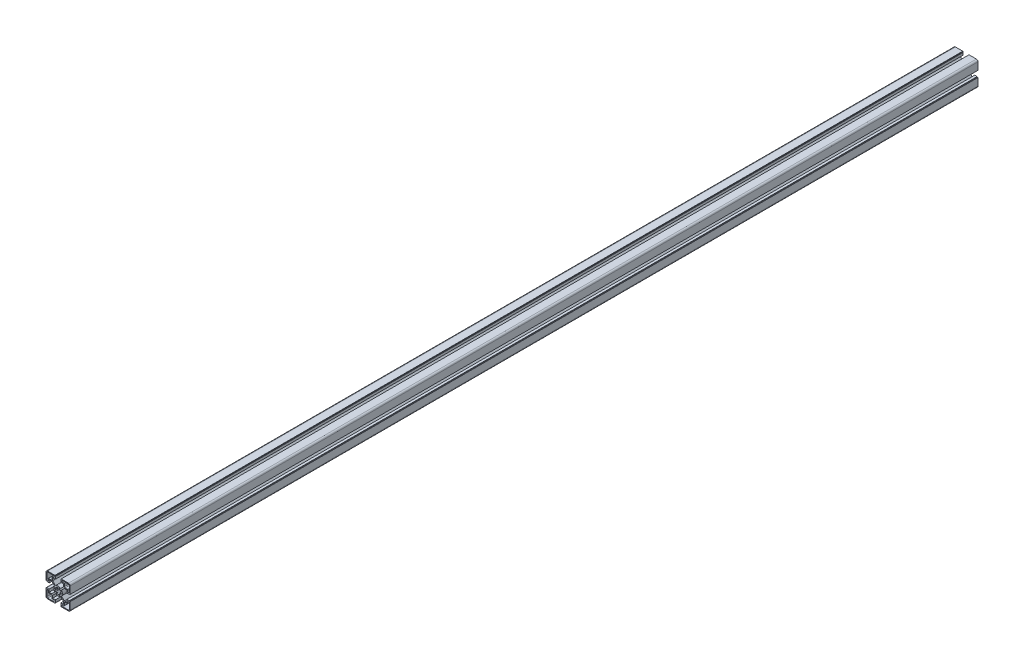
ISO-10303-21;
HEADER;
FILE_DESCRIPTION(('STEP AP214'),'2;1');
FILE_NAME('part.step','',(''),(''),'','','');
FILE_SCHEMA(('AUTOMOTIVE_DESIGN { 1 0 10303 214 1 1 1 1 }'));
ENDSEC;
DATA;
#1=APPLICATION_CONTEXT('core data for automotive mechanical design processes');
#2=APPLICATION_PROTOCOL_DEFINITION('international standard','automotive_design',2000,#1);
#3=PRODUCT_CONTEXT('',#1,'mechanical');
#4=PRODUCT('Part','Part','',(#3));
#5=PRODUCT_RELATED_PRODUCT_CATEGORY('part','',(#4));
#6=PRODUCT_DEFINITION_FORMATION('','',#4);
#7=PRODUCT_DEFINITION_CONTEXT('part definition',#1,'design');
#8=PRODUCT_DEFINITION('design','',#6,#7);
#9=PRODUCT_DEFINITION_SHAPE('','',#8);
#10=(LENGTH_UNIT() NAMED_UNIT(*) SI_UNIT(.MILLI.,.METRE.));
#11=(NAMED_UNIT(*) PLANE_ANGLE_UNIT() SI_UNIT($,.RADIAN.));
#12=(NAMED_UNIT(*) SI_UNIT($,.STERADIAN.) SOLID_ANGLE_UNIT());
#13=UNCERTAINTY_MEASURE_WITH_UNIT(LENGTH_MEASURE(1.E-05),#10,'distance_accuracy_value','');
#14=(GEOMETRIC_REPRESENTATION_CONTEXT(3) GLOBAL_UNCERTAINTY_ASSIGNED_CONTEXT((#13)) GLOBAL_UNIT_ASSIGNED_CONTEXT((#10,
#11,#12)) REPRESENTATION_CONTEXT('',''));
#15=CARTESIAN_POINT('',(0.,0.,0.));
#16=DIRECTION('',(0.,0.,1.));
#17=DIRECTION('',(1.,0.,0.));
#18=AXIS2_PLACEMENT_3D('',#15,#16,#17);
#19=CARTESIAN_POINT('',(3.3867561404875,5.06863875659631,1755.19045538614));
#20=DIRECTION('',(-0.831469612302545,0.555570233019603,0.));
#21=DIRECTION('',(-0.555570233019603,-0.831469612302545,0.));
#22=AXIS2_PLACEMENT_3D('',#19,#20,#21);
#23=PLANE('',#22);
#24=DIRECTION('',(0.,0.,-1.));
#25=VECTOR('',#24,1.);
#26=CARTESIAN_POINT('',(2.77996233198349,4.16050764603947,1755.19045538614));
#27=LINE('',#26,#25);
#28=CARTESIAN_POINT('',(2.77996233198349,4.16050764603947,1691.53840000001));
#29=VERTEX_POINT('',#28);
#30=CARTESIAN_POINT('',(2.77996233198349,4.16050764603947,0.));
#31=VERTEX_POINT('',#30);
#32=EDGE_CURVE('E1055',#29,#31,#27,.T.);
#33=ORIENTED_EDGE('',*,*,#32,.F.);
#34=DIRECTION('',(0.555570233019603,0.831469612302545,0.));
#35=VECTOR('',#34,1.);
#36=CARTESIAN_POINT('',(3.38675614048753,5.06863875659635,1691.53840000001));
#37=LINE('',#36,#35);
#38=CARTESIAN_POINT('',(3.3867561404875,5.06863875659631,1691.53840000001));
#39=VERTEX_POINT('',#38);
#40=EDGE_CURVE('E1985',#29,#39,#37,.T.);
#41=ORIENTED_EDGE('',*,*,#40,.T.);
#42=DIRECTION('',(0.,0.,-1.));
#43=VECTOR('',#42,1.);
#44=CARTESIAN_POINT('',(3.3867561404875,5.06863875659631,1755.19045538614));
#45=LINE('',#44,#43);
#46=CARTESIAN_POINT('',(3.3867561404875,5.06863875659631,0.));
#47=VERTEX_POINT('',#46);
#48=EDGE_CURVE('E1053',#39,#47,#45,.T.);
#49=ORIENTED_EDGE('',*,*,#48,.T.);
#50=DIRECTION('',(0.555570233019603,0.831469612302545,0.));
#51=VECTOR('',#50,1.);
#52=CARTESIAN_POINT('',(3.3867561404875,5.06863875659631,0.));
#53=LINE('',#52,#51);
#54=EDGE_CURVE('E1050',#31,#47,#53,.T.);
#55=ORIENTED_EDGE('',*,*,#54,.F.);
#56=EDGE_LOOP('',(#33,#41,#49,#55));
#57=FACE_BOUND('',#56,.T.);
#58=ADVANCED_FACE('F33',(#57),#23,.T.);
#59=CARTESIAN_POINT('',(0.,0.,1755.19045538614));
#60=DIRECTION('',(0.,0.,-1.));
#61=DIRECTION('',(-1.,0.,0.));
#62=AXIS2_PLACEMENT_3D('',#59,#60,#61);
#63=CYLINDRICAL_SURFACE('',#62,5.00379999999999);
#64=DIRECTION('',(0.,0.,-1.));
#65=VECTOR('',#64,1.);
#66=CARTESIAN_POINT('',(4.16050764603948,2.77996233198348,1755.19045538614));
#67=LINE('',#66,#65);
#68=CARTESIAN_POINT('',(4.16050764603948,2.77996233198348,1691.53840000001));
#69=VERTEX_POINT('',#68);
#70=CARTESIAN_POINT('',(4.16050764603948,2.77996233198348,0.));
#71=VERTEX_POINT('',#70);
#72=EDGE_CURVE('E1057',#69,#71,#67,.T.);
#73=ORIENTED_EDGE('',*,*,#72,.F.);
#74=CARTESIAN_POINT('',(0.,0.,1691.53840000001));
#75=DIRECTION('',(0.,0.,1.));
#76=DIRECTION('',(1.,0.,0.));
#77=AXIS2_PLACEMENT_3D('',#74,#75,#76);
#78=CIRCLE('',#77,5.00379999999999);
#79=EDGE_CURVE('E1988',#69,#29,#78,.T.);
#80=ORIENTED_EDGE('',*,*,#79,.T.);
#81=ORIENTED_EDGE('',*,*,#32,.T.);
#82=CARTESIAN_POINT('',(0.,0.,0.));
#83=DIRECTION('',(0.,0.,1.));
#84=DIRECTION('',(1.,0.,0.));
#85=AXIS2_PLACEMENT_3D('',#82,#83,#84);
#86=CIRCLE('',#85,5.00379999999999);
#87=EDGE_CURVE('E1047',#71,#31,#86,.T.);
#88=ORIENTED_EDGE('',*,*,#87,.F.);
#89=EDGE_LOOP('',(#73,#80,#81,#88));
#90=FACE_BOUND('',#89,.T.);
#91=ADVANCED_FACE('F2386',(#90),#63,.F.);
#92=CARTESIAN_POINT('',(5.06863875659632,3.38675614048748,1755.19045538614));
#93=DIRECTION('',(0.5555702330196,-0.831469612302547,0.));
#94=DIRECTION('',(0.831469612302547,0.5555702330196,0.));
#95=AXIS2_PLACEMENT_3D('',#92,#93,#94);
#96=PLANE('',#95);
#97=DIRECTION('',(0.,0.,-1.));
#98=VECTOR('',#97,1.);
#99=CARTESIAN_POINT('',(5.06863875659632,3.38675614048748,1755.19045538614));
#100=LINE('',#99,#98);
#101=CARTESIAN_POINT('',(5.06863875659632,3.38675614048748,1691.53840000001));
#102=VERTEX_POINT('',#101);
#103=CARTESIAN_POINT('',(5.06863875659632,3.38675614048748,0.));
#104=VERTEX_POINT('',#103);
#105=EDGE_CURVE('E1059',#102,#104,#100,.T.);
#106=ORIENTED_EDGE('',*,*,#105,.F.);
#107=DIRECTION('',(-0.831469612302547,-0.5555702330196,0.));
#108=VECTOR('',#107,1.);
#109=CARTESIAN_POINT('',(5.06863875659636,3.38675614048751,1691.53840000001));
#110=LINE('',#109,#108);
#111=EDGE_CURVE('E1991',#102,#69,#110,.T.);
#112=ORIENTED_EDGE('',*,*,#111,.T.);
#113=ORIENTED_EDGE('',*,*,#72,.T.);
#114=DIRECTION('',(-0.831469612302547,-0.5555702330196,0.));
#115=VECTOR('',#114,1.);
#116=CARTESIAN_POINT('',(5.06863875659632,3.38675614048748,0.));
#117=LINE('',#116,#115);
#118=EDGE_CURVE('E1044',#104,#71,#117,.T.);
#119=ORIENTED_EDGE('',*,*,#118,.F.);
#120=EDGE_LOOP('',(#106,#112,#113,#119));
#121=FACE_BOUND('',#120,.T.);
#122=ADVANCED_FACE('F2382',(#121),#96,.T.);
#123=CARTESIAN_POINT('',(0.,0.,1755.19045538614));
#124=DIRECTION('',(0.,0.,-1.));
#125=DIRECTION('',(-1.,0.,0.));
#126=AXIS2_PLACEMENT_3D('',#123,#124,#125);
#127=CYLINDRICAL_SURFACE('',#126,6.09599999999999);
#128=DIRECTION('',(0.,0.,-1.));
#129=VECTOR('',#128,1.);
#130=CARTESIAN_POINT('',(5.9788670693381,1.1892706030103,1755.19045538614));
#131=LINE('',#130,#129);
#132=CARTESIAN_POINT('',(5.9788670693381,1.1892706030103,1691.53840000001));
#133=VERTEX_POINT('',#132);
#134=CARTESIAN_POINT('',(5.9788670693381,1.1892706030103,0.));
#135=VERTEX_POINT('',#134);
#136=EDGE_CURVE('E1061',#133,#135,#131,.T.);
#137=ORIENTED_EDGE('',*,*,#136,.F.);
#138=CARTESIAN_POINT('',(0.,0.,1691.53840000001));
#139=DIRECTION('',(0.,0.,1.));
#140=DIRECTION('',(1.,0.,0.));
#141=AXIS2_PLACEMENT_3D('',#138,#139,#140);
#142=CIRCLE('',#141,6.09599999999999);
#143=EDGE_CURVE('E1994',#133,#102,#142,.T.);
#144=ORIENTED_EDGE('',*,*,#143,.T.);
#145=ORIENTED_EDGE('',*,*,#105,.T.);
#146=CARTESIAN_POINT('',(0.,0.,0.));
#147=DIRECTION('',(0.,0.,1.));
#148=DIRECTION('',(1.,0.,0.));
#149=AXIS2_PLACEMENT_3D('',#146,#147,#148);
#150=CIRCLE('',#149,6.09599999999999);
#151=EDGE_CURVE('E1041',#135,#104,#150,.T.);
#152=ORIENTED_EDGE('',*,*,#151,.F.);
#153=EDGE_LOOP('',(#137,#144,#145,#152));
#154=FACE_BOUND('',#153,.T.);
#155=ADVANCED_FACE('F2378',(#154),#127,.F.);
#156=CARTESIAN_POINT('',(5.9788670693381,1.1892706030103,1755.19045538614));
#157=DIRECTION('',(-0.195090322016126,0.980785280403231,0.));
#158=DIRECTION('',(-0.980785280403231,-0.195090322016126,0.));
#159=AXIS2_PLACEMENT_3D('',#156,#157,#158);
#160=PLANE('',#159);
#161=DIRECTION('',(0.,0.,-1.));
#162=VECTOR('',#161,1.);
#163=CARTESIAN_POINT('',(4.90765338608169,0.976192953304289,1755.19045538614));
#164=LINE('',#163,#162);
#165=CARTESIAN_POINT('',(4.90765338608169,0.976192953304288,1691.53840000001));
#166=VERTEX_POINT('',#165);
#167=CARTESIAN_POINT('',(4.90765338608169,0.976192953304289,0.));
#168=VERTEX_POINT('',#167);
#169=EDGE_CURVE('E1063',#166,#168,#164,.T.);
#170=ORIENTED_EDGE('',*,*,#169,.F.);
#171=DIRECTION('',(0.980785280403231,0.195090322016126,0.));
#172=VECTOR('',#171,1.);
#173=CARTESIAN_POINT('',(5.97886706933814,1.18927060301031,1691.53840000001));
#174=LINE('',#173,#172);
#175=EDGE_CURVE('E1997',#166,#133,#174,.T.);
#176=ORIENTED_EDGE('',*,*,#175,.T.);
#177=ORIENTED_EDGE('',*,*,#136,.T.);
#178=DIRECTION('',(0.980785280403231,0.195090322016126,0.));
#179=VECTOR('',#178,1.);
#180=CARTESIAN_POINT('',(5.9788670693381,1.1892706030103,0.));
#181=LINE('',#180,#179);
#182=EDGE_CURVE('E1038',#168,#135,#181,.T.);
#183=ORIENTED_EDGE('',*,*,#182,.F.);
#184=EDGE_LOOP('',(#170,#176,#177,#183));
#185=FACE_BOUND('',#184,.T.);
#186=ADVANCED_FACE('F2375',(#185),#160,.T.);
#187=CARTESIAN_POINT('',(0.,0.,1755.19045538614));
#188=DIRECTION('',(0.,0.,-1.));
#189=DIRECTION('',(-1.,0.,0.));
#190=AXIS2_PLACEMENT_3D('',#187,#188,#189);
#191=CYLINDRICAL_SURFACE('',#190,5.00379999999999);
#192=DIRECTION('',(0.,0.,-1.));
#193=VECTOR('',#192,1.);
#194=CARTESIAN_POINT('',(4.90765338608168,-0.97619295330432,1755.19045538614));
#195=LINE('',#194,#193);
#196=CARTESIAN_POINT('',(4.90765338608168,-0.976192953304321,1691.53840000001));
#197=VERTEX_POINT('',#196);
#198=CARTESIAN_POINT('',(4.90765338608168,-0.97619295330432,0.));
#199=VERTEX_POINT('',#198);
#200=EDGE_CURVE('E1065',#197,#199,#195,.T.);
#201=ORIENTED_EDGE('',*,*,#200,.F.);
#202=CARTESIAN_POINT('',(0.,0.,1691.53840000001));
#203=DIRECTION('',(0.,0.,1.));
#204=DIRECTION('',(1.,0.,0.));
#205=AXIS2_PLACEMENT_3D('',#202,#203,#204);
#206=CIRCLE('',#205,5.00379999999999);
#207=EDGE_CURVE('E2000',#197,#166,#206,.T.);
#208=ORIENTED_EDGE('',*,*,#207,.T.);
#209=ORIENTED_EDGE('',*,*,#169,.T.);
#210=CARTESIAN_POINT('',(0.,0.,0.));
#211=DIRECTION('',(0.,0.,1.));
#212=DIRECTION('',(1.,0.,0.));
#213=AXIS2_PLACEMENT_3D('',#210,#211,#212);
#214=CIRCLE('',#213,5.00379999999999);
#215=EDGE_CURVE('E1035',#199,#168,#214,.T.);
#216=ORIENTED_EDGE('',*,*,#215,.F.);
#217=EDGE_LOOP('',(#201,#208,#209,#216));
#218=FACE_BOUND('',#217,.T.);
#219=ADVANCED_FACE('F2370',(#218),#191,.F.);
#220=CARTESIAN_POINT('',(5.97886706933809,-1.18927060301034,1755.19045538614));
#221=DIRECTION('',(-0.195090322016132,-0.98078528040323,0.));
#222=DIRECTION('',(0.98078528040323,-0.195090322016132,0.));
#223=AXIS2_PLACEMENT_3D('',#220,#221,#222);
#224=PLANE('',#223);
#225=DIRECTION('',(0.,0.,-1.));
#226=VECTOR('',#225,1.);
#227=CARTESIAN_POINT('',(5.97886706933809,-1.18927060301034,1755.19045538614));
#228=LINE('',#227,#226);
#229=CARTESIAN_POINT('',(5.97886706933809,-1.18927060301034,1691.53840000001));
#230=VERTEX_POINT('',#229);
#231=CARTESIAN_POINT('',(5.97886706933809,-1.18927060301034,0.));
#232=VERTEX_POINT('',#231);
#233=EDGE_CURVE('E1067',#230,#232,#228,.T.);
#234=ORIENTED_EDGE('',*,*,#233,.F.);
#235=DIRECTION('',(-0.98078528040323,0.195090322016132,0.));
#236=VECTOR('',#235,1.);
#237=CARTESIAN_POINT('',(5.97886706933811,-1.18927060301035,1691.53840000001));
#238=LINE('',#237,#236);
#239=EDGE_CURVE('E2003',#230,#197,#238,.T.);
#240=ORIENTED_EDGE('',*,*,#239,.T.);
#241=ORIENTED_EDGE('',*,*,#200,.T.);
#242=DIRECTION('',(-0.98078528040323,0.195090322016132,0.));
#243=VECTOR('',#242,1.);
#244=CARTESIAN_POINT('',(5.97886706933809,-1.18927060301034,0.));
#245=LINE('',#244,#243);
#246=EDGE_CURVE('E1032',#232,#199,#245,.T.);
#247=ORIENTED_EDGE('',*,*,#246,.F.);
#248=EDGE_LOOP('',(#234,#240,#241,#247));
#249=FACE_BOUND('',#248,.T.);
#250=ADVANCED_FACE('F2366',(#249),#224,.T.);
#251=CARTESIAN_POINT('',(0.,0.,1755.19045538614));
#252=DIRECTION('',(0.,0.,-1.));
#253=DIRECTION('',(-1.,0.,0.));
#254=AXIS2_PLACEMENT_3D('',#251,#252,#253);
#255=CYLINDRICAL_SURFACE('',#254,6.09599999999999);
#256=DIRECTION('',(0.,0.,-1.));
#257=VECTOR('',#256,1.);
#258=CARTESIAN_POINT('',(5.0686387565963,-3.38675614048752,1755.19045538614));
#259=LINE('',#258,#257);
#260=CARTESIAN_POINT('',(5.0686387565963,-3.38675614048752,1691.53840000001));
#261=VERTEX_POINT('',#260);
#262=CARTESIAN_POINT('',(5.0686387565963,-3.38675614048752,0.));
#263=VERTEX_POINT('',#262);
#264=EDGE_CURVE('E1069',#261,#263,#259,.T.);
#265=ORIENTED_EDGE('',*,*,#264,.F.);
#266=CARTESIAN_POINT('',(0.,0.,1691.53840000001));
#267=DIRECTION('',(0.,0.,1.));
#268=DIRECTION('',(1.,0.,0.));
#269=AXIS2_PLACEMENT_3D('',#266,#267,#268);
#270=CIRCLE('',#269,6.09599999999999);
#271=EDGE_CURVE('E2006',#261,#230,#270,.T.);
#272=ORIENTED_EDGE('',*,*,#271,.T.);
#273=ORIENTED_EDGE('',*,*,#233,.T.);
#274=CARTESIAN_POINT('',(0.,0.,0.));
#275=DIRECTION('',(0.,0.,1.));
#276=DIRECTION('',(1.,0.,0.));
#277=AXIS2_PLACEMENT_3D('',#274,#275,#276);
#278=CIRCLE('',#277,6.09599999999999);
#279=EDGE_CURVE('E1029',#263,#232,#278,.T.);
#280=ORIENTED_EDGE('',*,*,#279,.F.);
#281=EDGE_LOOP('',(#265,#272,#273,#280));
#282=FACE_BOUND('',#281,.T.);
#283=ADVANCED_FACE('F2363',(#282),#255,.F.);
#284=CARTESIAN_POINT('',(5.0686387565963,-3.38675614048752,1755.19045538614));
#285=DIRECTION('',(0.555570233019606,0.831469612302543,0.));
#286=DIRECTION('',(-0.831469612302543,0.555570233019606,0.));
#287=AXIS2_PLACEMENT_3D('',#284,#285,#286);
#288=PLANE('',#287);
#289=DIRECTION('',(0.,0.,-1.));
#290=VECTOR('',#289,1.);
#291=CARTESIAN_POINT('',(4.16050764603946,-2.7799623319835,1755.19045538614));
#292=LINE('',#291,#290);
#293=CARTESIAN_POINT('',(4.16050764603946,-2.7799623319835,1691.53840000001));
#294=VERTEX_POINT('',#293);
#295=CARTESIAN_POINT('',(4.16050764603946,-2.7799623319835,0.));
#296=VERTEX_POINT('',#295);
#297=EDGE_CURVE('E1071',#294,#296,#292,.T.);
#298=ORIENTED_EDGE('',*,*,#297,.F.);
#299=DIRECTION('',(0.831469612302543,-0.555570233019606,0.));
#300=VECTOR('',#299,1.);
#301=CARTESIAN_POINT('',(5.06863875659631,-3.38675614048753,1691.53840000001));
#302=LINE('',#301,#300);
#303=EDGE_CURVE('E2009',#294,#261,#302,.T.);
#304=ORIENTED_EDGE('',*,*,#303,.T.);
#305=ORIENTED_EDGE('',*,*,#264,.T.);
#306=DIRECTION('',(0.831469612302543,-0.555570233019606,0.));
#307=VECTOR('',#306,1.);
#308=CARTESIAN_POINT('',(5.0686387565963,-3.38675614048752,0.));
#309=LINE('',#308,#307);
#310=EDGE_CURVE('E1026',#296,#263,#309,.T.);
#311=ORIENTED_EDGE('',*,*,#310,.F.);
#312=EDGE_LOOP('',(#298,#304,#305,#311));
#313=FACE_BOUND('',#312,.T.);
#314=ADVANCED_FACE('F2358',(#313),#288,.T.);
#315=CARTESIAN_POINT('',(0.,0.,1755.19045538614));
#316=DIRECTION('',(0.,0.,-1.));
#317=DIRECTION('',(-1.,0.,0.));
#318=AXIS2_PLACEMENT_3D('',#315,#316,#317);
#319=CYLINDRICAL_SURFACE('',#318,5.00379999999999);
#320=DIRECTION('',(0.,0.,-1.));
#321=VECTOR('',#320,1.);
#322=CARTESIAN_POINT('',(2.77996233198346,-4.16050764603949,1755.19045538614));
#323=LINE('',#322,#321);
#324=CARTESIAN_POINT('',(2.77996233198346,-4.16050764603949,1691.53840000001));
#325=VERTEX_POINT('',#324);
#326=CARTESIAN_POINT('',(2.77996233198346,-4.16050764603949,0.));
#327=VERTEX_POINT('',#326);
#328=EDGE_CURVE('E1073',#325,#327,#323,.T.);
#329=ORIENTED_EDGE('',*,*,#328,.F.);
#330=CARTESIAN_POINT('',(0.,0.,1691.53840000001));
#331=DIRECTION('',(0.,0.,1.));
#332=DIRECTION('',(1.,0.,0.));
#333=AXIS2_PLACEMENT_3D('',#330,#331,#332);
#334=CIRCLE('',#333,5.00379999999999);
#335=EDGE_CURVE('E2012',#325,#294,#334,.T.);
#336=ORIENTED_EDGE('',*,*,#335,.T.);
#337=ORIENTED_EDGE('',*,*,#297,.T.);
#338=CARTESIAN_POINT('',(0.,0.,0.));
#339=DIRECTION('',(0.,0.,1.));
#340=DIRECTION('',(1.,0.,0.));
#341=AXIS2_PLACEMENT_3D('',#338,#339,#340);
#342=CIRCLE('',#341,5.00379999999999);
#343=EDGE_CURVE('E1023',#327,#296,#342,.T.);
#344=ORIENTED_EDGE('',*,*,#343,.F.);
#345=EDGE_LOOP('',(#329,#336,#337,#344));
#346=FACE_BOUND('',#345,.T.);
#347=ADVANCED_FACE('F2354',(#346),#319,.F.);
#348=CARTESIAN_POINT('',(3.38675614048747,-5.06863875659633,1755.19045538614));
#349=DIRECTION('',(-0.831469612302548,-0.555570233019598,0.));
#350=DIRECTION('',(0.555570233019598,-0.831469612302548,0.));
#351=AXIS2_PLACEMENT_3D('',#348,#349,#350);
#352=PLANE('',#351);
#353=DIRECTION('',(0.,0.,-1.));
#354=VECTOR('',#353,1.);
#355=CARTESIAN_POINT('',(3.38675614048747,-5.06863875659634,1755.19045538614));
#356=LINE('',#355,#354);
#357=CARTESIAN_POINT('',(3.38675614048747,-5.06863875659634,1691.53840000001));
#358=VERTEX_POINT('',#357);
#359=CARTESIAN_POINT('',(3.38675614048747,-5.06863875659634,0.));
#360=VERTEX_POINT('',#359);
#361=EDGE_CURVE('E1075',#358,#360,#356,.T.);
#362=ORIENTED_EDGE('',*,*,#361,.F.);
#363=DIRECTION('',(-0.555570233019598,0.831469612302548,0.));
#364=VECTOR('',#363,1.);
#365=CARTESIAN_POINT('',(3.38675614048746,-5.06863875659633,1691.53840000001));
#366=LINE('',#365,#364);
#367=EDGE_CURVE('E2015',#358,#325,#366,.T.);
#368=ORIENTED_EDGE('',*,*,#367,.T.);
#369=ORIENTED_EDGE('',*,*,#328,.T.);
#370=DIRECTION('',(-0.555570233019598,0.831469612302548,0.));
#371=VECTOR('',#370,1.);
#372=CARTESIAN_POINT('',(3.38675614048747,-5.06863875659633,0.));
#373=LINE('',#372,#371);
#374=EDGE_CURVE('E1020',#360,#327,#373,.T.);
#375=ORIENTED_EDGE('',*,*,#374,.F.);
#376=EDGE_LOOP('',(#362,#368,#369,#375));
#377=FACE_BOUND('',#376,.T.);
#378=ADVANCED_FACE('F2351',(#377),#352,.T.);
#379=CARTESIAN_POINT('',(0.,0.,1755.19045538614));
#380=DIRECTION('',(0.,0.,-1.));
#381=DIRECTION('',(-1.,0.,0.));
#382=AXIS2_PLACEMENT_3D('',#379,#380,#381);
#383=CYLINDRICAL_SURFACE('',#382,6.096);
#384=DIRECTION('',(0.,0.,-1.));
#385=VECTOR('',#384,1.);
#386=CARTESIAN_POINT('',(1.18927060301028,-5.9788670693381,1755.19045538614));
#387=LINE('',#386,#385);
#388=CARTESIAN_POINT('',(1.18927060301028,-5.9788670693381,1691.53840000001));
#389=VERTEX_POINT('',#388);
#390=CARTESIAN_POINT('',(1.18927060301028,-5.9788670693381,0.));
#391=VERTEX_POINT('',#390);
#392=EDGE_CURVE('E1077',#389,#391,#387,.T.);
#393=ORIENTED_EDGE('',*,*,#392,.F.);
#394=CARTESIAN_POINT('',(0.,0.,1691.53840000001));
#395=DIRECTION('',(0.,0.,1.));
#396=DIRECTION('',(1.,0.,0.));
#397=AXIS2_PLACEMENT_3D('',#394,#395,#396);
#398=CIRCLE('',#397,6.096);
#399=EDGE_CURVE('E2018',#389,#358,#398,.T.);
#400=ORIENTED_EDGE('',*,*,#399,.T.);
#401=ORIENTED_EDGE('',*,*,#361,.T.);
#402=CARTESIAN_POINT('',(0.,0.,0.));
#403=DIRECTION('',(0.,0.,1.));
#404=DIRECTION('',(1.,0.,0.));
#405=AXIS2_PLACEMENT_3D('',#402,#403,#404);
#406=CIRCLE('',#405,6.096);
#407=EDGE_CURVE('E1017',#391,#360,#406,.T.);
#408=ORIENTED_EDGE('',*,*,#407,.F.);
#409=EDGE_LOOP('',(#393,#400,#401,#408));
#410=FACE_BOUND('',#409,.T.);
#411=ADVANCED_FACE('F2346',(#410),#383,.F.);
#412=CARTESIAN_POINT('',(1.18927060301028,-5.9788670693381,1755.19045538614));
#413=DIRECTION('',(0.980785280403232,0.195090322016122,0.));
#414=DIRECTION('',(-0.195090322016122,0.980785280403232,0.));
#415=AXIS2_PLACEMENT_3D('',#412,#413,#414);
#416=PLANE('',#415);
#417=DIRECTION('',(0.,0.,-1.));
#418=VECTOR('',#417,1.);
#419=CARTESIAN_POINT('',(0.97619295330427,-4.90765338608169,1755.19045538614));
#420=LINE('',#419,#418);
#421=CARTESIAN_POINT('',(0.976192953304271,-4.90765338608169,1691.53840000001));
#422=VERTEX_POINT('',#421);
#423=CARTESIAN_POINT('',(0.97619295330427,-4.90765338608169,0.));
#424=VERTEX_POINT('',#423);
#425=EDGE_CURVE('E1079',#422,#424,#420,.T.);
#426=ORIENTED_EDGE('',*,*,#425,.F.);
#427=DIRECTION('',(0.195090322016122,-0.980785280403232,0.));
#428=VECTOR('',#427,1.);
#429=CARTESIAN_POINT('',(1.18927060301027,-5.97886706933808,1691.53840000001));
#430=LINE('',#429,#428);
#431=EDGE_CURVE('E2021',#422,#389,#430,.T.);
#432=ORIENTED_EDGE('',*,*,#431,.T.);
#433=ORIENTED_EDGE('',*,*,#392,.T.);
#434=DIRECTION('',(0.195090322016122,-0.980785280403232,0.));
#435=VECTOR('',#434,1.);
#436=CARTESIAN_POINT('',(1.18927060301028,-5.9788670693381,0.));
#437=LINE('',#436,#435);
#438=EDGE_CURVE('E1014',#424,#391,#437,.T.);
#439=ORIENTED_EDGE('',*,*,#438,.F.);
#440=EDGE_LOOP('',(#426,#432,#433,#439));
#441=FACE_BOUND('',#440,.T.);
#442=ADVANCED_FACE('F2342',(#441),#416,.T.);
#443=CARTESIAN_POINT('',(0.,0.,1755.19045538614));
#444=DIRECTION('',(0.,0.,-1.));
#445=DIRECTION('',(-1.,0.,0.));
#446=AXIS2_PLACEMENT_3D('',#443,#444,#445);
#447=CYLINDRICAL_SURFACE('',#446,5.0038);
#448=DIRECTION('',(0.,0.,-1.));
#449=VECTOR('',#448,1.);
#450=CARTESIAN_POINT('',(-0.976192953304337,-4.90765338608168,1755.19045538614));
#451=LINE('',#450,#449);
#452=CARTESIAN_POINT('',(-0.976192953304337,-4.90765338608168,1691.53840000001));
#453=VERTEX_POINT('',#452);
#454=CARTESIAN_POINT('',(-0.976192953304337,-4.90765338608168,0.));
#455=VERTEX_POINT('',#454);
#456=EDGE_CURVE('E1081',#453,#455,#451,.T.);
#457=ORIENTED_EDGE('',*,*,#456,.F.);
#458=CARTESIAN_POINT('',(0.,0.,1691.53840000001));
#459=DIRECTION('',(0.,0.,1.));
#460=DIRECTION('',(1.,0.,0.));
#461=AXIS2_PLACEMENT_3D('',#458,#459,#460);
#462=CIRCLE('',#461,5.0038);
#463=EDGE_CURVE('E2024',#453,#422,#462,.T.);
#464=ORIENTED_EDGE('',*,*,#463,.T.);
#465=ORIENTED_EDGE('',*,*,#425,.T.);
#466=CARTESIAN_POINT('',(0.,0.,0.));
#467=DIRECTION('',(0.,0.,1.));
#468=DIRECTION('',(1.,0.,0.));
#469=AXIS2_PLACEMENT_3D('',#466,#467,#468);
#470=CIRCLE('',#469,5.0038);
#471=EDGE_CURVE('E1011',#455,#424,#470,.T.);
#472=ORIENTED_EDGE('',*,*,#471,.F.);
#473=EDGE_LOOP('',(#457,#464,#465,#472));
#474=FACE_BOUND('',#473,.T.);
#475=ADVANCED_FACE('F2339',(#474),#447,.F.);
#476=CARTESIAN_POINT('',(-1.18927060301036,-5.97886706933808,1755.19045538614));
#477=DIRECTION('',(-0.980785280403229,0.195090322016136,0.));
#478=DIRECTION('',(-0.195090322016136,-0.980785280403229,0.));
#479=AXIS2_PLACEMENT_3D('',#476,#477,#478);
#480=PLANE('',#479);
#481=DIRECTION('',(0.,0.,-1.));
#482=VECTOR('',#481,1.);
#483=CARTESIAN_POINT('',(-1.18927060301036,-5.97886706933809,1755.19045538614));
#484=LINE('',#483,#482);
#485=CARTESIAN_POINT('',(-1.18927060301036,-5.97886706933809,1691.53840000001));
#486=VERTEX_POINT('',#485);
#487=CARTESIAN_POINT('',(-1.18927060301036,-5.97886706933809,0.));
#488=VERTEX_POINT('',#487);
#489=EDGE_CURVE('E1083',#486,#488,#484,.T.);
#490=ORIENTED_EDGE('',*,*,#489,.F.);
#491=DIRECTION('',(0.195090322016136,0.980785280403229,0.));
#492=VECTOR('',#491,1.);
#493=CARTESIAN_POINT('',(-1.18927060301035,-5.97886706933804,1691.53840000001));
#494=LINE('',#493,#492);
#495=EDGE_CURVE('E2027',#486,#453,#494,.T.);
#496=ORIENTED_EDGE('',*,*,#495,.T.);
#497=ORIENTED_EDGE('',*,*,#456,.T.);
#498=DIRECTION('',(0.195090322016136,0.980785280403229,0.));
#499=VECTOR('',#498,1.);
#500=CARTESIAN_POINT('',(-1.18927060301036,-5.97886706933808,0.));
#501=LINE('',#500,#499);
#502=EDGE_CURVE('E1008',#488,#455,#501,.T.);
#503=ORIENTED_EDGE('',*,*,#502,.F.);
#504=EDGE_LOOP('',(#490,#496,#497,#503));
#505=FACE_BOUND('',#504,.T.);
#506=ADVANCED_FACE('F2334',(#505),#480,.T.);
#507=CARTESIAN_POINT('',(0.,0.,1755.19045538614));
#508=DIRECTION('',(0.,0.,-1.));
#509=DIRECTION('',(-1.,0.,0.));
#510=AXIS2_PLACEMENT_3D('',#507,#508,#509);
#511=CYLINDRICAL_SURFACE('',#510,6.096);
#512=DIRECTION('',(0.,0.,-1.));
#513=VECTOR('',#512,1.);
#514=CARTESIAN_POINT('',(-3.38675614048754,-5.06863875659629,1755.19045538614));
#515=LINE('',#514,#513);
#516=CARTESIAN_POINT('',(-3.38675614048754,-5.06863875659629,1691.53840000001));
#517=VERTEX_POINT('',#516);
#518=CARTESIAN_POINT('',(-3.38675614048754,-5.06863875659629,0.));
#519=VERTEX_POINT('',#518);
#520=EDGE_CURVE('E1085',#517,#519,#515,.T.);
#521=ORIENTED_EDGE('',*,*,#520,.F.);
#522=CARTESIAN_POINT('',(0.,0.,1691.53840000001));
#523=DIRECTION('',(0.,0.,1.));
#524=DIRECTION('',(1.,0.,0.));
#525=AXIS2_PLACEMENT_3D('',#522,#523,#524);
#526=CIRCLE('',#525,6.096);
#527=EDGE_CURVE('E2030',#517,#486,#526,.T.);
#528=ORIENTED_EDGE('',*,*,#527,.T.);
#529=ORIENTED_EDGE('',*,*,#489,.T.);
#530=CARTESIAN_POINT('',(0.,0.,0.));
#531=DIRECTION('',(0.,0.,1.));
#532=DIRECTION('',(1.,0.,0.));
#533=AXIS2_PLACEMENT_3D('',#530,#531,#532);
#534=CIRCLE('',#533,6.096);
#535=EDGE_CURVE('E1005',#519,#488,#534,.T.);
#536=ORIENTED_EDGE('',*,*,#535,.F.);
#537=EDGE_LOOP('',(#521,#528,#529,#536));
#538=FACE_BOUND('',#537,.T.);
#539=ADVANCED_FACE('F2330',(#538),#511,.F.);
#540=CARTESIAN_POINT('',(-3.38675614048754,-5.06863875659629,1755.19045538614));
#541=DIRECTION('',(0.831469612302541,-0.555570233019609,0.));
#542=DIRECTION('',(0.555570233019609,0.831469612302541,0.));
#543=AXIS2_PLACEMENT_3D('',#540,#541,#542);
#544=PLANE('',#543);
#545=DIRECTION('',(0.,0.,-1.));
#546=VECTOR('',#545,1.);
#547=CARTESIAN_POINT('',(-2.77996233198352,-4.16050764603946,1755.19045538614));
#548=LINE('',#547,#546);
#549=CARTESIAN_POINT('',(-2.77996233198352,-4.16050764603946,1691.53840000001));
#550=VERTEX_POINT('',#549);
#551=CARTESIAN_POINT('',(-2.77996233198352,-4.16050764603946,0.));
#552=VERTEX_POINT('',#551);
#553=EDGE_CURVE('E1087',#550,#552,#548,.T.);
#554=ORIENTED_EDGE('',*,*,#553,.F.);
#555=DIRECTION('',(-0.555570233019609,-0.831469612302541,0.));
#556=VECTOR('',#555,1.);
#557=CARTESIAN_POINT('',(-3.38675614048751,-5.06863875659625,1691.53840000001));
#558=LINE('',#557,#556);
#559=EDGE_CURVE('E2033',#550,#517,#558,.T.);
#560=ORIENTED_EDGE('',*,*,#559,.T.);
#561=ORIENTED_EDGE('',*,*,#520,.T.);
#562=DIRECTION('',(-0.555570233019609,-0.831469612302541,0.));
#563=VECTOR('',#562,1.);
#564=CARTESIAN_POINT('',(-3.38675614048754,-5.06863875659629,0.));
#565=LINE('',#564,#563);
#566=EDGE_CURVE('E1002',#552,#519,#565,.T.);
#567=ORIENTED_EDGE('',*,*,#566,.F.);
#568=EDGE_LOOP('',(#554,#560,#561,#567));
#569=FACE_BOUND('',#568,.T.);
#570=ADVANCED_FACE('F2327',(#569),#544,.T.);
#571=CARTESIAN_POINT('',(0.,0.,1755.19045538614));
#572=DIRECTION('',(0.,0.,-1.));
#573=DIRECTION('',(-1.,0.,0.));
#574=AXIS2_PLACEMENT_3D('',#571,#572,#573);
#575=CYLINDRICAL_SURFACE('',#574,5.0038);
#576=DIRECTION('',(0.,0.,-1.));
#577=VECTOR('',#576,1.);
#578=CARTESIAN_POINT('',(-4.1605076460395,-2.77996233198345,1755.19045538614));
#579=LINE('',#578,#577);
#580=CARTESIAN_POINT('',(-4.1605076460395,-2.77996233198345,1691.53840000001));
#581=VERTEX_POINT('',#580);
#582=CARTESIAN_POINT('',(-4.1605076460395,-2.77996233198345,0.));
#583=VERTEX_POINT('',#582);
#584=EDGE_CURVE('E1089',#581,#583,#579,.T.);
#585=ORIENTED_EDGE('',*,*,#584,.F.);
#586=CARTESIAN_POINT('',(0.,0.,1691.53840000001));
#587=DIRECTION('',(0.,0.,1.));
#588=DIRECTION('',(1.,0.,0.));
#589=AXIS2_PLACEMENT_3D('',#586,#587,#588);
#590=CIRCLE('',#589,5.0038);
#591=EDGE_CURVE('E2036',#581,#550,#590,.T.);
#592=ORIENTED_EDGE('',*,*,#591,.T.);
#593=ORIENTED_EDGE('',*,*,#553,.T.);
#594=CARTESIAN_POINT('',(0.,0.,0.));
#595=DIRECTION('',(0.,0.,1.));
#596=DIRECTION('',(1.,0.,0.));
#597=AXIS2_PLACEMENT_3D('',#594,#595,#596);
#598=CIRCLE('',#597,5.0038);
#599=EDGE_CURVE('E999',#583,#552,#598,.T.);
#600=ORIENTED_EDGE('',*,*,#599,.F.);
#601=EDGE_LOOP('',(#585,#592,#593,#600));
#602=FACE_BOUND('',#601,.T.);
#603=ADVANCED_FACE('F2322',(#602),#575,.F.);
#604=CARTESIAN_POINT('',(-5.06863875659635,-3.38675614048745,1755.19045538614));
#605=DIRECTION('',(-0.555570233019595,0.83146961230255,0.));
#606=DIRECTION('',(-0.831469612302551,-0.555570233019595,0.));
#607=AXIS2_PLACEMENT_3D('',#604,#605,#606);
#608=PLANE('',#607);
#609=DIRECTION('',(0.,0.,-1.));
#610=VECTOR('',#609,1.);
#611=CARTESIAN_POINT('',(-5.06863875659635,-3.38675614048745,1755.19045538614));
#612=LINE('',#611,#610);
#613=CARTESIAN_POINT('',(-5.06863875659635,-3.38675614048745,1691.53840000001));
#614=VERTEX_POINT('',#613);
#615=CARTESIAN_POINT('',(-5.06863875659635,-3.38675614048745,0.));
#616=VERTEX_POINT('',#615);
#617=EDGE_CURVE('E1091',#614,#616,#612,.T.);
#618=ORIENTED_EDGE('',*,*,#617,.F.);
#619=DIRECTION('',(0.83146961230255,0.555570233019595,0.));
#620=VECTOR('',#619,1.);
#621=CARTESIAN_POINT('',(-5.06863875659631,-3.38675614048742,1691.53840000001));
#622=LINE('',#621,#620);
#623=EDGE_CURVE('E2039',#614,#581,#622,.T.);
#624=ORIENTED_EDGE('',*,*,#623,.T.);
#625=ORIENTED_EDGE('',*,*,#584,.T.);
#626=DIRECTION('',(0.83146961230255,0.555570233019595,0.));
#627=VECTOR('',#626,1.);
#628=CARTESIAN_POINT('',(-5.06863875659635,-3.38675614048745,0.));
#629=LINE('',#628,#627);
#630=EDGE_CURVE('E996',#616,#583,#629,.T.);
#631=ORIENTED_EDGE('',*,*,#630,.F.);
#632=EDGE_LOOP('',(#618,#624,#625,#631));
#633=FACE_BOUND('',#632,.T.);
#634=ADVANCED_FACE('F2318',(#633),#608,.T.);
#635=CARTESIAN_POINT('',(0.,0.,1755.19045538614));
#636=DIRECTION('',(0.,0.,-1.));
#637=DIRECTION('',(-1.,0.,0.));
#638=AXIS2_PLACEMENT_3D('',#635,#636,#637);
#639=CYLINDRICAL_SURFACE('',#638,6.09600000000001);
#640=DIRECTION('',(0.,0.,-1.));
#641=VECTOR('',#640,1.);
#642=CARTESIAN_POINT('',(-5.9788670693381,-1.18927060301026,1755.19045538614));
#643=LINE('',#642,#641);
#644=CARTESIAN_POINT('',(-5.9788670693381,-1.18927060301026,1691.53840000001));
#645=VERTEX_POINT('',#644);
#646=CARTESIAN_POINT('',(-5.9788670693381,-1.18927060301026,0.));
#647=VERTEX_POINT('',#646);
#648=EDGE_CURVE('E1093',#645,#647,#643,.T.);
#649=ORIENTED_EDGE('',*,*,#648,.F.);
#650=CARTESIAN_POINT('',(0.,0.,1691.53840000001));
#651=DIRECTION('',(0.,0.,1.));
#652=DIRECTION('',(1.,0.,0.));
#653=AXIS2_PLACEMENT_3D('',#650,#651,#652);
#654=CIRCLE('',#653,6.09600000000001);
#655=EDGE_CURVE('E2042',#645,#614,#654,.T.);
#656=ORIENTED_EDGE('',*,*,#655,.T.);
#657=ORIENTED_EDGE('',*,*,#617,.T.);
#658=CARTESIAN_POINT('',(0.,0.,0.));
#659=DIRECTION('',(0.,0.,1.));
#660=DIRECTION('',(1.,0.,0.));
#661=AXIS2_PLACEMENT_3D('',#658,#659,#660);
#662=CIRCLE('',#661,6.09600000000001);
#663=EDGE_CURVE('E993',#647,#616,#662,.T.);
#664=ORIENTED_EDGE('',*,*,#663,.F.);
#665=EDGE_LOOP('',(#649,#656,#657,#664));
#666=FACE_BOUND('',#665,.T.);
#667=ADVANCED_FACE('F2315',(#666),#639,.F.);
#668=CARTESIAN_POINT('',(-5.9788670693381,-1.18927060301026,1755.19045538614));
#669=DIRECTION('',(0.195090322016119,-0.980785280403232,0.));
#670=DIRECTION('',(0.980785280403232,0.195090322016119,0.));
#671=AXIS2_PLACEMENT_3D('',#668,#669,#670);
#672=PLANE('',#671);
#673=DIRECTION('',(0.,0.,-1.));
#674=VECTOR('',#673,1.);
#675=CARTESIAN_POINT('',(-4.9076533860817,-0.976192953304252,1755.19045538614));
#676=LINE('',#675,#674);
#677=CARTESIAN_POINT('',(-4.9076533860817,-0.976192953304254,1691.53840000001));
#678=VERTEX_POINT('',#677);
#679=CARTESIAN_POINT('',(-4.9076533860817,-0.976192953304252,0.));
#680=VERTEX_POINT('',#679);
#681=EDGE_CURVE('E1095',#678,#680,#676,.T.);
#682=ORIENTED_EDGE('',*,*,#681,.F.);
#683=DIRECTION('',(-0.980785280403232,-0.195090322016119,0.));
#684=VECTOR('',#683,1.);
#685=CARTESIAN_POINT('',(-5.97886706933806,-1.18927060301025,1691.53840000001));
#686=LINE('',#685,#684);
#687=EDGE_CURVE('E2045',#678,#645,#686,.T.);
#688=ORIENTED_EDGE('',*,*,#687,.T.);
#689=ORIENTED_EDGE('',*,*,#648,.T.);
#690=DIRECTION('',(-0.980785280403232,-0.195090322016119,0.));
#691=VECTOR('',#690,1.);
#692=CARTESIAN_POINT('',(-5.9788670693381,-1.18927060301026,0.));
#693=LINE('',#692,#691);
#694=EDGE_CURVE('E990',#680,#647,#693,.T.);
#695=ORIENTED_EDGE('',*,*,#694,.F.);
#696=EDGE_LOOP('',(#682,#688,#689,#695));
#697=FACE_BOUND('',#696,.T.);
#698=ADVANCED_FACE('F2310',(#697),#672,.T.);
#699=CARTESIAN_POINT('',(0.,0.,1755.19045538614));
#700=DIRECTION('',(0.,0.,-1.));
#701=DIRECTION('',(-1.,0.,0.));
#702=AXIS2_PLACEMENT_3D('',#699,#700,#701);
#703=CYLINDRICAL_SURFACE('',#702,5.00380000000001);
#704=DIRECTION('',(0.,0.,-1.));
#705=VECTOR('',#704,1.);
#706=CARTESIAN_POINT('',(-4.90765338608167,0.976192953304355,1755.19045538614));
#707=LINE('',#706,#705);
#708=CARTESIAN_POINT('',(-4.90765338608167,0.976192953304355,1691.53840000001));
#709=VERTEX_POINT('',#708);
#710=CARTESIAN_POINT('',(-4.90765338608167,0.976192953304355,0.));
#711=VERTEX_POINT('',#710);
#712=EDGE_CURVE('E1097',#709,#711,#707,.T.);
#713=ORIENTED_EDGE('',*,*,#712,.F.);
#714=CARTESIAN_POINT('',(0.,0.,1691.53840000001));
#715=DIRECTION('',(0.,0.,1.));
#716=DIRECTION('',(1.,0.,0.));
#717=AXIS2_PLACEMENT_3D('',#714,#715,#716);
#718=CIRCLE('',#717,5.00380000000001);
#719=EDGE_CURVE('E2048',#709,#678,#718,.T.);
#720=ORIENTED_EDGE('',*,*,#719,.T.);
#721=ORIENTED_EDGE('',*,*,#681,.T.);
#722=CARTESIAN_POINT('',(0.,0.,0.));
#723=DIRECTION('',(0.,0.,1.));
#724=DIRECTION('',(1.,0.,0.));
#725=AXIS2_PLACEMENT_3D('',#722,#723,#724);
#726=CIRCLE('',#725,5.00380000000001);
#727=EDGE_CURVE('E987',#711,#680,#726,.T.);
#728=ORIENTED_EDGE('',*,*,#727,.F.);
#729=EDGE_LOOP('',(#713,#720,#721,#728));
#730=FACE_BOUND('',#729,.T.);
#731=ADVANCED_FACE('F2306',(#730),#703,.F.);
#732=CARTESIAN_POINT('',(-5.97886706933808,1.18927060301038,1755.19045538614));
#733=DIRECTION('',(0.195090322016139,0.980785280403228,0.));
#734=DIRECTION('',(-0.980785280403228,0.195090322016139,0.));
#735=AXIS2_PLACEMENT_3D('',#732,#733,#734);
#736=PLANE('',#735);
#737=DIRECTION('',(0.,0.,-1.));
#738=VECTOR('',#737,1.);
#739=CARTESIAN_POINT('',(-5.97886706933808,1.18927060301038,1755.19045538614));
#740=LINE('',#739,#738);
#741=CARTESIAN_POINT('',(-5.97886706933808,1.18927060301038,1691.53840000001));
#742=VERTEX_POINT('',#741);
#743=CARTESIAN_POINT('',(-5.97886706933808,1.18927060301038,0.));
#744=VERTEX_POINT('',#743);
#745=EDGE_CURVE('E1099',#742,#744,#740,.T.);
#746=ORIENTED_EDGE('',*,*,#745,.F.);
#747=DIRECTION('',(0.980785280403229,-0.195090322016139,0.));
#748=VECTOR('',#747,1.);
#749=CARTESIAN_POINT('',(-5.97886706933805,1.18927060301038,1691.53840000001));
#750=LINE('',#749,#748);
#751=EDGE_CURVE('E2051',#742,#709,#750,.T.);
#752=ORIENTED_EDGE('',*,*,#751,.T.);
#753=ORIENTED_EDGE('',*,*,#712,.T.);
#754=DIRECTION('',(0.980785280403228,-0.195090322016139,0.));
#755=VECTOR('',#754,1.);
#756=CARTESIAN_POINT('',(-5.97886706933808,1.18927060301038,0.));
#757=LINE('',#756,#755);
#758=EDGE_CURVE('E984',#744,#711,#757,.T.);
#759=ORIENTED_EDGE('',*,*,#758,.F.);
#760=EDGE_LOOP('',(#746,#752,#753,#759));
#761=FACE_BOUND('',#760,.T.);
#762=ADVANCED_FACE('F2303',(#761),#736,.T.);
#763=CARTESIAN_POINT('',(0.,0.,1755.19045538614));
#764=DIRECTION('',(0.,0.,-1.));
#765=DIRECTION('',(-1.,0.,0.));
#766=AXIS2_PLACEMENT_3D('',#763,#764,#765);
#767=CYLINDRICAL_SURFACE('',#766,6.09600000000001);
#768=DIRECTION('',(0.,0.,-1.));
#769=VECTOR('',#768,1.);
#770=CARTESIAN_POINT('',(-5.06863875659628,3.38675614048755,1755.19045538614));
#771=LINE('',#770,#769);
#772=CARTESIAN_POINT('',(-5.06863875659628,3.38675614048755,1691.53840000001));
#773=VERTEX_POINT('',#772);
#774=CARTESIAN_POINT('',(-5.06863875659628,3.38675614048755,0.));
#775=VERTEX_POINT('',#774);
#776=EDGE_CURVE('E1101',#773,#775,#771,.T.);
#777=ORIENTED_EDGE('',*,*,#776,.F.);
#778=CARTESIAN_POINT('',(0.,0.,1691.53840000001));
#779=DIRECTION('',(0.,0.,1.));
#780=DIRECTION('',(1.,0.,0.));
#781=AXIS2_PLACEMENT_3D('',#778,#779,#780);
#782=CIRCLE('',#781,6.09600000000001);
#783=EDGE_CURVE('E2054',#773,#742,#782,.T.);
#784=ORIENTED_EDGE('',*,*,#783,.T.);
#785=ORIENTED_EDGE('',*,*,#745,.T.);
#786=CARTESIAN_POINT('',(0.,0.,0.));
#787=DIRECTION('',(0.,0.,1.));
#788=DIRECTION('',(1.,0.,0.));
#789=AXIS2_PLACEMENT_3D('',#786,#787,#788);
#790=CIRCLE('',#789,6.09600000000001);
#791=EDGE_CURVE('E981',#775,#744,#790,.T.);
#792=ORIENTED_EDGE('',*,*,#791,.F.);
#793=EDGE_LOOP('',(#777,#784,#785,#792));
#794=FACE_BOUND('',#793,.T.);
#795=ADVANCED_FACE('F2298',(#794),#767,.F.);
#796=CARTESIAN_POINT('',(-5.06863875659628,3.38675614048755,1755.19045538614));
#797=DIRECTION('',(-0.555570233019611,-0.831469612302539,0.));
#798=DIRECTION('',(0.831469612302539,-0.555570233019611,0.));
#799=AXIS2_PLACEMENT_3D('',#796,#797,#798);
#800=PLANE('',#799);
#801=DIRECTION('',(0.,0.,-1.));
#802=VECTOR('',#801,1.);
#803=CARTESIAN_POINT('',(-4.16050764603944,2.77996233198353,1755.19045538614));
#804=LINE('',#803,#802);
#805=CARTESIAN_POINT('',(-4.16050764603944,2.77996233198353,1691.53840000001));
#806=VERTEX_POINT('',#805);
#807=CARTESIAN_POINT('',(-4.16050764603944,2.77996233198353,0.));
#808=VERTEX_POINT('',#807);
#809=EDGE_CURVE('E1103',#806,#808,#804,.T.);
#810=ORIENTED_EDGE('',*,*,#809,.F.);
#811=DIRECTION('',(-0.83146961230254,0.555570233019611,0.));
#812=VECTOR('',#811,1.);
#813=CARTESIAN_POINT('',(-5.06863875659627,3.38675614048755,1691.53840000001));
#814=LINE('',#813,#812);
#815=EDGE_CURVE('E2057',#806,#773,#814,.T.);
#816=ORIENTED_EDGE('',*,*,#815,.T.);
#817=ORIENTED_EDGE('',*,*,#776,.T.);
#818=DIRECTION('',(-0.831469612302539,0.555570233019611,0.));
#819=VECTOR('',#818,1.);
#820=CARTESIAN_POINT('',(-5.06863875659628,3.38675614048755,0.));
#821=LINE('',#820,#819);
#822=EDGE_CURVE('E978',#808,#775,#821,.T.);
#823=ORIENTED_EDGE('',*,*,#822,.F.);
#824=EDGE_LOOP('',(#810,#816,#817,#823));
#825=FACE_BOUND('',#824,.T.);
#826=ADVANCED_FACE('F2294',(#825),#800,.T.);
#827=CARTESIAN_POINT('',(0.,0.,1755.19045538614));
#828=DIRECTION('',(0.,0.,-1.));
#829=DIRECTION('',(-1.,0.,0.));
#830=AXIS2_PLACEMENT_3D('',#827,#828,#829);
#831=CYLINDRICAL_SURFACE('',#830,5.0038);
#832=DIRECTION('',(0.,0.,-1.));
#833=VECTOR('',#832,1.);
#834=CARTESIAN_POINT('',(-2.77996233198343,4.16050764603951,1755.19045538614));
#835=LINE('',#834,#833);
#836=CARTESIAN_POINT('',(-2.77996233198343,4.16050764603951,1691.53840000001));
#837=VERTEX_POINT('',#836);
#838=CARTESIAN_POINT('',(-2.77996233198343,4.16050764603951,0.));
#839=VERTEX_POINT('',#838);
#840=EDGE_CURVE('E1105',#837,#839,#835,.T.);
#841=ORIENTED_EDGE('',*,*,#840,.F.);
#842=CARTESIAN_POINT('',(0.,0.,1691.53840000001));
#843=DIRECTION('',(0.,0.,1.));
#844=DIRECTION('',(1.,0.,0.));
#845=AXIS2_PLACEMENT_3D('',#842,#843,#844);
#846=CIRCLE('',#845,5.0038);
#847=EDGE_CURVE('E2060',#837,#806,#846,.T.);
#848=ORIENTED_EDGE('',*,*,#847,.T.);
#849=ORIENTED_EDGE('',*,*,#809,.T.);
#850=CARTESIAN_POINT('',(0.,0.,0.));
#851=DIRECTION('',(0.,0.,1.));
#852=DIRECTION('',(1.,0.,0.));
#853=AXIS2_PLACEMENT_3D('',#850,#851,#852);
#854=CIRCLE('',#853,5.0038);
#855=EDGE_CURVE('E975',#839,#808,#854,.T.);
#856=ORIENTED_EDGE('',*,*,#855,.F.);
#857=EDGE_LOOP('',(#841,#848,#849,#856));
#858=FACE_BOUND('',#857,.T.);
#859=ADVANCED_FACE('F2291',(#858),#831,.F.);
#860=CARTESIAN_POINT('',(-3.38675614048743,5.06863875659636,1755.19045538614));
#861=DIRECTION('',(0.831469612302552,0.555570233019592,0.));
#862=DIRECTION('',(-0.555570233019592,0.831469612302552,0.));
#863=AXIS2_PLACEMENT_3D('',#860,#861,#862);
#864=PLANE('',#863);
#865=DIRECTION('',(0.,0.,-1.));
#866=VECTOR('',#865,1.);
#867=CARTESIAN_POINT('',(-3.38675614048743,5.06863875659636,1755.19045538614));
#868=LINE('',#867,#866);
#869=CARTESIAN_POINT('',(-3.38675614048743,5.06863875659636,1691.53840000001));
#870=VERTEX_POINT('',#869);
#871=CARTESIAN_POINT('',(-3.38675614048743,5.06863875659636,0.));
#872=VERTEX_POINT('',#871);
#873=EDGE_CURVE('E1107',#870,#872,#868,.T.);
#874=ORIENTED_EDGE('',*,*,#873,.F.);
#875=DIRECTION('',(0.555570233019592,-0.831469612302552,0.));
#876=VECTOR('',#875,1.);
#877=CARTESIAN_POINT('',(-3.38675614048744,5.06863875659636,1691.53840000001));
#878=LINE('',#877,#876);
#879=EDGE_CURVE('E2063',#870,#837,#878,.T.);
#880=ORIENTED_EDGE('',*,*,#879,.T.);
#881=ORIENTED_EDGE('',*,*,#840,.T.);
#882=DIRECTION('',(0.555570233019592,-0.831469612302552,0.));
#883=VECTOR('',#882,1.);
#884=CARTESIAN_POINT('',(-3.38675614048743,5.06863875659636,0.));
#885=LINE('',#884,#883);
#886=EDGE_CURVE('E972',#872,#839,#885,.T.);
#887=ORIENTED_EDGE('',*,*,#886,.F.);
#888=EDGE_LOOP('',(#874,#880,#881,#887));
#889=FACE_BOUND('',#888,.T.);
#890=ADVANCED_FACE('F2286',(#889),#864,.T.);
#891=CARTESIAN_POINT('',(0.,0.,1755.19045538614));
#892=DIRECTION('',(0.,0.,-1.));
#893=DIRECTION('',(-1.,0.,0.));
#894=AXIS2_PLACEMENT_3D('',#891,#892,#893);
#895=CYLINDRICAL_SURFACE('',#894,6.096);
#896=DIRECTION('',(0.,0.,-1.));
#897=VECTOR('',#896,1.);
#898=CARTESIAN_POINT('',(-1.18927060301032,5.97886706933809,1755.19045538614));
#899=LINE('',#898,#897);
#900=CARTESIAN_POINT('',(-1.18927060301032,5.97886706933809,1691.53840000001));
#901=VERTEX_POINT('',#900);
#902=CARTESIAN_POINT('',(-1.18927060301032,5.97886706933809,0.));
#903=VERTEX_POINT('',#902);
#904=EDGE_CURVE('E1109',#901,#903,#899,.T.);
#905=ORIENTED_EDGE('',*,*,#904,.F.);
#906=CARTESIAN_POINT('',(0.,0.,1691.53840000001));
#907=DIRECTION('',(0.,0.,1.));
#908=DIRECTION('',(1.,0.,0.));
#909=AXIS2_PLACEMENT_3D('',#906,#907,#908);
#910=CIRCLE('',#909,6.096);
#911=EDGE_CURVE('E2066',#901,#870,#910,.T.);
#912=ORIENTED_EDGE('',*,*,#911,.T.);
#913=ORIENTED_EDGE('',*,*,#873,.T.);
#914=CARTESIAN_POINT('',(0.,0.,0.));
#915=DIRECTION('',(0.,0.,1.));
#916=DIRECTION('',(1.,0.,0.));
#917=AXIS2_PLACEMENT_3D('',#914,#915,#916);
#918=CIRCLE('',#917,6.096);
#919=EDGE_CURVE('E969',#903,#872,#918,.T.);
#920=ORIENTED_EDGE('',*,*,#919,.F.);
#921=EDGE_LOOP('',(#905,#912,#913,#920));
#922=FACE_BOUND('',#921,.T.);
#923=ADVANCED_FACE('F2282',(#922),#895,.F.);
#924=CARTESIAN_POINT('',(-1.18927060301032,5.97886706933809,1755.19045538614));
#925=DIRECTION('',(-0.98078528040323,-0.195090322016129,0.));
#926=DIRECTION('',(0.195090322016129,-0.98078528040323,0.));
#927=AXIS2_PLACEMENT_3D('',#924,#925,#926);
#928=PLANE('',#927);
#929=DIRECTION('',(0.,0.,-1.));
#930=VECTOR('',#929,1.);
#931=CARTESIAN_POINT('',(-0.976192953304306,4.90765338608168,1755.19045538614));
#932=LINE('',#931,#930);
#933=CARTESIAN_POINT('',(-0.976192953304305,4.90765338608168,1691.53840000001));
#934=VERTEX_POINT('',#933);
#935=CARTESIAN_POINT('',(-0.976192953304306,4.90765338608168,0.));
#936=VERTEX_POINT('',#935);
#937=EDGE_CURVE('E1111',#934,#936,#932,.T.);
#938=ORIENTED_EDGE('',*,*,#937,.F.);
#939=DIRECTION('',(-0.195090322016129,0.98078528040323,0.));
#940=VECTOR('',#939,1.);
#941=CARTESIAN_POINT('',(-1.18927060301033,5.97886706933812,1691.53840000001));
#942=LINE('',#941,#940);
#943=EDGE_CURVE('E2069',#934,#901,#942,.T.);
#944=ORIENTED_EDGE('',*,*,#943,.T.);
#945=ORIENTED_EDGE('',*,*,#904,.T.);
#946=DIRECTION('',(-0.195090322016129,0.98078528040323,0.));
#947=VECTOR('',#946,1.);
#948=CARTESIAN_POINT('',(-1.18927060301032,5.97886706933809,0.));
#949=LINE('',#948,#947);
#950=EDGE_CURVE('E966',#936,#903,#949,.T.);
#951=ORIENTED_EDGE('',*,*,#950,.F.);
#952=EDGE_LOOP('',(#938,#944,#945,#951));
#953=FACE_BOUND('',#952,.T.);
#954=ADVANCED_FACE('F2279',(#953),#928,.T.);
#955=CARTESIAN_POINT('',(0.,0.,1755.19045538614));
#956=DIRECTION('',(0.,0.,-1.));
#957=DIRECTION('',(-1.,0.,0.));
#958=AXIS2_PLACEMENT_3D('',#955,#956,#957);
#959=CYLINDRICAL_SURFACE('',#958,5.0038);
#960=DIRECTION('',(0.,0.,-1.));
#961=VECTOR('',#960,1.);
#962=CARTESIAN_POINT('',(0.976192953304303,4.90765338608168,1755.19045538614));
#963=LINE('',#962,#961);
#964=CARTESIAN_POINT('',(0.976192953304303,4.90765338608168,1691.53840000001));
#965=VERTEX_POINT('',#964);
#966=CARTESIAN_POINT('',(0.976192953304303,4.90765338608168,0.));
#967=VERTEX_POINT('',#966);
#968=EDGE_CURVE('E1113',#965,#967,#963,.T.);
#969=ORIENTED_EDGE('',*,*,#968,.F.);
#970=CARTESIAN_POINT('',(0.,0.,1691.53840000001));
#971=DIRECTION('',(0.,0.,1.));
#972=DIRECTION('',(1.,0.,0.));
#973=AXIS2_PLACEMENT_3D('',#970,#971,#972);
#974=CIRCLE('',#973,5.0038);
#975=EDGE_CURVE('E2072',#965,#934,#974,.T.);
#976=ORIENTED_EDGE('',*,*,#975,.T.);
#977=ORIENTED_EDGE('',*,*,#937,.T.);
#978=CARTESIAN_POINT('',(0.,0.,0.));
#979=DIRECTION('',(0.,0.,1.));
#980=DIRECTION('',(1.,0.,0.));
#981=AXIS2_PLACEMENT_3D('',#978,#979,#980);
#982=CIRCLE('',#981,5.0038);
#983=EDGE_CURVE('E963',#967,#936,#982,.T.);
#984=ORIENTED_EDGE('',*,*,#983,.F.);
#985=EDGE_LOOP('',(#969,#976,#977,#984));
#986=FACE_BOUND('',#985,.T.);
#987=ADVANCED_FACE('F2274',(#986),#959,.F.);
#988=CARTESIAN_POINT('',(1.18927060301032,5.97886706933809,1755.19045538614));
#989=DIRECTION('',(0.98078528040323,-0.195090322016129,0.));
#990=DIRECTION('',(0.195090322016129,0.980785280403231,0.));
#991=AXIS2_PLACEMENT_3D('',#988,#989,#990);
#992=PLANE('',#991);
#993=DIRECTION('',(0.,0.,-1.));
#994=VECTOR('',#993,1.);
#995=CARTESIAN_POINT('',(1.18927060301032,5.97886706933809,1755.19045538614));
#996=LINE('',#995,#994);
#997=CARTESIAN_POINT('',(1.18927060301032,5.97886706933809,1691.53840000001));
#998=VERTEX_POINT('',#997);
#999=CARTESIAN_POINT('',(1.18927060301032,5.97886706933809,0.));
#1000=VERTEX_POINT('',#999);
#1001=EDGE_CURVE('E1115',#998,#1000,#996,.T.);
#1002=ORIENTED_EDGE('',*,*,#1001,.F.);
#1003=DIRECTION('',(-0.195090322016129,-0.98078528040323,0.));
#1004=VECTOR('',#1003,1.);
#1005=CARTESIAN_POINT('',(1.18927060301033,5.97886706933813,1691.53840000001));
#1006=LINE('',#1005,#1004);
#1007=EDGE_CURVE('E2075',#998,#965,#1006,.T.);
#1008=ORIENTED_EDGE('',*,*,#1007,.T.);
#1009=ORIENTED_EDGE('',*,*,#968,.T.);
#1010=DIRECTION('',(-0.195090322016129,-0.98078528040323,0.));
#1011=VECTOR('',#1010,1.);
#1012=CARTESIAN_POINT('',(1.18927060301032,5.97886706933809,0.));
#1013=LINE('',#1012,#1011);
#1014=EDGE_CURVE('E960',#1000,#967,#1013,.T.);
#1015=ORIENTED_EDGE('',*,*,#1014,.F.);
#1016=EDGE_LOOP('',(#1002,#1008,#1009,#1015));
#1017=FACE_BOUND('',#1016,.T.);
#1018=ADVANCED_FACE('F2270',(#1017),#992,.T.);
#1019=CARTESIAN_POINT('',(0.,0.,1755.19045538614));
#1020=DIRECTION('',(0.,0.,-1.));
#1021=DIRECTION('',(-1.,0.,0.));
#1022=AXIS2_PLACEMENT_3D('',#1019,#1020,#1021);
#1023=CYLINDRICAL_SURFACE('',#1022,6.096);
#1024=ORIENTED_EDGE('',*,*,#48,.F.);
#1025=CARTESIAN_POINT('',(0.,0.,1691.53840000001));
#1026=DIRECTION('',(0.,0.,1.));
#1027=DIRECTION('',(1.,0.,0.));
#1028=AXIS2_PLACEMENT_3D('',#1025,#1026,#1027);
#1029=CIRCLE('',#1028,6.096);
#1030=EDGE_CURVE('E2078',#39,#998,#1029,.T.);
#1031=ORIENTED_EDGE('',*,*,#1030,.T.);
#1032=ORIENTED_EDGE('',*,*,#1001,.T.);
#1033=CARTESIAN_POINT('',(0.,0.,0.));
#1034=DIRECTION('',(0.,0.,1.));
#1035=DIRECTION('',(1.,0.,0.));
#1036=AXIS2_PLACEMENT_3D('',#1033,#1034,#1035);
#1037=CIRCLE('',#1036,6.096);
#1038=EDGE_CURVE('E957',#47,#1000,#1037,.T.);
#1039=ORIENTED_EDGE('',*,*,#1038,.F.);
#1040=EDGE_LOOP('',(#1024,#1031,#1032,#1039));
#1041=FACE_BOUND('',#1040,.T.);
#1042=ADVANCED_FACE('F2267',(#1041),#1023,.F.);
#1043=CARTESIAN_POINT('',(-11.5443,18.0086,1755.19045538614));
#1044=DIRECTION('',(0.,1.,0.));
#1045=DIRECTION('',(-1.,0.,0.));
#1046=AXIS2_PLACEMENT_3D('',#1043,#1044,#1045);
#1047=PLANE('',#1046);
#1048=DIRECTION('',(0.,0.,-1.));
#1049=VECTOR('',#1048,1.);
#1050=CARTESIAN_POINT('',(-11.5443,18.0086,1755.19045538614));
#1051=LINE('',#1050,#1049);
#1052=CARTESIAN_POINT('',(-11.5443,18.0086,1691.53840000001));
#1053=VERTEX_POINT('',#1052);
#1054=CARTESIAN_POINT('',(-11.5443,18.0086,0.));
#1055=VERTEX_POINT('',#1054);
#1056=EDGE_CURVE('E1199',#1053,#1055,#1051,.T.);
#1057=ORIENTED_EDGE('',*,*,#1056,.F.);
#1058=DIRECTION('',(1.,0.,0.));
#1059=VECTOR('',#1058,1.);
#1060=CARTESIAN_POINT('',(-11.5443,18.0086,1691.53840000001));
#1061=LINE('',#1060,#1059);
#1062=CARTESIAN_POINT('',(-8.78839999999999,18.0086,1691.53840000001));
#1063=VERTEX_POINT('',#1062);
#1064=EDGE_CURVE('E2111',#1053,#1063,#1061,.T.);
#1065=ORIENTED_EDGE('',*,*,#1064,.T.);
#1066=DIRECTION('',(0.,0.,-1.));
#1067=VECTOR('',#1066,1.);
#1068=CARTESIAN_POINT('',(-8.78839999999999,18.0086,1755.19045538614));
#1069=LINE('',#1068,#1067);
#1070=CARTESIAN_POINT('',(-8.78839999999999,18.0086,0.));
#1071=VERTEX_POINT('',#1070);
#1072=EDGE_CURVE('E1197',#1063,#1071,#1069,.T.);
#1073=ORIENTED_EDGE('',*,*,#1072,.T.);
#1074=DIRECTION('',(1.,0.,0.));
#1075=VECTOR('',#1074,1.);
#1076=CARTESIAN_POINT('',(-11.5443,18.0086,0.));
#1077=LINE('',#1076,#1075);
#1078=EDGE_CURVE('E1194',#1055,#1071,#1077,.T.);
#1079=ORIENTED_EDGE('',*,*,#1078,.F.);
#1080=EDGE_LOOP('',(#1057,#1065,#1073,#1079));
#1081=FACE_BOUND('',#1080,.T.);
#1082=ADVANCED_FACE('F2226',(#1081),#1047,.T.);
#1083=CARTESIAN_POINT('',(-11.5443,18.0086,1755.19045538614));
#1084=DIRECTION('',(-1.,0.,0.));
#1085=DIRECTION('',(0.,-1.,0.));
#1086=AXIS2_PLACEMENT_3D('',#1083,#1084,#1085);
#1087=PLANE('',#1086);
#1088=DIRECTION('',(0.,0.,-1.));
#1089=VECTOR('',#1088,1.);
#1090=CARTESIAN_POINT('',(-11.5443,13.0429,1755.19045538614));
#1091=LINE('',#1090,#1089);
#1092=CARTESIAN_POINT('',(-11.5443,13.0429,1691.53840000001));
#1093=VERTEX_POINT('',#1092);
#1094=CARTESIAN_POINT('',(-11.5443,13.0429,0.));
#1095=VERTEX_POINT('',#1094);
#1096=EDGE_CURVE('E1201',#1093,#1095,#1091,.T.);
#1097=ORIENTED_EDGE('',*,*,#1096,.F.);
#1098=DIRECTION('',(0.,1.,0.));
#1099=VECTOR('',#1098,1.);
#1100=CARTESIAN_POINT('',(-11.5443,18.0086,1691.53840000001));
#1101=LINE('',#1100,#1099);
#1102=EDGE_CURVE('E2114',#1093,#1053,#1101,.T.);
#1103=ORIENTED_EDGE('',*,*,#1102,.T.);
#1104=ORIENTED_EDGE('',*,*,#1056,.T.);
#1105=DIRECTION('',(0.,1.,0.));
#1106=VECTOR('',#1105,1.);
#1107=CARTESIAN_POINT('',(-11.5443,18.0086,0.));
#1108=LINE('',#1107,#1106);
#1109=EDGE_CURVE('E1191',#1095,#1055,#1108,.T.);
#1110=ORIENTED_EDGE('',*,*,#1109,.F.);
#1111=EDGE_LOOP('',(#1097,#1103,#1104,#1110));
#1112=FACE_BOUND('',#1111,.T.);
#1113=ADVANCED_FACE('F2229',(#1112),#1087,.T.);
#1114=CARTESIAN_POINT('',(-13.0429,13.0429,1755.19045538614));
#1115=DIRECTION('',(0.,0.,-1.));
#1116=DIRECTION('',(-1.,0.,0.));
#1117=AXIS2_PLACEMENT_3D('',#1114,#1115,#1116);
#1118=CYLINDRICAL_SURFACE('',#1117,1.4986);
#1119=DIRECTION('',(0.,0.,-1.));
#1120=VECTOR('',#1119,1.);
#1121=CARTESIAN_POINT('',(-13.0429,11.5443,1755.19045538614));
#1122=LINE('',#1121,#1120);
#1123=CARTESIAN_POINT('',(-13.0429,11.5443,1691.53840000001));
#1124=VERTEX_POINT('',#1123);
#1125=CARTESIAN_POINT('',(-13.0429,11.5443,0.));
#1126=VERTEX_POINT('',#1125);
#1127=EDGE_CURVE('E1203',#1124,#1126,#1122,.T.);
#1128=ORIENTED_EDGE('',*,*,#1127,.F.);
#1129=CARTESIAN_POINT('',(-13.0429,13.0429,1691.53840000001));
#1130=DIRECTION('',(0.,0.,1.));
#1131=DIRECTION('',(1.,0.,0.));
#1132=AXIS2_PLACEMENT_3D('',#1129,#1130,#1131);
#1133=CIRCLE('',#1132,1.4986);
#1134=EDGE_CURVE('E2117',#1124,#1093,#1133,.T.);
#1135=ORIENTED_EDGE('',*,*,#1134,.T.);
#1136=ORIENTED_EDGE('',*,*,#1096,.T.);
#1137=CARTESIAN_POINT('',(-13.0429,13.0429,0.));
#1138=DIRECTION('',(0.,0.,1.));
#1139=DIRECTION('',(-1.,0.,0.));
#1140=AXIS2_PLACEMENT_3D('',#1137,#1138,#1139);
#1141=CIRCLE('',#1140,1.4986);
#1142=EDGE_CURVE('E1188',#1126,#1095,#1141,.T.);
#1143=ORIENTED_EDGE('',*,*,#1142,.F.);
#1144=EDGE_LOOP('',(#1128,#1135,#1136,#1143));
#1145=FACE_BOUND('',#1144,.T.);
#1146=ADVANCED_FACE('F2234',(#1145),#1118,.F.);
#1147=CARTESIAN_POINT('',(-18.0086,11.5443,1755.19045538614));
#1148=DIRECTION('',(0.,1.,0.));
#1149=DIRECTION('',(-1.,0.,0.));
#1150=AXIS2_PLACEMENT_3D('',#1147,#1148,#1149);
#1151=PLANE('',#1150);
#1152=DIRECTION('',(0.,0.,-1.));
#1153=VECTOR('',#1152,1.);
#1154=CARTESIAN_POINT('',(-18.0086,11.5443,1755.19045538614));
#1155=LINE('',#1154,#1153);
#1156=CARTESIAN_POINT('',(-18.0086,11.5443,1691.53840000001));
#1157=VERTEX_POINT('',#1156);
#1158=CARTESIAN_POINT('',(-18.0086,11.5443,0.));
#1159=VERTEX_POINT('',#1158);
#1160=EDGE_CURVE('E1205',#1157,#1159,#1155,.T.);
#1161=ORIENTED_EDGE('',*,*,#1160,.F.);
#1162=DIRECTION('',(1.,0.,0.));
#1163=VECTOR('',#1162,1.);
#1164=CARTESIAN_POINT('',(-18.0086,11.5443,1691.53840000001));
#1165=LINE('',#1164,#1163);
#1166=EDGE_CURVE('E2120',#1157,#1124,#1165,.T.);
#1167=ORIENTED_EDGE('',*,*,#1166,.T.);
#1168=ORIENTED_EDGE('',*,*,#1127,.T.);
#1169=DIRECTION('',(1.,0.,0.));
#1170=VECTOR('',#1169,1.);
#1171=CARTESIAN_POINT('',(-18.0086,11.5443,0.));
#1172=LINE('',#1171,#1170);
#1173=EDGE_CURVE('E1185',#1159,#1126,#1172,.T.);
#1174=ORIENTED_EDGE('',*,*,#1173,.F.);
#1175=EDGE_LOOP('',(#1161,#1167,#1168,#1174));
#1176=FACE_BOUND('',#1175,.T.);
#1177=ADVANCED_FACE('F2239',(#1176),#1151,.T.);
#1178=CARTESIAN_POINT('',(-18.0086,11.5443,1755.19045538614));
#1179=DIRECTION('',(-1.,0.,0.));
#1180=DIRECTION('',(0.,-1.,0.));
#1181=AXIS2_PLACEMENT_3D('',#1178,#1179,#1180);
#1182=PLANE('',#1181);
#1183=DIRECTION('',(0.,0.,-1.));
#1184=VECTOR('',#1183,1.);
#1185=CARTESIAN_POINT('',(-18.0086,8.78840000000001,1755.19045538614));
#1186=LINE('',#1185,#1184);
#1187=CARTESIAN_POINT('',(-18.0086,8.78840000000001,1691.53840000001));
#1188=VERTEX_POINT('',#1187);
#1189=CARTESIAN_POINT('',(-18.0086,8.78840000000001,0.));
#1190=VERTEX_POINT('',#1189);
#1191=EDGE_CURVE('E1207',#1188,#1190,#1186,.T.);
#1192=ORIENTED_EDGE('',*,*,#1191,.F.);
#1193=DIRECTION('',(0.,1.,0.));
#1194=VECTOR('',#1193,1.);
#1195=CARTESIAN_POINT('',(-18.0086,11.5443,1691.53840000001));
#1196=LINE('',#1195,#1194);
#1197=EDGE_CURVE('E2123',#1188,#1157,#1196,.T.);
#1198=ORIENTED_EDGE('',*,*,#1197,.T.);
#1199=ORIENTED_EDGE('',*,*,#1160,.T.);
#1200=DIRECTION('',(0.,1.,0.));
#1201=VECTOR('',#1200,1.);
#1202=CARTESIAN_POINT('',(-18.0086,11.5443,0.));
#1203=LINE('',#1202,#1201);
#1204=EDGE_CURVE('E1182',#1190,#1159,#1203,.T.);
#1205=ORIENTED_EDGE('',*,*,#1204,.F.);
#1206=EDGE_LOOP('',(#1192,#1198,#1199,#1205));
#1207=FACE_BOUND('',#1206,.T.);
#1208=ADVANCED_FACE('F2242',(#1207),#1182,.T.);
#1209=CARTESIAN_POINT('',(-19.5072,8.7884,1755.19045538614));
#1210=DIRECTION('',(0.,0.,-1.));
#1211=DIRECTION('',(-1.,0.,0.));
#1212=AXIS2_PLACEMENT_3D('',#1209,#1210,#1211);
#1213=CYLINDRICAL_SURFACE('',#1212,1.4986);
#1214=DIRECTION('',(0.,0.,-1.));
#1215=VECTOR('',#1214,1.);
#1216=CARTESIAN_POINT('',(-21.0058,8.78840000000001,1755.19045538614));
#1217=LINE('',#1216,#1215);
#1218=CARTESIAN_POINT('',(-21.0058,8.78840000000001,1691.53840000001));
#1219=VERTEX_POINT('',#1218);
#1220=CARTESIAN_POINT('',(-21.0058,8.78840000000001,0.));
#1221=VERTEX_POINT('',#1220);
#1222=EDGE_CURVE('E1209',#1219,#1221,#1217,.T.);
#1223=ORIENTED_EDGE('',*,*,#1222,.F.);
#1224=CARTESIAN_POINT('',(-19.5072,8.7884,1691.53840000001));
#1225=DIRECTION('',(0.,0.,1.));
#1226=DIRECTION('',(1.,0.,0.));
#1227=AXIS2_PLACEMENT_3D('',#1224,#1225,#1226);
#1228=CIRCLE('',#1227,1.4986);
#1229=EDGE_CURVE('E2126',#1219,#1188,#1228,.T.);
#1230=ORIENTED_EDGE('',*,*,#1229,.T.);
#1231=ORIENTED_EDGE('',*,*,#1191,.T.);
#1232=CARTESIAN_POINT('',(-19.5072,8.7884,0.));
#1233=DIRECTION('',(0.,0.,1.));
#1234=DIRECTION('',(1.,0.,0.));
#1235=AXIS2_PLACEMENT_3D('',#1232,#1233,#1234);
#1236=CIRCLE('',#1235,1.4986);
#1237=EDGE_CURVE('E1179',#1221,#1190,#1236,.T.);
#1238=ORIENTED_EDGE('',*,*,#1237,.F.);
#1239=EDGE_LOOP('',(#1223,#1230,#1231,#1238));
#1240=FACE_BOUND('',#1239,.T.);
#1241=ADVANCED_FACE('F2246',(#1240),#1213,.F.);
#1242=CARTESIAN_POINT('',(-21.0058,19.5072,1755.19045538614));
#1243=DIRECTION('',(1.,0.,0.));
#1244=DIRECTION('',(0.,0.,-1.));
#1245=AXIS2_PLACEMENT_3D('',#1242,#1243,#1244);
#1246=PLANE('',#1245);
#1247=DIRECTION('',(0.,0.,-1.));
#1248=VECTOR('',#1247,1.);
#1249=CARTESIAN_POINT('',(-21.0058,19.5072,1755.19045538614));
#1250=LINE('',#1249,#1248);
#1251=CARTESIAN_POINT('',(-21.0058,19.5072,1691.53840000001));
#1252=VERTEX_POINT('',#1251);
#1253=CARTESIAN_POINT('',(-21.0058,19.5072,0.));
#1254=VERTEX_POINT('',#1253);
#1255=EDGE_CURVE('E1211',#1252,#1254,#1250,.T.);
#1256=ORIENTED_EDGE('',*,*,#1255,.F.);
#1257=DIRECTION('',(0.,-1.,0.));
#1258=VECTOR('',#1257,1.);
#1259=CARTESIAN_POINT('',(-21.0058,19.5072,1691.53840000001));
#1260=LINE('',#1259,#1258);
#1261=EDGE_CURVE('E2129',#1252,#1219,#1260,.T.);
#1262=ORIENTED_EDGE('',*,*,#1261,.T.);
#1263=ORIENTED_EDGE('',*,*,#1222,.T.);
#1264=DIRECTION('',(0.,-1.,0.));
#1265=VECTOR('',#1264,1.);
#1266=CARTESIAN_POINT('',(-21.0058,19.5072,0.));
#1267=LINE('',#1266,#1265);
#1268=EDGE_CURVE('E1176',#1254,#1221,#1267,.T.);
#1269=ORIENTED_EDGE('',*,*,#1268,.F.);
#1270=EDGE_LOOP('',(#1256,#1262,#1263,#1269));
#1271=FACE_BOUND('',#1270,.T.);
#1272=ADVANCED_FACE('F2251',(#1271),#1246,.T.);
#1273=CARTESIAN_POINT('',(-19.5072,19.5072,1755.19045538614));
#1274=DIRECTION('',(0.,0.,-1.));
#1275=DIRECTION('',(-1.,0.,0.));
#1276=AXIS2_PLACEMENT_3D('',#1273,#1274,#1275);
#1277=CYLINDRICAL_SURFACE('',#1276,1.4986);
#1278=DIRECTION('',(0.,0.,-1.));
#1279=VECTOR('',#1278,1.);
#1280=CARTESIAN_POINT('',(-19.5072,21.0058,1755.19045538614));
#1281=LINE('',#1280,#1279);
#1282=CARTESIAN_POINT('',(-19.5072,21.0058,1691.53840000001));
#1283=VERTEX_POINT('',#1282);
#1284=CARTESIAN_POINT('',(-19.5072,21.0058,0.));
#1285=VERTEX_POINT('',#1284);
#1286=EDGE_CURVE('E1213',#1283,#1285,#1281,.T.);
#1287=ORIENTED_EDGE('',*,*,#1286,.F.);
#1288=CARTESIAN_POINT('',(-19.5072,19.5072,1691.53840000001));
#1289=DIRECTION('',(0.,0.,1.));
#1290=DIRECTION('',(1.,0.,0.));
#1291=AXIS2_PLACEMENT_3D('',#1288,#1289,#1290);
#1292=CIRCLE('',#1291,1.4986);
#1293=EDGE_CURVE('E2132',#1283,#1252,#1292,.T.);
#1294=ORIENTED_EDGE('',*,*,#1293,.T.);
#1295=ORIENTED_EDGE('',*,*,#1255,.T.);
#1296=CARTESIAN_POINT('',(-19.5072,19.5072,0.));
#1297=DIRECTION('',(0.,0.,1.));
#1298=DIRECTION('',(-1.,0.,0.));
#1299=AXIS2_PLACEMENT_3D('',#1296,#1297,#1298);
#1300=CIRCLE('',#1299,1.4986);
#1301=EDGE_CURVE('E1173',#1285,#1254,#1300,.T.);
#1302=ORIENTED_EDGE('',*,*,#1301,.F.);
#1303=EDGE_LOOP('',(#1287,#1294,#1295,#1302));
#1304=FACE_BOUND('',#1303,.T.);
#1305=ADVANCED_FACE('F2254',(#1304),#1277,.F.);
#1306=CARTESIAN_POINT('',(-19.5072,21.0058,1755.19045538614));
#1307=DIRECTION('',(0.,-1.,0.));
#1308=DIRECTION('',(1.,0.,0.));
#1309=AXIS2_PLACEMENT_3D('',#1306,#1307,#1308);
#1310=PLANE('',#1309);
#1311=DIRECTION('',(0.,0.,-1.));
#1312=VECTOR('',#1311,1.);
#1313=CARTESIAN_POINT('',(-8.7884,21.0058,1755.19045538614));
#1314=LINE('',#1313,#1312);
#1315=CARTESIAN_POINT('',(-8.7884,21.0058,1691.53840000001));
#1316=VERTEX_POINT('',#1315);
#1317=CARTESIAN_POINT('',(-8.7884,21.0058,0.));
#1318=VERTEX_POINT('',#1317);
#1319=EDGE_CURVE('E1215',#1316,#1318,#1314,.T.);
#1320=ORIENTED_EDGE('',*,*,#1319,.F.);
#1321=DIRECTION('',(-1.,0.,0.));
#1322=VECTOR('',#1321,1.);
#1323=CARTESIAN_POINT('',(-19.5072,21.0058,1691.53840000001));
#1324=LINE('',#1323,#1322);
#1325=EDGE_CURVE('E2135',#1316,#1283,#1324,.T.);
#1326=ORIENTED_EDGE('',*,*,#1325,.T.);
#1327=ORIENTED_EDGE('',*,*,#1286,.T.);
#1328=DIRECTION('',(-1.,0.,0.));
#1329=VECTOR('',#1328,1.);
#1330=CARTESIAN_POINT('',(-19.5072,21.0058,0.));
#1331=LINE('',#1330,#1329);
#1332=EDGE_CURVE('E1170',#1318,#1285,#1331,.T.);
#1333=ORIENTED_EDGE('',*,*,#1332,.F.);
#1334=EDGE_LOOP('',(#1320,#1326,#1327,#1333));
#1335=FACE_BOUND('',#1334,.T.);
#1336=ADVANCED_FACE('F2256',(#1335),#1310,.T.);
#1337=CARTESIAN_POINT('',(-8.78839999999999,19.5072,1755.19045538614));
#1338=DIRECTION('',(0.,0.,-1.));
#1339=DIRECTION('',(-1.,0.,0.));
#1340=AXIS2_PLACEMENT_3D('',#1337,#1338,#1339);
#1341=CYLINDRICAL_SURFACE('',#1340,1.4986);
#1342=ORIENTED_EDGE('',*,*,#1072,.F.);
#1343=CARTESIAN_POINT('',(-8.78839999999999,19.5072,1691.53840000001));
#1344=DIRECTION('',(0.,0.,1.));
#1345=DIRECTION('',(1.,0.,0.));
#1346=AXIS2_PLACEMENT_3D('',#1343,#1344,#1345);
#1347=CIRCLE('',#1346,1.4986);
#1348=EDGE_CURVE('E56',#1063,#1316,#1347,.T.);
#1349=ORIENTED_EDGE('',*,*,#1348,.T.);
#1350=ORIENTED_EDGE('',*,*,#1319,.T.);
#1351=CARTESIAN_POINT('',(-8.78839999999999,19.5072,0.));
#1352=DIRECTION('',(0.,0.,1.));
#1353=DIRECTION('',(-1.,0.,0.));
#1354=AXIS2_PLACEMENT_3D('',#1351,#1352,#1353);
#1355=CIRCLE('',#1354,1.4986);
#1356=EDGE_CURVE('E1167',#1071,#1318,#1355,.T.);
#1357=ORIENTED_EDGE('',*,*,#1356,.F.);
#1358=EDGE_LOOP('',(#1342,#1349,#1350,#1357));
#1359=FACE_BOUND('',#1358,.T.);
#1360=ADVANCED_FACE('F2219',(#1359),#1341,.F.);
#1361=CARTESIAN_POINT('',(-16.51,5.0038,1755.19045538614));
#1362=DIRECTION('',(-1.,0.,0.));
#1363=DIRECTION('',(0.,-1.,0.));
#1364=AXIS2_PLACEMENT_3D('',#1361,#1362,#1363);
#1365=PLANE('',#1364);
#1366=DIRECTION('',(0.,1.,0.));
#1367=VECTOR('',#1366,1.);
#1368=CARTESIAN_POINT('',(-16.51,5.00380000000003,1691.53840000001));
#1369=LINE('',#1368,#1367);
#1370=CARTESIAN_POINT('',(-16.51,5.0038,1691.53840000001));
#1371=VERTEX_POINT('',#1370);
#1372=CARTESIAN_POINT('',(-16.51,10.0457,1691.53840000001));
#1373=VERTEX_POINT('',#1372);
#1374=EDGE_CURVE('E2139',#1371,#1373,#1369,.T.);
#1375=ORIENTED_EDGE('',*,*,#1374,.F.);
#1376=DIRECTION('',(0.,0.,-1.));
#1377=VECTOR('',#1376,1.);
#1378=CARTESIAN_POINT('',(-16.51,5.0038,1755.19045538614));
#1379=LINE('',#1378,#1377);
#1380=CARTESIAN_POINT('',(-16.51,5.0038,0.));
#1381=VERTEX_POINT('',#1380);
#1382=EDGE_CURVE('E48',#1371,#1381,#1379,.T.);
#1383=ORIENTED_EDGE('',*,*,#1382,.T.);
#1384=DIRECTION('',(0.,1.,0.));
#1385=VECTOR('',#1384,1.);
#1386=CARTESIAN_POINT('',(-16.51,5.0038,0.));
#1387=LINE('',#1386,#1385);
#1388=CARTESIAN_POINT('',(-16.51,10.0457,0.));
#1389=VERTEX_POINT('',#1388);
#1390=EDGE_CURVE('E1405',#1381,#1389,#1387,.T.);
#1391=ORIENTED_EDGE('',*,*,#1390,.T.);
#1392=DIRECTION('',(0.,0.,-1.));
#1393=VECTOR('',#1392,1.);
#1394=CARTESIAN_POINT('',(-16.51,10.0457,1755.19045538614));
#1395=LINE('',#1394,#1393);
#1396=EDGE_CURVE('E1408',#1373,#1389,#1395,.T.);
#1397=ORIENTED_EDGE('',*,*,#1396,.F.);
#1398=EDGE_LOOP('',(#1375,#1383,#1391,#1397));
#1399=FACE_BOUND('',#1398,.T.);
#1400=ADVANCED_FACE('F1552',(#1399),#1365,.F.);
#1401=CARTESIAN_POINT('',(-21.0058,5.0038,1755.19045538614));
#1402=DIRECTION('',(0.,1.,0.));
#1403=DIRECTION('',(0.,0.,1.));
#1404=AXIS2_PLACEMENT_3D('',#1401,#1402,#1403);
#1405=PLANE('',#1404);
#1406=DIRECTION('',(1.,0.,0.));
#1407=VECTOR('',#1406,1.);
#1408=CARTESIAN_POINT('',(-21.0058,5.0038,1691.53840000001));
#1409=LINE('',#1408,#1407);
#1410=CARTESIAN_POINT('',(-21.0058,5.0038,1691.53840000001));
#1411=VERTEX_POINT('',#1410);
#1412=EDGE_CURVE('E1559',#1411,#1371,#1409,.T.);
#1413=ORIENTED_EDGE('',*,*,#1412,.F.);
#1414=DIRECTION('',(0.,0.,-1.));
#1415=VECTOR('',#1414,1.);
#1416=CARTESIAN_POINT('',(-21.0058,5.0038,1755.19045538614));
#1417=LINE('',#1416,#1415);
#1418=CARTESIAN_POINT('',(-21.0058,5.0038,0.));
#1419=VERTEX_POINT('',#1418);
#1420=EDGE_CURVE('E1411',#1411,#1419,#1417,.T.);
#1421=ORIENTED_EDGE('',*,*,#1420,.T.);
#1422=DIRECTION('',(1.,0.,0.));
#1423=VECTOR('',#1422,1.);
#1424=CARTESIAN_POINT('',(-21.0058,5.0038,0.));
#1425=LINE('',#1424,#1423);
#1426=EDGE_CURVE('E1403',#1419,#1381,#1425,.T.);
#1427=ORIENTED_EDGE('',*,*,#1426,.T.);
#1428=ORIENTED_EDGE('',*,*,#1382,.F.);
#1429=EDGE_LOOP('',(#1413,#1421,#1427,#1428));
#1430=FACE_BOUND('',#1429,.T.);
#1431=ADVANCED_FACE('F1556',(#1430),#1405,.F.);
#1432=CARTESIAN_POINT('',(-21.0058,5.7912,1755.19045538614));
#1433=DIRECTION('',(1.,0.,0.));
#1434=DIRECTION('',(0.,0.,-1.));
#1435=AXIS2_PLACEMENT_3D('',#1432,#1433,#1434);
#1436=PLANE('',#1435);
#1437=DIRECTION('',(0.,-1.,0.));
#1438=VECTOR('',#1437,1.);
#1439=CARTESIAN_POINT('',(-21.0058,5.79120000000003,1691.53840000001));
#1440=LINE('',#1439,#1438);
#1441=CARTESIAN_POINT('',(-21.0058,5.7912,1691.53840000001));
#1442=VERTEX_POINT('',#1441);
#1443=EDGE_CURVE('E1564',#1442,#1411,#1440,.T.);
#1444=ORIENTED_EDGE('',*,*,#1443,.F.);
#1445=DIRECTION('',(0.,0.,-1.));
#1446=VECTOR('',#1445,1.);
#1447=CARTESIAN_POINT('',(-21.0058,5.7912,1755.19045538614));
#1448=LINE('',#1447,#1446);
#1449=CARTESIAN_POINT('',(-21.0058,5.7912,0.));
#1450=VERTEX_POINT('',#1449);
#1451=EDGE_CURVE('E1413',#1442,#1450,#1448,.T.);
#1452=ORIENTED_EDGE('',*,*,#1451,.T.);
#1453=DIRECTION('',(0.,-1.,0.));
#1454=VECTOR('',#1453,1.);
#1455=CARTESIAN_POINT('',(-21.0058,5.7912,0.));
#1456=LINE('',#1455,#1454);
#1457=EDGE_CURVE('E1400',#1450,#1419,#1456,.T.);
#1458=ORIENTED_EDGE('',*,*,#1457,.T.);
#1459=ORIENTED_EDGE('',*,*,#1420,.F.);
#1460=EDGE_LOOP('',(#1444,#1452,#1458,#1459));
#1461=FACE_BOUND('',#1460,.T.);
#1462=ADVANCED_FACE('F1562',(#1461),#1436,.F.);
#1463=CARTESIAN_POINT('',(-22.5044,5.7912,1755.19045538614));
#1464=DIRECTION('',(0.,1.,0.));
#1465=DIRECTION('',(0.,0.,1.));
#1466=AXIS2_PLACEMENT_3D('',#1463,#1464,#1465);
#1467=PLANE('',#1466);
#1468=DIRECTION('',(1.,0.,0.));
#1469=VECTOR('',#1468,1.);
#1470=CARTESIAN_POINT('',(-22.5044,5.7912,1691.53840000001));
#1471=LINE('',#1470,#1469);
#1472=CARTESIAN_POINT('',(-22.5044,5.7912,1691.53840000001));
#1473=VERTEX_POINT('',#1472);
#1474=EDGE_CURVE('E2143',#1473,#1442,#1471,.T.);
#1475=ORIENTED_EDGE('',*,*,#1474,.F.);
#1476=DIRECTION('',(0.,0.,-1.));
#1477=VECTOR('',#1476,1.);
#1478=CARTESIAN_POINT('',(-22.5044,5.7912,1755.19045538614));
#1479=LINE('',#1478,#1477);
#1480=CARTESIAN_POINT('',(-22.5044,5.7912,0.));
#1481=VERTEX_POINT('',#1480);
#1482=EDGE_CURVE('E1415',#1473,#1481,#1479,.T.);
#1483=ORIENTED_EDGE('',*,*,#1482,.T.);
#1484=DIRECTION('',(1.,0.,0.));
#1485=VECTOR('',#1484,1.);
#1486=CARTESIAN_POINT('',(-22.5044,5.7912,0.));
#1487=LINE('',#1486,#1485);
#1488=EDGE_CURVE('E1397',#1481,#1450,#1487,.T.);
#1489=ORIENTED_EDGE('',*,*,#1488,.T.);
#1490=ORIENTED_EDGE('',*,*,#1451,.F.);
#1491=EDGE_LOOP('',(#1475,#1483,#1489,#1490));
#1492=FACE_BOUND('',#1491,.T.);
#1493=ADVANCED_FACE('F1567',(#1492),#1467,.F.);
#1494=CARTESIAN_POINT('',(-22.5044,19.5072,1755.19045538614));
#1495=DIRECTION('',(1.,0.,0.));
#1496=DIRECTION('',(0.,1.,0.));
#1497=AXIS2_PLACEMENT_3D('',#1494,#1495,#1496);
#1498=PLANE('',#1497);
#1499=DIRECTION('',(0.,-1.,0.));
#1500=VECTOR('',#1499,1.);
#1501=CARTESIAN_POINT('',(-22.5044,19.5072,1691.53840000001));
#1502=LINE('',#1501,#1500);
#1503=CARTESIAN_POINT('',(-22.5044,19.5072,1691.53840000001));
#1504=VERTEX_POINT('',#1503);
#1505=EDGE_CURVE('E1576',#1504,#1473,#1502,.T.);
#1506=ORIENTED_EDGE('',*,*,#1505,.F.);
#1507=DIRECTION('',(0.,0.,-1.));
#1508=VECTOR('',#1507,1.);
#1509=CARTESIAN_POINT('',(-22.5044,19.5072,1755.19045538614));
#1510=LINE('',#1509,#1508);
#1511=CARTESIAN_POINT('',(-22.5044,19.5072,0.));
#1512=VERTEX_POINT('',#1511);
#1513=EDGE_CURVE('E1417',#1504,#1512,#1510,.T.);
#1514=ORIENTED_EDGE('',*,*,#1513,.T.);
#1515=DIRECTION('',(0.,-1.,0.));
#1516=VECTOR('',#1515,1.);
#1517=CARTESIAN_POINT('',(-22.5044,19.5072,0.));
#1518=LINE('',#1517,#1516);
#1519=EDGE_CURVE('E1394',#1512,#1481,#1518,.T.);
#1520=ORIENTED_EDGE('',*,*,#1519,.T.);
#1521=ORIENTED_EDGE('',*,*,#1482,.F.);
#1522=EDGE_LOOP('',(#1506,#1514,#1520,#1521));
#1523=FACE_BOUND('',#1522,.T.);
#1524=ADVANCED_FACE('F1573',(#1523),#1498,.F.);
#1525=CARTESIAN_POINT('',(-19.5072,19.5072,1755.19045538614));
#1526=DIRECTION('',(0.,0.,-1.));
#1527=DIRECTION('',(-1.,0.,0.));
#1528=AXIS2_PLACEMENT_3D('',#1525,#1526,#1527);
#1529=CYLINDRICAL_SURFACE('',#1528,2.9972);
#1530=CARTESIAN_POINT('',(-19.5072,19.5072,1691.53840000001));
#1531=DIRECTION('',(0.,0.,1.));
#1532=DIRECTION('',(1.,0.,0.));
#1533=AXIS2_PLACEMENT_3D('',#1530,#1531,#1532);
#1534=CIRCLE('',#1533,2.9972);
#1535=CARTESIAN_POINT('',(-19.5072,22.5044,1691.53840000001));
#1536=VERTEX_POINT('',#1535);
#1537=EDGE_CURVE('E1581',#1536,#1504,#1534,.T.);
#1538=ORIENTED_EDGE('',*,*,#1537,.F.);
#1539=DIRECTION('',(0.,0.,-1.));
#1540=VECTOR('',#1539,1.);
#1541=CARTESIAN_POINT('',(-19.5072,22.5044,1755.19045538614));
#1542=LINE('',#1541,#1540);
#1543=CARTESIAN_POINT('',(-19.5072,22.5044,0.));
#1544=VERTEX_POINT('',#1543);
#1545=EDGE_CURVE('E1419',#1536,#1544,#1542,.T.);
#1546=ORIENTED_EDGE('',*,*,#1545,.T.);
#1547=CARTESIAN_POINT('',(-19.5072,19.5072,0.));
#1548=DIRECTION('',(0.,0.,1.));
#1549=DIRECTION('',(-1.,0.,0.));
#1550=AXIS2_PLACEMENT_3D('',#1547,#1548,#1549);
#1551=CIRCLE('',#1550,2.9972);
#1552=EDGE_CURVE('E1391',#1544,#1512,#1551,.T.);
#1553=ORIENTED_EDGE('',*,*,#1552,.T.);
#1554=ORIENTED_EDGE('',*,*,#1513,.F.);
#1555=EDGE_LOOP('',(#1538,#1546,#1553,#1554));
#1556=FACE_BOUND('',#1555,.T.);
#1557=ADVANCED_FACE('F1579',(#1556),#1529,.T.);
#1558=CARTESIAN_POINT('',(-19.5072,22.5044,1755.19045538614));
#1559=DIRECTION('',(0.,-1.,0.));
#1560=DIRECTION('',(0.,0.,-1.));
#1561=AXIS2_PLACEMENT_3D('',#1558,#1559,#1560);
#1562=PLANE('',#1561);
#1563=DIRECTION('',(-1.,0.,0.));
#1564=VECTOR('',#1563,1.);
#1565=CARTESIAN_POINT('',(-19.5072,22.5044,1691.53840000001));
#1566=LINE('',#1565,#1564);
#1567=CARTESIAN_POINT('',(-5.7912,22.5044,1691.53840000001));
#1568=VERTEX_POINT('',#1567);
#1569=EDGE_CURVE('E2147',#1568,#1536,#1566,.T.);
#1570=ORIENTED_EDGE('',*,*,#1569,.F.);
#1571=DIRECTION('',(0.,0.,-1.));
#1572=VECTOR('',#1571,1.);
#1573=CARTESIAN_POINT('',(-5.7912,22.5044,1755.19045538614));
#1574=LINE('',#1573,#1572);
#1575=CARTESIAN_POINT('',(-5.7912,22.5044,0.));
#1576=VERTEX_POINT('',#1575);
#1577=EDGE_CURVE('E1421',#1568,#1576,#1574,.T.);
#1578=ORIENTED_EDGE('',*,*,#1577,.T.);
#1579=DIRECTION('',(-1.,0.,0.));
#1580=VECTOR('',#1579,1.);
#1581=CARTESIAN_POINT('',(-19.5072,22.5044,0.));
#1582=LINE('',#1581,#1580);
#1583=EDGE_CURVE('E1388',#1576,#1544,#1582,.T.);
#1584=ORIENTED_EDGE('',*,*,#1583,.T.);
#1585=ORIENTED_EDGE('',*,*,#1545,.F.);
#1586=EDGE_LOOP('',(#1570,#1578,#1584,#1585));
#1587=FACE_BOUND('',#1586,.T.);
#1588=ADVANCED_FACE('F1584',(#1587),#1562,.F.);
#1589=CARTESIAN_POINT('',(-5.7912,22.5044,1755.19045538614));
#1590=DIRECTION('',(-1.,0.,0.));
#1591=DIRECTION('',(0.,0.,1.));
#1592=AXIS2_PLACEMENT_3D('',#1589,#1590,#1591);
#1593=PLANE('',#1592);
#1594=DIRECTION('',(0.,1.,0.));
#1595=VECTOR('',#1594,1.);
#1596=CARTESIAN_POINT('',(-5.7912,22.5044,1691.53840000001));
#1597=LINE('',#1596,#1595);
#1598=CARTESIAN_POINT('',(-5.7912,21.0058,1691.53840000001));
#1599=VERTEX_POINT('',#1598);
#1600=EDGE_CURVE('E1593',#1599,#1568,#1597,.T.);
#1601=ORIENTED_EDGE('',*,*,#1600,.F.);
#1602=DIRECTION('',(0.,0.,-1.));
#1603=VECTOR('',#1602,1.);
#1604=CARTESIAN_POINT('',(-5.7912,21.0058,1755.19045538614));
#1605=LINE('',#1604,#1603);
#1606=CARTESIAN_POINT('',(-5.7912,21.0058,0.));
#1607=VERTEX_POINT('',#1606);
#1608=EDGE_CURVE('E1423',#1599,#1607,#1605,.T.);
#1609=ORIENTED_EDGE('',*,*,#1608,.T.);
#1610=DIRECTION('',(0.,1.,0.));
#1611=VECTOR('',#1610,1.);
#1612=CARTESIAN_POINT('',(-5.7912,22.5044,0.));
#1613=LINE('',#1612,#1611);
#1614=EDGE_CURVE('E1385',#1607,#1576,#1613,.T.);
#1615=ORIENTED_EDGE('',*,*,#1614,.T.);
#1616=ORIENTED_EDGE('',*,*,#1577,.F.);
#1617=EDGE_LOOP('',(#1601,#1609,#1615,#1616));
#1618=FACE_BOUND('',#1617,.T.);
#1619=ADVANCED_FACE('F1590',(#1618),#1593,.F.);
#1620=CARTESIAN_POINT('',(-5.7912,21.0058,1755.19045538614));
#1621=DIRECTION('',(0.,-1.,0.));
#1622=DIRECTION('',(0.,0.,-1.));
#1623=AXIS2_PLACEMENT_3D('',#1620,#1621,#1622);
#1624=PLANE('',#1623);
#1625=DIRECTION('',(-1.,0.,0.));
#1626=VECTOR('',#1625,1.);
#1627=CARTESIAN_POINT('',(-5.79119999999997,21.0058,1691.53840000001));
#1628=LINE('',#1627,#1626);
#1629=CARTESIAN_POINT('',(-5.0038,21.0058,1691.53840000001));
#1630=VERTEX_POINT('',#1629);
#1631=EDGE_CURVE('E1598',#1630,#1599,#1628,.T.);
#1632=ORIENTED_EDGE('',*,*,#1631,.F.);
#1633=DIRECTION('',(0.,0.,-1.));
#1634=VECTOR('',#1633,1.);
#1635=CARTESIAN_POINT('',(-5.0038,21.0058,1755.19045538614));
#1636=LINE('',#1635,#1634);
#1637=CARTESIAN_POINT('',(-5.0038,21.0058,0.));
#1638=VERTEX_POINT('',#1637);
#1639=EDGE_CURVE('E1425',#1630,#1638,#1636,.T.);
#1640=ORIENTED_EDGE('',*,*,#1639,.T.);
#1641=DIRECTION('',(-1.,0.,0.));
#1642=VECTOR('',#1641,1.);
#1643=CARTESIAN_POINT('',(-5.7912,21.0058,0.));
#1644=LINE('',#1643,#1642);
#1645=EDGE_CURVE('E1382',#1638,#1607,#1644,.T.);
#1646=ORIENTED_EDGE('',*,*,#1645,.T.);
#1647=ORIENTED_EDGE('',*,*,#1608,.F.);
#1648=EDGE_LOOP('',(#1632,#1640,#1646,#1647));
#1649=FACE_BOUND('',#1648,.T.);
#1650=ADVANCED_FACE('F1596',(#1649),#1624,.F.);
#1651=CARTESIAN_POINT('',(-5.0038,21.0058,1755.19045538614));
#1652=DIRECTION('',(-1.,0.,0.));
#1653=DIRECTION('',(0.,-1.,0.));
#1654=AXIS2_PLACEMENT_3D('',#1651,#1652,#1653);
#1655=PLANE('',#1654);
#1656=DIRECTION('',(0.,1.,0.));
#1657=VECTOR('',#1656,1.);
#1658=CARTESIAN_POINT('',(-5.0038,21.0058,1691.53840000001));
#1659=LINE('',#1658,#1657);
#1660=CARTESIAN_POINT('',(-5.0038,16.51,1691.53840000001));
#1661=VERTEX_POINT('',#1660);
#1662=EDGE_CURVE('E2151',#1661,#1630,#1659,.T.);
#1663=ORIENTED_EDGE('',*,*,#1662,.F.);
#1664=DIRECTION('',(0.,0.,-1.));
#1665=VECTOR('',#1664,1.);
#1666=CARTESIAN_POINT('',(-5.0038,16.51,1755.19045538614));
#1667=LINE('',#1666,#1665);
#1668=CARTESIAN_POINT('',(-5.0038,16.51,0.));
#1669=VERTEX_POINT('',#1668);
#1670=EDGE_CURVE('E1427',#1661,#1669,#1667,.T.);
#1671=ORIENTED_EDGE('',*,*,#1670,.T.);
#1672=DIRECTION('',(0.,1.,0.));
#1673=VECTOR('',#1672,1.);
#1674=CARTESIAN_POINT('',(-5.0038,21.0058,0.));
#1675=LINE('',#1674,#1673);
#1676=EDGE_CURVE('E1379',#1669,#1638,#1675,.T.);
#1677=ORIENTED_EDGE('',*,*,#1676,.T.);
#1678=ORIENTED_EDGE('',*,*,#1639,.F.);
#1679=EDGE_LOOP('',(#1663,#1671,#1677,#1678));
#1680=FACE_BOUND('',#1679,.T.);
#1681=ADVANCED_FACE('F1601',(#1680),#1655,.F.);
#1682=CARTESIAN_POINT('',(-5.0038,16.51,1755.19045538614));
#1683=DIRECTION('',(0.,1.,0.));
#1684=DIRECTION('',(0.,0.,1.));
#1685=AXIS2_PLACEMENT_3D('',#1682,#1683,#1684);
#1686=PLANE('',#1685);
#1687=DIRECTION('',(1.,0.,0.));
#1688=VECTOR('',#1687,1.);
#1689=CARTESIAN_POINT('',(-5.00379999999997,16.51,1691.53840000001));
#1690=LINE('',#1689,#1688);
#1691=CARTESIAN_POINT('',(-10.0457,16.51,1691.53840000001));
#1692=VERTEX_POINT('',#1691);
#1693=EDGE_CURVE('E1610',#1692,#1661,#1690,.T.);
#1694=ORIENTED_EDGE('',*,*,#1693,.F.);
#1695=DIRECTION('',(0.,0.,-1.));
#1696=VECTOR('',#1695,1.);
#1697=CARTESIAN_POINT('',(-10.0457,16.51,1755.19045538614));
#1698=LINE('',#1697,#1696);
#1699=CARTESIAN_POINT('',(-10.0457,16.51,0.));
#1700=VERTEX_POINT('',#1699);
#1701=EDGE_CURVE('E1429',#1692,#1700,#1698,.T.);
#1702=ORIENTED_EDGE('',*,*,#1701,.T.);
#1703=DIRECTION('',(1.,0.,0.));
#1704=VECTOR('',#1703,1.);
#1705=CARTESIAN_POINT('',(-5.0038,16.51,0.));
#1706=LINE('',#1705,#1704);
#1707=EDGE_CURVE('E1376',#1700,#1669,#1706,.T.);
#1708=ORIENTED_EDGE('',*,*,#1707,.T.);
#1709=ORIENTED_EDGE('',*,*,#1670,.F.);
#1710=EDGE_LOOP('',(#1694,#1702,#1708,#1709));
#1711=FACE_BOUND('',#1710,.T.);
#1712=ADVANCED_FACE('F1607',(#1711),#1686,.F.);
#1713=CARTESIAN_POINT('',(-10.0457,16.51,1755.19045538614));
#1714=DIRECTION('',(-1.,0.,0.));
#1715=DIRECTION('',(0.,-1.,0.));
#1716=AXIS2_PLACEMENT_3D('',#1713,#1714,#1715);
#1717=PLANE('',#1716);
#1718=DIRECTION('',(0.,1.,0.));
#1719=VECTOR('',#1718,1.);
#1720=CARTESIAN_POINT('',(-10.0457,16.51,1691.53840000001));
#1721=LINE('',#1720,#1719);
#1722=CARTESIAN_POINT('',(-10.0457,11.6801066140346,1691.53840000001));
#1723=VERTEX_POINT('',#1722);
#1724=EDGE_CURVE('E1615',#1723,#1692,#1721,.T.);
#1725=ORIENTED_EDGE('',*,*,#1724,.F.);
#1726=DIRECTION('',(0.,0.,-1.));
#1727=VECTOR('',#1726,1.);
#1728=CARTESIAN_POINT('',(-10.0457,11.6801066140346,1755.19045538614));
#1729=LINE('',#1728,#1727);
#1730=CARTESIAN_POINT('',(-10.0457,11.6801066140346,0.));
#1731=VERTEX_POINT('',#1730);
#1732=EDGE_CURVE('E1431',#1723,#1731,#1729,.T.);
#1733=ORIENTED_EDGE('',*,*,#1732,.T.);
#1734=DIRECTION('',(0.,1.,0.));
#1735=VECTOR('',#1734,1.);
#1736=CARTESIAN_POINT('',(-10.0457,16.51,0.));
#1737=LINE('',#1736,#1735);
#1738=EDGE_CURVE('E1373',#1731,#1700,#1737,.T.);
#1739=ORIENTED_EDGE('',*,*,#1738,.T.);
#1740=ORIENTED_EDGE('',*,*,#1701,.F.);
#1741=EDGE_LOOP('',(#1725,#1733,#1739,#1740));
#1742=FACE_BOUND('',#1741,.T.);
#1743=ADVANCED_FACE('F1613',(#1742),#1717,.F.);
#1744=CARTESIAN_POINT('',(-10.0457,11.6801066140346,1755.19045538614));
#1745=DIRECTION('',(-0.707106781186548,-0.707106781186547,0.));
#1746=DIRECTION('',(0.707106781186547,-0.707106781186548,0.));
#1747=AXIS2_PLACEMENT_3D('',#1744,#1745,#1746);
#1748=PLANE('',#1747);
#1749=DIRECTION('',(-0.707106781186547,0.707106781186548,0.));
#1750=VECTOR('',#1749,1.);
#1751=CARTESIAN_POINT('',(-10.0457,11.6801066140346,1691.53840000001));
#1752=LINE('',#1751,#1750);
#1753=CARTESIAN_POINT('',(-4.78102670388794,6.41543331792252,1691.53840000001));
#1754=VERTEX_POINT('',#1753);
#1755=EDGE_CURVE('E2155',#1754,#1723,#1752,.T.);
#1756=ORIENTED_EDGE('',*,*,#1755,.F.);
#1757=DIRECTION('',(0.,0.,-1.));
#1758=VECTOR('',#1757,1.);
#1759=CARTESIAN_POINT('',(-4.78102670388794,6.41543331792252,1755.19045538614));
#1760=LINE('',#1759,#1758);
#1761=CARTESIAN_POINT('',(-4.78102670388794,6.41543331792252,0.));
#1762=VERTEX_POINT('',#1761);
#1763=EDGE_CURVE('E1433',#1754,#1762,#1760,.T.);
#1764=ORIENTED_EDGE('',*,*,#1763,.T.);
#1765=DIRECTION('',(-0.707106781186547,0.707106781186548,0.));
#1766=VECTOR('',#1765,1.);
#1767=CARTESIAN_POINT('',(-10.0457,11.6801066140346,0.));
#1768=LINE('',#1767,#1766);
#1769=EDGE_CURVE('E1370',#1762,#1731,#1768,.T.);
#1770=ORIENTED_EDGE('',*,*,#1769,.T.);
#1771=ORIENTED_EDGE('',*,*,#1732,.F.);
#1772=EDGE_LOOP('',(#1756,#1764,#1770,#1771));
#1773=FACE_BOUND('',#1772,.T.);
#1774=ADVANCED_FACE('F1618',(#1773),#1748,.F.);
#1775=CARTESIAN_POINT('',(0.,0.,1755.19045538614));
#1776=DIRECTION('',(0.,0.,-1.));
#1777=DIRECTION('',(-1.,0.,0.));
#1778=AXIS2_PLACEMENT_3D('',#1775,#1776,#1777);
#1779=CYLINDRICAL_SURFACE('',#1778,8.001);
#1780=CARTESIAN_POINT('',(0.,0.,1691.53840000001));
#1781=DIRECTION('',(0.,0.,1.));
#1782=DIRECTION('',(1.,0.,0.));
#1783=AXIS2_PLACEMENT_3D('',#1780,#1781,#1782);
#1784=CIRCLE('',#1783,8.001);
#1785=CARTESIAN_POINT('',(4.78102670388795,6.41543331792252,1691.53840000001));
#1786=VERTEX_POINT('',#1785);
#1787=EDGE_CURVE('E1627',#1786,#1754,#1784,.T.);
#1788=ORIENTED_EDGE('',*,*,#1787,.F.);
#1789=DIRECTION('',(0.,0.,-1.));
#1790=VECTOR('',#1789,1.);
#1791=CARTESIAN_POINT('',(4.78102670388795,6.41543331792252,1755.19045538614));
#1792=LINE('',#1791,#1790);
#1793=CARTESIAN_POINT('',(4.78102670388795,6.41543331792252,0.));
#1794=VERTEX_POINT('',#1793);
#1795=EDGE_CURVE('E1435',#1786,#1794,#1792,.T.);
#1796=ORIENTED_EDGE('',*,*,#1795,.T.);
#1797=CARTESIAN_POINT('',(0.,0.,0.));
#1798=DIRECTION('',(0.,0.,1.));
#1799=DIRECTION('',(1.,0.,0.));
#1800=AXIS2_PLACEMENT_3D('',#1797,#1798,#1799);
#1801=CIRCLE('',#1800,8.001);
#1802=EDGE_CURVE('E1367',#1794,#1762,#1801,.T.);
#1803=ORIENTED_EDGE('',*,*,#1802,.T.);
#1804=ORIENTED_EDGE('',*,*,#1763,.F.);
#1805=EDGE_LOOP('',(#1788,#1796,#1803,#1804));
#1806=FACE_BOUND('',#1805,.T.);
#1807=ADVANCED_FACE('F1624',(#1806),#1779,.T.);
#1808=CARTESIAN_POINT('',(10.0457,11.6801066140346,1755.19045538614));
#1809=DIRECTION('',(0.707106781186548,-0.707106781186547,0.));
#1810=DIRECTION('',(0.707106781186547,0.707106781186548,0.));
#1811=AXIS2_PLACEMENT_3D('',#1808,#1809,#1810);
#1812=PLANE('',#1811);
#1813=DIRECTION('',(-0.707106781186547,-0.707106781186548,0.));
#1814=VECTOR('',#1813,1.);
#1815=CARTESIAN_POINT('',(10.0457,11.6801066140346,1691.53840000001));
#1816=LINE('',#1815,#1814);
#1817=CARTESIAN_POINT('',(10.0457,11.6801066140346,1691.53840000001));
#1818=VERTEX_POINT('',#1817);
#1819=EDGE_CURVE('E1632',#1818,#1786,#1816,.T.);
#1820=ORIENTED_EDGE('',*,*,#1819,.F.);
#1821=DIRECTION('',(0.,0.,-1.));
#1822=VECTOR('',#1821,1.);
#1823=CARTESIAN_POINT('',(10.0457,11.6801066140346,1755.19045538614));
#1824=LINE('',#1823,#1822);
#1825=CARTESIAN_POINT('',(10.0457,11.6801066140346,0.));
#1826=VERTEX_POINT('',#1825);
#1827=EDGE_CURVE('E1437',#1818,#1826,#1824,.T.);
#1828=ORIENTED_EDGE('',*,*,#1827,.T.);
#1829=DIRECTION('',(-0.707106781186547,-0.707106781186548,0.));
#1830=VECTOR('',#1829,1.);
#1831=CARTESIAN_POINT('',(10.0457,11.6801066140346,0.));
#1832=LINE('',#1831,#1830);
#1833=EDGE_CURVE('E1364',#1826,#1794,#1832,.T.);
#1834=ORIENTED_EDGE('',*,*,#1833,.T.);
#1835=ORIENTED_EDGE('',*,*,#1795,.F.);
#1836=EDGE_LOOP('',(#1820,#1828,#1834,#1835));
#1837=FACE_BOUND('',#1836,.T.);
#1838=ADVANCED_FACE('F1630',(#1837),#1812,.F.);
#1839=CARTESIAN_POINT('',(10.0457,16.51,1755.19045538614));
#1840=DIRECTION('',(1.,0.,0.));
#1841=DIRECTION('',(0.,1.,0.));
#1842=AXIS2_PLACEMENT_3D('',#1839,#1840,#1841);
#1843=PLANE('',#1842);
#1844=DIRECTION('',(0.,-1.,0.));
#1845=VECTOR('',#1844,1.);
#1846=CARTESIAN_POINT('',(10.0457,16.51,1691.53840000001));
#1847=LINE('',#1846,#1845);
#1848=CARTESIAN_POINT('',(10.0457,16.51,1691.53840000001));
#1849=VERTEX_POINT('',#1848);
#1850=EDGE_CURVE('E2159',#1849,#1818,#1847,.T.);
#1851=ORIENTED_EDGE('',*,*,#1850,.F.);
#1852=DIRECTION('',(0.,0.,-1.));
#1853=VECTOR('',#1852,1.);
#1854=CARTESIAN_POINT('',(10.0457,16.51,1755.19045538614));
#1855=LINE('',#1854,#1853);
#1856=CARTESIAN_POINT('',(10.0457,16.51,0.));
#1857=VERTEX_POINT('',#1856);
#1858=EDGE_CURVE('E1439',#1849,#1857,#1855,.T.);
#1859=ORIENTED_EDGE('',*,*,#1858,.T.);
#1860=DIRECTION('',(0.,-1.,0.));
#1861=VECTOR('',#1860,1.);
#1862=CARTESIAN_POINT('',(10.0457,16.51,0.));
#1863=LINE('',#1862,#1861);
#1864=EDGE_CURVE('E1361',#1857,#1826,#1863,.T.);
#1865=ORIENTED_EDGE('',*,*,#1864,.T.);
#1866=ORIENTED_EDGE('',*,*,#1827,.F.);
#1867=EDGE_LOOP('',(#1851,#1859,#1865,#1866));
#1868=FACE_BOUND('',#1867,.T.);
#1869=ADVANCED_FACE('F1635',(#1868),#1843,.F.);
#1870=CARTESIAN_POINT('',(5.00380000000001,16.51,1755.19045538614));
#1871=DIRECTION('',(0.,1.,0.));
#1872=DIRECTION('',(0.,0.,1.));
#1873=AXIS2_PLACEMENT_3D('',#1870,#1871,#1872);
#1874=PLANE('',#1873);
#1875=DIRECTION('',(1.,0.,0.));
#1876=VECTOR('',#1875,1.);
#1877=CARTESIAN_POINT('',(5.00380000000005,16.51,1691.53840000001));
#1878=LINE('',#1877,#1876);
#1879=CARTESIAN_POINT('',(5.00380000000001,16.51,1691.53840000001));
#1880=VERTEX_POINT('',#1879);
#1881=EDGE_CURVE('E1644',#1880,#1849,#1878,.T.);
#1882=ORIENTED_EDGE('',*,*,#1881,.F.);
#1883=DIRECTION('',(0.,0.,-1.));
#1884=VECTOR('',#1883,1.);
#1885=CARTESIAN_POINT('',(5.00380000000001,16.51,1755.19045538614));
#1886=LINE('',#1885,#1884);
#1887=CARTESIAN_POINT('',(5.00380000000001,16.51,0.));
#1888=VERTEX_POINT('',#1887);
#1889=EDGE_CURVE('E1441',#1880,#1888,#1886,.T.);
#1890=ORIENTED_EDGE('',*,*,#1889,.T.);
#1891=DIRECTION('',(1.,0.,0.));
#1892=VECTOR('',#1891,1.);
#1893=CARTESIAN_POINT('',(5.00380000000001,16.51,0.));
#1894=LINE('',#1893,#1892);
#1895=EDGE_CURVE('E1358',#1888,#1857,#1894,.T.);
#1896=ORIENTED_EDGE('',*,*,#1895,.T.);
#1897=ORIENTED_EDGE('',*,*,#1858,.F.);
#1898=EDGE_LOOP('',(#1882,#1890,#1896,#1897));
#1899=FACE_BOUND('',#1898,.T.);
#1900=ADVANCED_FACE('F1641',(#1899),#1874,.F.);
#1901=CARTESIAN_POINT('',(5.00380000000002,21.0058,1755.19045538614));
#1902=DIRECTION('',(1.,0.,0.));
#1903=DIRECTION('',(0.,1.,0.));
#1904=AXIS2_PLACEMENT_3D('',#1901,#1902,#1903);
#1905=PLANE('',#1904);
#1906=DIRECTION('',(0.,-1.,0.));
#1907=VECTOR('',#1906,1.);
#1908=CARTESIAN_POINT('',(5.00380000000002,21.0058,1691.53840000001));
#1909=LINE('',#1908,#1907);
#1910=CARTESIAN_POINT('',(5.00380000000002,21.0058,1691.53840000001));
#1911=VERTEX_POINT('',#1910);
#1912=EDGE_CURVE('E1649',#1911,#1880,#1909,.T.);
#1913=ORIENTED_EDGE('',*,*,#1912,.F.);
#1914=DIRECTION('',(0.,0.,-1.));
#1915=VECTOR('',#1914,1.);
#1916=CARTESIAN_POINT('',(5.00380000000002,21.0058,1755.19045538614));
#1917=LINE('',#1916,#1915);
#1918=CARTESIAN_POINT('',(5.00380000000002,21.0058,0.));
#1919=VERTEX_POINT('',#1918);
#1920=EDGE_CURVE('E1443',#1911,#1919,#1917,.T.);
#1921=ORIENTED_EDGE('',*,*,#1920,.T.);
#1922=DIRECTION('',(0.,-1.,0.));
#1923=VECTOR('',#1922,1.);
#1924=CARTESIAN_POINT('',(5.00380000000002,21.0058,0.));
#1925=LINE('',#1924,#1923);
#1926=EDGE_CURVE('E1355',#1919,#1888,#1925,.T.);
#1927=ORIENTED_EDGE('',*,*,#1926,.T.);
#1928=ORIENTED_EDGE('',*,*,#1889,.F.);
#1929=EDGE_LOOP('',(#1913,#1921,#1927,#1928));
#1930=FACE_BOUND('',#1929,.T.);
#1931=ADVANCED_FACE('F1647',(#1930),#1905,.F.);
#1932=CARTESIAN_POINT('',(5.79120000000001,21.0058,1755.19045538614));
#1933=DIRECTION('',(0.,-1.,0.));
#1934=DIRECTION('',(0.,0.,-1.));
#1935=AXIS2_PLACEMENT_3D('',#1932,#1933,#1934);
#1936=PLANE('',#1935);
#1937=DIRECTION('',(-1.,0.,0.));
#1938=VECTOR('',#1937,1.);
#1939=CARTESIAN_POINT('',(5.79120000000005,21.0058,1691.53840000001));
#1940=LINE('',#1939,#1938);
#1941=CARTESIAN_POINT('',(5.79120000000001,21.0058,1691.53840000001));
#1942=VERTEX_POINT('',#1941);
#1943=EDGE_CURVE('E2163',#1942,#1911,#1940,.T.);
#1944=ORIENTED_EDGE('',*,*,#1943,.F.);
#1945=DIRECTION('',(0.,0.,-1.));
#1946=VECTOR('',#1945,1.);
#1947=CARTESIAN_POINT('',(5.79120000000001,21.0058,1755.19045538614));
#1948=LINE('',#1947,#1946);
#1949=CARTESIAN_POINT('',(5.79120000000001,21.0058,0.));
#1950=VERTEX_POINT('',#1949);
#1951=EDGE_CURVE('E1445',#1942,#1950,#1948,.T.);
#1952=ORIENTED_EDGE('',*,*,#1951,.T.);
#1953=DIRECTION('',(-1.,0.,0.));
#1954=VECTOR('',#1953,1.);
#1955=CARTESIAN_POINT('',(5.79120000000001,21.0058,0.));
#1956=LINE('',#1955,#1954);
#1957=EDGE_CURVE('E1352',#1950,#1919,#1956,.T.);
#1958=ORIENTED_EDGE('',*,*,#1957,.T.);
#1959=ORIENTED_EDGE('',*,*,#1920,.F.);
#1960=EDGE_LOOP('',(#1944,#1952,#1958,#1959));
#1961=FACE_BOUND('',#1960,.T.);
#1962=ADVANCED_FACE('F1652',(#1961),#1936,.F.);
#1963=CARTESIAN_POINT('',(5.79120000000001,22.5044,1755.19045538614));
#1964=DIRECTION('',(1.,0.,0.));
#1965=DIRECTION('',(0.,0.,-1.));
#1966=AXIS2_PLACEMENT_3D('',#1963,#1964,#1965);
#1967=PLANE('',#1966);
#1968=DIRECTION('',(0.,-1.,0.));
#1969=VECTOR('',#1968,1.);
#1970=CARTESIAN_POINT('',(5.79120000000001,22.5044,1691.53840000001));
#1971=LINE('',#1970,#1969);
#1972=CARTESIAN_POINT('',(5.79120000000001,22.5044,1691.53840000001));
#1973=VERTEX_POINT('',#1972);
#1974=EDGE_CURVE('E1661',#1973,#1942,#1971,.T.);
#1975=ORIENTED_EDGE('',*,*,#1974,.F.);
#1976=DIRECTION('',(0.,0.,-1.));
#1977=VECTOR('',#1976,1.);
#1978=CARTESIAN_POINT('',(5.79120000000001,22.5044,1755.19045538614));
#1979=LINE('',#1978,#1977);
#1980=CARTESIAN_POINT('',(5.79120000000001,22.5044,0.));
#1981=VERTEX_POINT('',#1980);
#1982=EDGE_CURVE('E1447',#1973,#1981,#1979,.T.);
#1983=ORIENTED_EDGE('',*,*,#1982,.T.);
#1984=DIRECTION('',(0.,-1.,0.));
#1985=VECTOR('',#1984,1.);
#1986=CARTESIAN_POINT('',(5.79120000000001,22.5044,0.));
#1987=LINE('',#1986,#1985);
#1988=EDGE_CURVE('E1349',#1981,#1950,#1987,.T.);
#1989=ORIENTED_EDGE('',*,*,#1988,.T.);
#1990=ORIENTED_EDGE('',*,*,#1951,.F.);
#1991=EDGE_LOOP('',(#1975,#1983,#1989,#1990));
#1992=FACE_BOUND('',#1991,.T.);
#1993=ADVANCED_FACE('F1658',(#1992),#1967,.F.);
#1994=CARTESIAN_POINT('',(19.5072,22.5044,1755.19045538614));
#1995=DIRECTION('',(0.,-1.,0.));
#1996=DIRECTION('',(0.,0.,-1.));
#1997=AXIS2_PLACEMENT_3D('',#1994,#1995,#1996);
#1998=PLANE('',#1997);
#1999=DIRECTION('',(-1.,0.,0.));
#2000=VECTOR('',#1999,1.);
#2001=CARTESIAN_POINT('',(19.5072000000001,22.5044,1691.53840000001));
#2002=LINE('',#2001,#2000);
#2003=CARTESIAN_POINT('',(19.5072,22.5044,1691.53840000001));
#2004=VERTEX_POINT('',#2003);
#2005=EDGE_CURVE('E1666',#2004,#1973,#2002,.T.);
#2006=ORIENTED_EDGE('',*,*,#2005,.F.);
#2007=DIRECTION('',(0.,0.,-1.));
#2008=VECTOR('',#2007,1.);
#2009=CARTESIAN_POINT('',(19.5072,22.5044,1755.19045538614));
#2010=LINE('',#2009,#2008);
#2011=CARTESIAN_POINT('',(19.5072,22.5044,0.));
#2012=VERTEX_POINT('',#2011);
#2013=EDGE_CURVE('E1449',#2004,#2012,#2010,.T.);
#2014=ORIENTED_EDGE('',*,*,#2013,.T.);
#2015=DIRECTION('',(-1.,0.,0.));
#2016=VECTOR('',#2015,1.);
#2017=CARTESIAN_POINT('',(19.5072,22.5044,0.));
#2018=LINE('',#2017,#2016);
#2019=EDGE_CURVE('E1346',#2012,#1981,#2018,.T.);
#2020=ORIENTED_EDGE('',*,*,#2019,.T.);
#2021=ORIENTED_EDGE('',*,*,#1982,.F.);
#2022=EDGE_LOOP('',(#2006,#2014,#2020,#2021));
#2023=FACE_BOUND('',#2022,.T.);
#2024=ADVANCED_FACE('F1664',(#2023),#1998,.F.);
#2025=CARTESIAN_POINT('',(19.5072,19.5072,1755.19045538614));
#2026=DIRECTION('',(0.,0.,-1.));
#2027=DIRECTION('',(-1.,0.,0.));
#2028=AXIS2_PLACEMENT_3D('',#2025,#2026,#2027);
#2029=CYLINDRICAL_SURFACE('',#2028,2.9972);
#2030=CARTESIAN_POINT('',(19.5072,19.5072,1691.53840000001));
#2031=DIRECTION('',(0.,0.,1.));
#2032=DIRECTION('',(1.,0.,0.));
#2033=AXIS2_PLACEMENT_3D('',#2030,#2031,#2032);
#2034=CIRCLE('',#2033,2.9972);
#2035=CARTESIAN_POINT('',(22.5044,19.5072,1691.53840000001));
#2036=VERTEX_POINT('',#2035);
#2037=EDGE_CURVE('E2167',#2036,#2004,#2034,.T.);
#2038=ORIENTED_EDGE('',*,*,#2037,.F.);
#2039=DIRECTION('',(0.,0.,-1.));
#2040=VECTOR('',#2039,1.);
#2041=CARTESIAN_POINT('',(22.5044,19.5072,1755.19045538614));
#2042=LINE('',#2041,#2040);
#2043=CARTESIAN_POINT('',(22.5044,19.5072,0.));
#2044=VERTEX_POINT('',#2043);
#2045=EDGE_CURVE('E1451',#2036,#2044,#2042,.T.);
#2046=ORIENTED_EDGE('',*,*,#2045,.T.);
#2047=CARTESIAN_POINT('',(19.5072,19.5072,0.));
#2048=DIRECTION('',(0.,0.,1.));
#2049=DIRECTION('',(1.,0.,0.));
#2050=AXIS2_PLACEMENT_3D('',#2047,#2048,#2049);
#2051=CIRCLE('',#2050,2.9972);
#2052=EDGE_CURVE('E1343',#2044,#2012,#2051,.T.);
#2053=ORIENTED_EDGE('',*,*,#2052,.T.);
#2054=ORIENTED_EDGE('',*,*,#2013,.F.);
#2055=EDGE_LOOP('',(#2038,#2046,#2053,#2054));
#2056=FACE_BOUND('',#2055,.T.);
#2057=ADVANCED_FACE('F1669',(#2056),#2029,.T.);
#2058=CARTESIAN_POINT('',(22.5044,19.5072,1755.19045538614));
#2059=DIRECTION('',(-1.,0.,0.));
#2060=DIRECTION('',(0.,-1.,0.));
#2061=AXIS2_PLACEMENT_3D('',#2058,#2059,#2060);
#2062=PLANE('',#2061);
#2063=DIRECTION('',(0.,1.,0.));
#2064=VECTOR('',#2063,1.);
#2065=CARTESIAN_POINT('',(22.5044,19.5072,1691.53840000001));
#2066=LINE('',#2065,#2064);
#2067=CARTESIAN_POINT('',(22.5044,5.7912,1691.53840000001));
#2068=VERTEX_POINT('',#2067);
#2069=EDGE_CURVE('E1678',#2068,#2036,#2066,.T.);
#2070=ORIENTED_EDGE('',*,*,#2069,.F.);
#2071=DIRECTION('',(0.,0.,-1.));
#2072=VECTOR('',#2071,1.);
#2073=CARTESIAN_POINT('',(22.5044,5.7912,1755.19045538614));
#2074=LINE('',#2073,#2072);
#2075=CARTESIAN_POINT('',(22.5044,5.7912,0.));
#2076=VERTEX_POINT('',#2075);
#2077=EDGE_CURVE('E1453',#2068,#2076,#2074,.T.);
#2078=ORIENTED_EDGE('',*,*,#2077,.T.);
#2079=DIRECTION('',(0.,1.,0.));
#2080=VECTOR('',#2079,1.);
#2081=CARTESIAN_POINT('',(22.5044,19.5072,0.));
#2082=LINE('',#2081,#2080);
#2083=EDGE_CURVE('E1340',#2076,#2044,#2082,.T.);
#2084=ORIENTED_EDGE('',*,*,#2083,.T.);
#2085=ORIENTED_EDGE('',*,*,#2045,.F.);
#2086=EDGE_LOOP('',(#2070,#2078,#2084,#2085));
#2087=FACE_BOUND('',#2086,.T.);
#2088=ADVANCED_FACE('F1675',(#2087),#2062,.F.);
#2089=CARTESIAN_POINT('',(22.5044,5.7912,1755.19045538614));
#2090=DIRECTION('',(0.,1.,0.));
#2091=DIRECTION('',(0.,0.,1.));
#2092=AXIS2_PLACEMENT_3D('',#2089,#2090,#2091);
#2093=PLANE('',#2092);
#2094=DIRECTION('',(1.,0.,0.));
#2095=VECTOR('',#2094,1.);
#2096=CARTESIAN_POINT('',(22.5044,5.7912,1691.53840000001));
#2097=LINE('',#2096,#2095);
#2098=CARTESIAN_POINT('',(21.0058,5.7912,1691.53840000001));
#2099=VERTEX_POINT('',#2098);
#2100=EDGE_CURVE('E1683',#2099,#2068,#2097,.T.);
#2101=ORIENTED_EDGE('',*,*,#2100,.F.);
#2102=DIRECTION('',(0.,0.,-1.));
#2103=VECTOR('',#2102,1.);
#2104=CARTESIAN_POINT('',(21.0058,5.7912,1755.19045538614));
#2105=LINE('',#2104,#2103);
#2106=CARTESIAN_POINT('',(21.0058,5.7912,0.));
#2107=VERTEX_POINT('',#2106);
#2108=EDGE_CURVE('E1455',#2099,#2107,#2105,.T.);
#2109=ORIENTED_EDGE('',*,*,#2108,.T.);
#2110=DIRECTION('',(1.,0.,0.));
#2111=VECTOR('',#2110,1.);
#2112=CARTESIAN_POINT('',(22.5044,5.7912,0.));
#2113=LINE('',#2112,#2111);
#2114=EDGE_CURVE('E1337',#2107,#2076,#2113,.T.);
#2115=ORIENTED_EDGE('',*,*,#2114,.T.);
#2116=ORIENTED_EDGE('',*,*,#2077,.F.);
#2117=EDGE_LOOP('',(#2101,#2109,#2115,#2116));
#2118=FACE_BOUND('',#2117,.T.);
#2119=ADVANCED_FACE('F1681',(#2118),#2093,.F.);
#2120=CARTESIAN_POINT('',(21.0058,5.7912,1755.19045538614));
#2121=DIRECTION('',(-1.,0.,0.));
#2122=DIRECTION('',(0.,0.,1.));
#2123=AXIS2_PLACEMENT_3D('',#2120,#2121,#2122);
#2124=PLANE('',#2123);
#2125=DIRECTION('',(0.,1.,0.));
#2126=VECTOR('',#2125,1.);
#2127=CARTESIAN_POINT('',(21.0058,5.79120000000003,1691.53840000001));
#2128=LINE('',#2127,#2126);
#2129=CARTESIAN_POINT('',(21.0058,5.0038,1691.53840000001));
#2130=VERTEX_POINT('',#2129);
#2131=EDGE_CURVE('E2171',#2130,#2099,#2128,.T.);
#2132=ORIENTED_EDGE('',*,*,#2131,.F.);
#2133=DIRECTION('',(0.,0.,-1.));
#2134=VECTOR('',#2133,1.);
#2135=CARTESIAN_POINT('',(21.0058,5.0038,1755.19045538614));
#2136=LINE('',#2135,#2134);
#2137=CARTESIAN_POINT('',(21.0058,5.0038,0.));
#2138=VERTEX_POINT('',#2137);
#2139=EDGE_CURVE('E1457',#2130,#2138,#2136,.T.);
#2140=ORIENTED_EDGE('',*,*,#2139,.T.);
#2141=DIRECTION('',(0.,1.,0.));
#2142=VECTOR('',#2141,1.);
#2143=CARTESIAN_POINT('',(21.0058,5.7912,0.));
#2144=LINE('',#2143,#2142);
#2145=EDGE_CURVE('E1334',#2138,#2107,#2144,.T.);
#2146=ORIENTED_EDGE('',*,*,#2145,.T.);
#2147=ORIENTED_EDGE('',*,*,#2108,.F.);
#2148=EDGE_LOOP('',(#2132,#2140,#2146,#2147));
#2149=FACE_BOUND('',#2148,.T.);
#2150=ADVANCED_FACE('F1686',(#2149),#2124,.F.);
#2151=CARTESIAN_POINT('',(21.0058,5.0038,1755.19045538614));
#2152=DIRECTION('',(0.,1.,0.));
#2153=DIRECTION('',(0.,0.,1.));
#2154=AXIS2_PLACEMENT_3D('',#2151,#2152,#2153);
#2155=PLANE('',#2154);
#2156=DIRECTION('',(1.,0.,0.));
#2157=VECTOR('',#2156,1.);
#2158=CARTESIAN_POINT('',(21.0058,5.0038,1691.53840000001));
#2159=LINE('',#2158,#2157);
#2160=CARTESIAN_POINT('',(16.51,5.0038,1691.53840000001));
#2161=VERTEX_POINT('',#2160);
#2162=EDGE_CURVE('E1695',#2161,#2130,#2159,.T.);
#2163=ORIENTED_EDGE('',*,*,#2162,.F.);
#2164=DIRECTION('',(0.,0.,-1.));
#2165=VECTOR('',#2164,1.);
#2166=CARTESIAN_POINT('',(16.51,5.0038,1755.19045538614));
#2167=LINE('',#2166,#2165);
#2168=CARTESIAN_POINT('',(16.51,5.0038,0.));
#2169=VERTEX_POINT('',#2168);
#2170=EDGE_CURVE('E1459',#2161,#2169,#2167,.T.);
#2171=ORIENTED_EDGE('',*,*,#2170,.T.);
#2172=DIRECTION('',(1.,0.,0.));
#2173=VECTOR('',#2172,1.);
#2174=CARTESIAN_POINT('',(21.0058,5.0038,0.));
#2175=LINE('',#2174,#2173);
#2176=EDGE_CURVE('E1331',#2169,#2138,#2175,.T.);
#2177=ORIENTED_EDGE('',*,*,#2176,.T.);
#2178=ORIENTED_EDGE('',*,*,#2139,.F.);
#2179=EDGE_LOOP('',(#2163,#2171,#2177,#2178));
#2180=FACE_BOUND('',#2179,.T.);
#2181=ADVANCED_FACE('F1692',(#2180),#2155,.F.);
#2182=CARTESIAN_POINT('',(16.51,5.0038,1755.19045538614));
#2183=DIRECTION('',(1.,0.,0.));
#2184=DIRECTION('',(0.,1.,0.));
#2185=AXIS2_PLACEMENT_3D('',#2182,#2183,#2184);
#2186=PLANE('',#2185);
#2187=DIRECTION('',(0.,-1.,0.));
#2188=VECTOR('',#2187,1.);
#2189=CARTESIAN_POINT('',(16.51,5.00380000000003,1691.53840000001));
#2190=LINE('',#2189,#2188);
#2191=CARTESIAN_POINT('',(16.51,10.0457,1691.53840000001));
#2192=VERTEX_POINT('',#2191);
#2193=EDGE_CURVE('E1700',#2192,#2161,#2190,.T.);
#2194=ORIENTED_EDGE('',*,*,#2193,.F.);
#2195=DIRECTION('',(0.,0.,-1.));
#2196=VECTOR('',#2195,1.);
#2197=CARTESIAN_POINT('',(16.51,10.0457,1755.19045538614));
#2198=LINE('',#2197,#2196);
#2199=CARTESIAN_POINT('',(16.51,10.0457,0.));
#2200=VERTEX_POINT('',#2199);
#2201=EDGE_CURVE('E1461',#2192,#2200,#2198,.T.);
#2202=ORIENTED_EDGE('',*,*,#2201,.T.);
#2203=DIRECTION('',(0.,-1.,0.));
#2204=VECTOR('',#2203,1.);
#2205=CARTESIAN_POINT('',(16.51,5.0038,0.));
#2206=LINE('',#2205,#2204);
#2207=EDGE_CURVE('E1328',#2200,#2169,#2206,.T.);
#2208=ORIENTED_EDGE('',*,*,#2207,.T.);
#2209=ORIENTED_EDGE('',*,*,#2170,.F.);
#2210=EDGE_LOOP('',(#2194,#2202,#2208,#2209));
#2211=FACE_BOUND('',#2210,.T.);
#2212=ADVANCED_FACE('F1698',(#2211),#2186,.F.);
#2213=CARTESIAN_POINT('',(16.51,10.0457,1755.19045538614));
#2214=DIRECTION('',(0.,1.,0.));
#2215=DIRECTION('',(-1.,0.,0.));
#2216=AXIS2_PLACEMENT_3D('',#2213,#2214,#2215);
#2217=PLANE('',#2216);
#2218=DIRECTION('',(1.,0.,0.));
#2219=VECTOR('',#2218,1.);
#2220=CARTESIAN_POINT('',(16.51,10.0457,1691.53840000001));
#2221=LINE('',#2220,#2219);
#2222=CARTESIAN_POINT('',(11.6801066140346,10.0457,1691.53840000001));
#2223=VERTEX_POINT('',#2222);
#2224=EDGE_CURVE('E2175',#2223,#2192,#2221,.T.);
#2225=ORIENTED_EDGE('',*,*,#2224,.F.);
#2226=DIRECTION('',(0.,0.,-1.));
#2227=VECTOR('',#2226,1.);
#2228=CARTESIAN_POINT('',(11.6801066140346,10.0457,1755.19045538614));
#2229=LINE('',#2228,#2227);
#2230=CARTESIAN_POINT('',(11.6801066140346,10.0457,0.));
#2231=VERTEX_POINT('',#2230);
#2232=EDGE_CURVE('E1463',#2223,#2231,#2229,.T.);
#2233=ORIENTED_EDGE('',*,*,#2232,.T.);
#2234=DIRECTION('',(1.,0.,0.));
#2235=VECTOR('',#2234,1.);
#2236=CARTESIAN_POINT('',(16.51,10.0457,0.));
#2237=LINE('',#2236,#2235);
#2238=EDGE_CURVE('E1325',#2231,#2200,#2237,.T.);
#2239=ORIENTED_EDGE('',*,*,#2238,.T.);
#2240=ORIENTED_EDGE('',*,*,#2201,.F.);
#2241=EDGE_LOOP('',(#2225,#2233,#2239,#2240));
#2242=FACE_BOUND('',#2241,.T.);
#2243=ADVANCED_FACE('F1703',(#2242),#2217,.F.);
#2244=CARTESIAN_POINT('',(11.6801066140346,10.0457,1755.19045538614));
#2245=DIRECTION('',(-0.707106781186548,0.707106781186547,0.));
#2246=DIRECTION('',(-0.707106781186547,-0.707106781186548,0.));
#2247=AXIS2_PLACEMENT_3D('',#2244,#2245,#2246);
#2248=PLANE('',#2247);
#2249=DIRECTION('',(0.707106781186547,0.707106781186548,0.));
#2250=VECTOR('',#2249,1.);
#2251=CARTESIAN_POINT('',(11.6801066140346,10.0457,1691.53840000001));
#2252=LINE('',#2251,#2250);
#2253=CARTESIAN_POINT('',(6.41543331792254,4.78102670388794,1691.53840000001));
#2254=VERTEX_POINT('',#2253);
#2255=EDGE_CURVE('E1712',#2254,#2223,#2252,.T.);
#2256=ORIENTED_EDGE('',*,*,#2255,.F.);
#2257=DIRECTION('',(0.,0.,-1.));
#2258=VECTOR('',#2257,1.);
#2259=CARTESIAN_POINT('',(6.41543331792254,4.78102670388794,1755.19045538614));
#2260=LINE('',#2259,#2258);
#2261=CARTESIAN_POINT('',(6.41543331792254,4.78102670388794,0.));
#2262=VERTEX_POINT('',#2261);
#2263=EDGE_CURVE('E1465',#2254,#2262,#2260,.T.);
#2264=ORIENTED_EDGE('',*,*,#2263,.T.);
#2265=DIRECTION('',(0.707106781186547,0.707106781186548,0.));
#2266=VECTOR('',#2265,1.);
#2267=CARTESIAN_POINT('',(11.6801066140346,10.0457,0.));
#2268=LINE('',#2267,#2266);
#2269=EDGE_CURVE('E1322',#2262,#2231,#2268,.T.);
#2270=ORIENTED_EDGE('',*,*,#2269,.T.);
#2271=ORIENTED_EDGE('',*,*,#2232,.F.);
#2272=EDGE_LOOP('',(#2256,#2264,#2270,#2271));
#2273=FACE_BOUND('',#2272,.T.);
#2274=ADVANCED_FACE('F1709',(#2273),#2248,.F.);
#2275=CARTESIAN_POINT('',(0.,0.,1755.19045538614));
#2276=DIRECTION('',(0.,0.,-1.));
#2277=DIRECTION('',(-1.,0.,0.));
#2278=AXIS2_PLACEMENT_3D('',#2275,#2276,#2277);
#2279=CYLINDRICAL_SURFACE('',#2278,8.001);
#2280=CARTESIAN_POINT('',(0.,0.,1691.53840000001));
#2281=DIRECTION('',(0.,0.,1.));
#2282=DIRECTION('',(1.,0.,0.));
#2283=AXIS2_PLACEMENT_3D('',#2280,#2281,#2282);
#2284=CIRCLE('',#2283,8.001);
#2285=CARTESIAN_POINT('',(6.41543331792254,-4.78102670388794,1691.53840000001));
#2286=VERTEX_POINT('',#2285);
#2287=EDGE_CURVE('E1717',#2286,#2254,#2284,.T.);
#2288=ORIENTED_EDGE('',*,*,#2287,.F.);
#2289=DIRECTION('',(0.,0.,-1.));
#2290=VECTOR('',#2289,1.);
#2291=CARTESIAN_POINT('',(6.41543331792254,-4.78102670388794,1755.19045538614));
#2292=LINE('',#2291,#2290);
#2293=CARTESIAN_POINT('',(6.41543331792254,-4.78102670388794,0.));
#2294=VERTEX_POINT('',#2293);
#2295=EDGE_CURVE('E1467',#2286,#2294,#2292,.T.);
#2296=ORIENTED_EDGE('',*,*,#2295,.T.);
#2297=CARTESIAN_POINT('',(0.,0.,0.));
#2298=DIRECTION('',(0.,0.,1.));
#2299=DIRECTION('',(1.,0.,0.));
#2300=AXIS2_PLACEMENT_3D('',#2297,#2298,#2299);
#2301=CIRCLE('',#2300,8.001);
#2302=EDGE_CURVE('E1319',#2294,#2262,#2301,.T.);
#2303=ORIENTED_EDGE('',*,*,#2302,.T.);
#2304=ORIENTED_EDGE('',*,*,#2263,.F.);
#2305=EDGE_LOOP('',(#2288,#2296,#2303,#2304));
#2306=FACE_BOUND('',#2305,.T.);
#2307=ADVANCED_FACE('F1715',(#2306),#2279,.T.);
#2308=CARTESIAN_POINT('',(11.6801066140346,-10.0457,1755.19045538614));
#2309=DIRECTION('',(-0.707106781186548,-0.707106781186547,0.));
#2310=DIRECTION('',(0.707106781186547,-0.707106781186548,0.));
#2311=AXIS2_PLACEMENT_3D('',#2308,#2309,#2310);
#2312=PLANE('',#2311);
#2313=DIRECTION('',(-0.707106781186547,0.707106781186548,0.));
#2314=VECTOR('',#2313,1.);
#2315=CARTESIAN_POINT('',(11.6801066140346,-10.0457,1691.53840000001));
#2316=LINE('',#2315,#2314);
#2317=CARTESIAN_POINT('',(11.6801066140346,-10.0457,1691.53840000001));
#2318=VERTEX_POINT('',#2317);
#2319=EDGE_CURVE('E2179',#2318,#2286,#2316,.T.);
#2320=ORIENTED_EDGE('',*,*,#2319,.F.);
#2321=DIRECTION('',(0.,0.,-1.));
#2322=VECTOR('',#2321,1.);
#2323=CARTESIAN_POINT('',(11.6801066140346,-10.0457,1755.19045538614));
#2324=LINE('',#2323,#2322);
#2325=CARTESIAN_POINT('',(11.6801066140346,-10.0457,0.));
#2326=VERTEX_POINT('',#2325);
#2327=EDGE_CURVE('E1469',#2318,#2326,#2324,.T.);
#2328=ORIENTED_EDGE('',*,*,#2327,.T.);
#2329=DIRECTION('',(-0.707106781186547,0.707106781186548,0.));
#2330=VECTOR('',#2329,1.);
#2331=CARTESIAN_POINT('',(11.6801066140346,-10.0457,0.));
#2332=LINE('',#2331,#2330);
#2333=EDGE_CURVE('E1316',#2326,#2294,#2332,.T.);
#2334=ORIENTED_EDGE('',*,*,#2333,.T.);
#2335=ORIENTED_EDGE('',*,*,#2295,.F.);
#2336=EDGE_LOOP('',(#2320,#2328,#2334,#2335));
#2337=FACE_BOUND('',#2336,.T.);
#2338=ADVANCED_FACE('F1720',(#2337),#2312,.F.);
#2339=CARTESIAN_POINT('',(16.51,-10.0457,1755.19045538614));
#2340=DIRECTION('',(0.,-1.,0.));
#2341=DIRECTION('',(1.,0.,0.));
#2342=AXIS2_PLACEMENT_3D('',#2339,#2340,#2341);
#2343=PLANE('',#2342);
#2344=DIRECTION('',(-1.,0.,0.));
#2345=VECTOR('',#2344,1.);
#2346=CARTESIAN_POINT('',(16.51,-10.0457,1691.53840000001));
#2347=LINE('',#2346,#2345);
#2348=CARTESIAN_POINT('',(16.51,-10.0457,1691.53840000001));
#2349=VERTEX_POINT('',#2348);
#2350=EDGE_CURVE('E1729',#2349,#2318,#2347,.T.);
#2351=ORIENTED_EDGE('',*,*,#2350,.F.);
#2352=DIRECTION('',(0.,0.,-1.));
#2353=VECTOR('',#2352,1.);
#2354=CARTESIAN_POINT('',(16.51,-10.0457,1755.19045538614));
#2355=LINE('',#2354,#2353);
#2356=CARTESIAN_POINT('',(16.51,-10.0457,0.));
#2357=VERTEX_POINT('',#2356);
#2358=EDGE_CURVE('E1471',#2349,#2357,#2355,.T.);
#2359=ORIENTED_EDGE('',*,*,#2358,.T.);
#2360=DIRECTION('',(-1.,0.,0.));
#2361=VECTOR('',#2360,1.);
#2362=CARTESIAN_POINT('',(16.51,-10.0457,0.));
#2363=LINE('',#2362,#2361);
#2364=EDGE_CURVE('E1313',#2357,#2326,#2363,.T.);
#2365=ORIENTED_EDGE('',*,*,#2364,.T.);
#2366=ORIENTED_EDGE('',*,*,#2327,.F.);
#2367=EDGE_LOOP('',(#2351,#2359,#2365,#2366));
#2368=FACE_BOUND('',#2367,.T.);
#2369=ADVANCED_FACE('F1726',(#2368),#2343,.F.);
#2370=CARTESIAN_POINT('',(16.51,-5.0038,1755.19045538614));
#2371=DIRECTION('',(1.,0.,0.));
#2372=DIRECTION('',(0.,1.,0.));
#2373=AXIS2_PLACEMENT_3D('',#2370,#2371,#2372);
#2374=PLANE('',#2373);
#2375=DIRECTION('',(0.,-1.,0.));
#2376=VECTOR('',#2375,1.);
#2377=CARTESIAN_POINT('',(16.51,-5.00379999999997,1691.53840000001));
#2378=LINE('',#2377,#2376);
#2379=CARTESIAN_POINT('',(16.51,-5.0038,1691.53840000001));
#2380=VERTEX_POINT('',#2379);
#2381=EDGE_CURVE('E1734',#2380,#2349,#2378,.T.);
#2382=ORIENTED_EDGE('',*,*,#2381,.F.);
#2383=DIRECTION('',(0.,0.,-1.));
#2384=VECTOR('',#2383,1.);
#2385=CARTESIAN_POINT('',(16.51,-5.0038,1755.19045538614));
#2386=LINE('',#2385,#2384);
#2387=CARTESIAN_POINT('',(16.51,-5.0038,0.));
#2388=VERTEX_POINT('',#2387);
#2389=EDGE_CURVE('E1473',#2380,#2388,#2386,.T.);
#2390=ORIENTED_EDGE('',*,*,#2389,.T.);
#2391=DIRECTION('',(0.,-1.,0.));
#2392=VECTOR('',#2391,1.);
#2393=CARTESIAN_POINT('',(16.51,-5.0038,0.));
#2394=LINE('',#2393,#2392);
#2395=EDGE_CURVE('E1310',#2388,#2357,#2394,.T.);
#2396=ORIENTED_EDGE('',*,*,#2395,.T.);
#2397=ORIENTED_EDGE('',*,*,#2358,.F.);
#2398=EDGE_LOOP('',(#2382,#2390,#2396,#2397));
#2399=FACE_BOUND('',#2398,.T.);
#2400=ADVANCED_FACE('F1732',(#2399),#2374,.F.);
#2401=CARTESIAN_POINT('',(21.0058,-5.0038,1755.19045538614));
#2402=DIRECTION('',(0.,-1.,0.));
#2403=DIRECTION('',(0.,0.,-1.));
#2404=AXIS2_PLACEMENT_3D('',#2401,#2402,#2403);
#2405=PLANE('',#2404);
#2406=DIRECTION('',(-1.,0.,0.));
#2407=VECTOR('',#2406,1.);
#2408=CARTESIAN_POINT('',(21.0058,-5.0038,1691.53840000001));
#2409=LINE('',#2408,#2407);
#2410=CARTESIAN_POINT('',(21.0058,-5.0038,1691.53840000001));
#2411=VERTEX_POINT('',#2410);
#2412=EDGE_CURVE('E2183',#2411,#2380,#2409,.T.);
#2413=ORIENTED_EDGE('',*,*,#2412,.F.);
#2414=DIRECTION('',(0.,0.,-1.));
#2415=VECTOR('',#2414,1.);
#2416=CARTESIAN_POINT('',(21.0058,-5.0038,1755.19045538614));
#2417=LINE('',#2416,#2415);
#2418=CARTESIAN_POINT('',(21.0058,-5.0038,0.));
#2419=VERTEX_POINT('',#2418);
#2420=EDGE_CURVE('E1475',#2411,#2419,#2417,.T.);
#2421=ORIENTED_EDGE('',*,*,#2420,.T.);
#2422=DIRECTION('',(-1.,0.,0.));
#2423=VECTOR('',#2422,1.);
#2424=CARTESIAN_POINT('',(21.0058,-5.0038,0.));
#2425=LINE('',#2424,#2423);
#2426=EDGE_CURVE('E1307',#2419,#2388,#2425,.T.);
#2427=ORIENTED_EDGE('',*,*,#2426,.T.);
#2428=ORIENTED_EDGE('',*,*,#2389,.F.);
#2429=EDGE_LOOP('',(#2413,#2421,#2427,#2428));
#2430=FACE_BOUND('',#2429,.T.);
#2431=ADVANCED_FACE('F1737',(#2430),#2405,.F.);
#2432=CARTESIAN_POINT('',(21.0058,-5.7912,1755.19045538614));
#2433=DIRECTION('',(-1.,0.,0.));
#2434=DIRECTION('',(0.,0.,1.));
#2435=AXIS2_PLACEMENT_3D('',#2432,#2433,#2434);
#2436=PLANE('',#2435);
#2437=DIRECTION('',(0.,1.,0.));
#2438=VECTOR('',#2437,1.);
#2439=CARTESIAN_POINT('',(21.0058,-5.79119999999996,1691.53840000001));
#2440=LINE('',#2439,#2438);
#2441=CARTESIAN_POINT('',(21.0058,-5.7912,1691.53840000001));
#2442=VERTEX_POINT('',#2441);
#2443=EDGE_CURVE('E1746',#2442,#2411,#2440,.T.);
#2444=ORIENTED_EDGE('',*,*,#2443,.F.);
#2445=DIRECTION('',(0.,0.,-1.));
#2446=VECTOR('',#2445,1.);
#2447=CARTESIAN_POINT('',(21.0058,-5.7912,1755.19045538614));
#2448=LINE('',#2447,#2446);
#2449=CARTESIAN_POINT('',(21.0058,-5.7912,0.));
#2450=VERTEX_POINT('',#2449);
#2451=EDGE_CURVE('E1477',#2442,#2450,#2448,.T.);
#2452=ORIENTED_EDGE('',*,*,#2451,.T.);
#2453=DIRECTION('',(0.,1.,0.));
#2454=VECTOR('',#2453,1.);
#2455=CARTESIAN_POINT('',(21.0058,-5.7912,0.));
#2456=LINE('',#2455,#2454);
#2457=EDGE_CURVE('E1304',#2450,#2419,#2456,.T.);
#2458=ORIENTED_EDGE('',*,*,#2457,.T.);
#2459=ORIENTED_EDGE('',*,*,#2420,.F.);
#2460=EDGE_LOOP('',(#2444,#2452,#2458,#2459));
#2461=FACE_BOUND('',#2460,.T.);
#2462=ADVANCED_FACE('F1743',(#2461),#2436,.F.);
#2463=CARTESIAN_POINT('',(22.5044,-5.7912,1755.19045538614));
#2464=DIRECTION('',(0.,-1.,0.));
#2465=DIRECTION('',(0.,0.,-1.));
#2466=AXIS2_PLACEMENT_3D('',#2463,#2464,#2465);
#2467=PLANE('',#2466);
#2468=DIRECTION('',(-1.,0.,0.));
#2469=VECTOR('',#2468,1.);
#2470=CARTESIAN_POINT('',(22.5044,-5.7912,1691.53840000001));
#2471=LINE('',#2470,#2469);
#2472=CARTESIAN_POINT('',(22.5044,-5.7912,1691.53840000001));
#2473=VERTEX_POINT('',#2472);
#2474=EDGE_CURVE('E1751',#2473,#2442,#2471,.T.);
#2475=ORIENTED_EDGE('',*,*,#2474,.F.);
#2476=DIRECTION('',(0.,0.,-1.));
#2477=VECTOR('',#2476,1.);
#2478=CARTESIAN_POINT('',(22.5044,-5.7912,1755.19045538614));
#2479=LINE('',#2478,#2477);
#2480=CARTESIAN_POINT('',(22.5044,-5.7912,0.));
#2481=VERTEX_POINT('',#2480);
#2482=EDGE_CURVE('E1479',#2473,#2481,#2479,.T.);
#2483=ORIENTED_EDGE('',*,*,#2482,.T.);
#2484=DIRECTION('',(-1.,0.,0.));
#2485=VECTOR('',#2484,1.);
#2486=CARTESIAN_POINT('',(22.5044,-5.7912,0.));
#2487=LINE('',#2486,#2485);
#2488=EDGE_CURVE('E1301',#2481,#2450,#2487,.T.);
#2489=ORIENTED_EDGE('',*,*,#2488,.T.);
#2490=ORIENTED_EDGE('',*,*,#2451,.F.);
#2491=EDGE_LOOP('',(#2475,#2483,#2489,#2490));
#2492=FACE_BOUND('',#2491,.T.);
#2493=ADVANCED_FACE('F1749',(#2492),#2467,.F.);
#2494=CARTESIAN_POINT('',(22.5044,-19.5072,1755.19045538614));
#2495=DIRECTION('',(-1.,0.,0.));
#2496=DIRECTION('',(0.,-1.,0.));
#2497=AXIS2_PLACEMENT_3D('',#2494,#2495,#2496);
#2498=PLANE('',#2497);
#2499=DIRECTION('',(0.,1.,0.));
#2500=VECTOR('',#2499,1.);
#2501=CARTESIAN_POINT('',(22.5044,-19.5072,1691.53840000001));
#2502=LINE('',#2501,#2500);
#2503=CARTESIAN_POINT('',(22.5044,-19.5072,1691.53840000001));
#2504=VERTEX_POINT('',#2503);
#2505=EDGE_CURVE('E2187',#2504,#2473,#2502,.T.);
#2506=ORIENTED_EDGE('',*,*,#2505,.F.);
#2507=DIRECTION('',(0.,0.,-1.));
#2508=VECTOR('',#2507,1.);
#2509=CARTESIAN_POINT('',(22.5044,-19.5072,1755.19045538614));
#2510=LINE('',#2509,#2508);
#2511=CARTESIAN_POINT('',(22.5044,-19.5072,0.));
#2512=VERTEX_POINT('',#2511);
#2513=EDGE_CURVE('E1481',#2504,#2512,#2510,.T.);
#2514=ORIENTED_EDGE('',*,*,#2513,.T.);
#2515=DIRECTION('',(0.,1.,0.));
#2516=VECTOR('',#2515,1.);
#2517=CARTESIAN_POINT('',(22.5044,-19.5072,0.));
#2518=LINE('',#2517,#2516);
#2519=EDGE_CURVE('E1298',#2512,#2481,#2518,.T.);
#2520=ORIENTED_EDGE('',*,*,#2519,.T.);
#2521=ORIENTED_EDGE('',*,*,#2482,.F.);
#2522=EDGE_LOOP('',(#2506,#2514,#2520,#2521));
#2523=FACE_BOUND('',#2522,.T.);
#2524=ADVANCED_FACE('F1754',(#2523),#2498,.F.);
#2525=CARTESIAN_POINT('',(19.5072,-19.5072,1755.19045538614));
#2526=DIRECTION('',(0.,0.,-1.));
#2527=DIRECTION('',(-1.,0.,0.));
#2528=AXIS2_PLACEMENT_3D('',#2525,#2526,#2527);
#2529=CYLINDRICAL_SURFACE('',#2528,2.9972);
#2530=CARTESIAN_POINT('',(19.5072,-19.5072,1691.53840000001));
#2531=DIRECTION('',(0.,0.,1.));
#2532=DIRECTION('',(1.,0.,0.));
#2533=AXIS2_PLACEMENT_3D('',#2530,#2531,#2532);
#2534=CIRCLE('',#2533,2.9972);
#2535=CARTESIAN_POINT('',(19.5072,-22.5044,1691.53840000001));
#2536=VERTEX_POINT('',#2535);
#2537=EDGE_CURVE('E1763',#2536,#2504,#2534,.T.);
#2538=ORIENTED_EDGE('',*,*,#2537,.F.);
#2539=DIRECTION('',(0.,0.,-1.));
#2540=VECTOR('',#2539,1.);
#2541=CARTESIAN_POINT('',(19.5072,-22.5044,1755.19045538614));
#2542=LINE('',#2541,#2540);
#2543=CARTESIAN_POINT('',(19.5072,-22.5044,0.));
#2544=VERTEX_POINT('',#2543);
#2545=EDGE_CURVE('E1483',#2536,#2544,#2542,.T.);
#2546=ORIENTED_EDGE('',*,*,#2545,.T.);
#2547=CARTESIAN_POINT('',(19.5072,-19.5072,0.));
#2548=DIRECTION('',(0.,0.,1.));
#2549=DIRECTION('',(-1.,0.,0.));
#2550=AXIS2_PLACEMENT_3D('',#2547,#2548,#2549);
#2551=CIRCLE('',#2550,2.9972);
#2552=EDGE_CURVE('E1295',#2544,#2512,#2551,.T.);
#2553=ORIENTED_EDGE('',*,*,#2552,.T.);
#2554=ORIENTED_EDGE('',*,*,#2513,.F.);
#2555=EDGE_LOOP('',(#2538,#2546,#2553,#2554));
#2556=FACE_BOUND('',#2555,.T.);
#2557=ADVANCED_FACE('F1760',(#2556),#2529,.T.);
#2558=CARTESIAN_POINT('',(19.5072,-22.5044,1755.19045538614));
#2559=DIRECTION('',(0.,1.,0.));
#2560=DIRECTION('',(0.,0.,1.));
#2561=AXIS2_PLACEMENT_3D('',#2558,#2559,#2560);
#2562=PLANE('',#2561);
#2563=DIRECTION('',(1.,0.,0.));
#2564=VECTOR('',#2563,1.);
#2565=CARTESIAN_POINT('',(19.5072000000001,-22.5044,1691.53840000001));
#2566=LINE('',#2565,#2564);
#2567=CARTESIAN_POINT('',(5.79120000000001,-22.5044,1691.53840000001));
#2568=VERTEX_POINT('',#2567);
#2569=EDGE_CURVE('E1768',#2568,#2536,#2566,.T.);
#2570=ORIENTED_EDGE('',*,*,#2569,.F.);
#2571=DIRECTION('',(0.,0.,-1.));
#2572=VECTOR('',#2571,1.);
#2573=CARTESIAN_POINT('',(5.79120000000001,-22.5044,1755.19045538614));
#2574=LINE('',#2573,#2572);
#2575=CARTESIAN_POINT('',(5.79120000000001,-22.5044,0.));
#2576=VERTEX_POINT('',#2575);
#2577=EDGE_CURVE('E1485',#2568,#2576,#2574,.T.);
#2578=ORIENTED_EDGE('',*,*,#2577,.T.);
#2579=DIRECTION('',(1.,0.,0.));
#2580=VECTOR('',#2579,1.);
#2581=CARTESIAN_POINT('',(19.5072,-22.5044,0.));
#2582=LINE('',#2581,#2580);
#2583=EDGE_CURVE('E1292',#2576,#2544,#2582,.T.);
#2584=ORIENTED_EDGE('',*,*,#2583,.T.);
#2585=ORIENTED_EDGE('',*,*,#2545,.F.);
#2586=EDGE_LOOP('',(#2570,#2578,#2584,#2585));
#2587=FACE_BOUND('',#2586,.T.);
#2588=ADVANCED_FACE('F1766',(#2587),#2562,.F.);
#2589=CARTESIAN_POINT('',(5.79120000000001,-22.5044,1755.19045538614));
#2590=DIRECTION('',(1.,0.,0.));
#2591=DIRECTION('',(0.,0.,-1.));
#2592=AXIS2_PLACEMENT_3D('',#2589,#2590,#2591);
#2593=PLANE('',#2592);
#2594=DIRECTION('',(0.,-1.,0.));
#2595=VECTOR('',#2594,1.);
#2596=CARTESIAN_POINT('',(5.79120000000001,-22.5044,1691.53840000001));
#2597=LINE('',#2596,#2595);
#2598=CARTESIAN_POINT('',(5.79120000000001,-21.0058,1691.53840000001));
#2599=VERTEX_POINT('',#2598);
#2600=EDGE_CURVE('E2191',#2599,#2568,#2597,.T.);
#2601=ORIENTED_EDGE('',*,*,#2600,.F.);
#2602=DIRECTION('',(0.,0.,-1.));
#2603=VECTOR('',#2602,1.);
#2604=CARTESIAN_POINT('',(5.79120000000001,-21.0058,1755.19045538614));
#2605=LINE('',#2604,#2603);
#2606=CARTESIAN_POINT('',(5.79120000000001,-21.0058,0.));
#2607=VERTEX_POINT('',#2606);
#2608=EDGE_CURVE('E1487',#2599,#2607,#2605,.T.);
#2609=ORIENTED_EDGE('',*,*,#2608,.T.);
#2610=DIRECTION('',(0.,-1.,0.));
#2611=VECTOR('',#2610,1.);
#2612=CARTESIAN_POINT('',(5.79120000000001,-22.5044,0.));
#2613=LINE('',#2612,#2611);
#2614=EDGE_CURVE('E1289',#2607,#2576,#2613,.T.);
#2615=ORIENTED_EDGE('',*,*,#2614,.T.);
#2616=ORIENTED_EDGE('',*,*,#2577,.F.);
#2617=EDGE_LOOP('',(#2601,#2609,#2615,#2616));
#2618=FACE_BOUND('',#2617,.T.);
#2619=ADVANCED_FACE('F1771',(#2618),#2593,.F.);
#2620=CARTESIAN_POINT('',(5.79120000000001,-21.0058,1755.19045538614));
#2621=DIRECTION('',(0.,1.,0.));
#2622=DIRECTION('',(0.,0.,1.));
#2623=AXIS2_PLACEMENT_3D('',#2620,#2621,#2622);
#2624=PLANE('',#2623);
#2625=DIRECTION('',(1.,0.,0.));
#2626=VECTOR('',#2625,1.);
#2627=CARTESIAN_POINT('',(5.79120000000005,-21.0058,1691.53840000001));
#2628=LINE('',#2627,#2626);
#2629=CARTESIAN_POINT('',(5.00380000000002,-21.0058,1691.53840000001));
#2630=VERTEX_POINT('',#2629);
#2631=EDGE_CURVE('E1780',#2630,#2599,#2628,.T.);
#2632=ORIENTED_EDGE('',*,*,#2631,.F.);
#2633=DIRECTION('',(0.,0.,-1.));
#2634=VECTOR('',#2633,1.);
#2635=CARTESIAN_POINT('',(5.00380000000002,-21.0058,1755.19045538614));
#2636=LINE('',#2635,#2634);
#2637=CARTESIAN_POINT('',(5.00380000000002,-21.0058,0.));
#2638=VERTEX_POINT('',#2637);
#2639=EDGE_CURVE('E1489',#2630,#2638,#2636,.T.);
#2640=ORIENTED_EDGE('',*,*,#2639,.T.);
#2641=DIRECTION('',(1.,0.,0.));
#2642=VECTOR('',#2641,1.);
#2643=CARTESIAN_POINT('',(5.79120000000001,-21.0058,0.));
#2644=LINE('',#2643,#2642);
#2645=EDGE_CURVE('E1286',#2638,#2607,#2644,.T.);
#2646=ORIENTED_EDGE('',*,*,#2645,.T.);
#2647=ORIENTED_EDGE('',*,*,#2608,.F.);
#2648=EDGE_LOOP('',(#2632,#2640,#2646,#2647));
#2649=FACE_BOUND('',#2648,.T.);
#2650=ADVANCED_FACE('F1777',(#2649),#2624,.F.);
#2651=CARTESIAN_POINT('',(5.00380000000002,-21.0058,1755.19045538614));
#2652=DIRECTION('',(1.,0.,0.));
#2653=DIRECTION('',(0.,1.,0.));
#2654=AXIS2_PLACEMENT_3D('',#2651,#2652,#2653);
#2655=PLANE('',#2654);
#2656=DIRECTION('',(0.,-1.,0.));
#2657=VECTOR('',#2656,1.);
#2658=CARTESIAN_POINT('',(5.00380000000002,-21.0058,1691.53840000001));
#2659=LINE('',#2658,#2657);
#2660=CARTESIAN_POINT('',(5.00380000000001,-16.51,1691.53840000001));
#2661=VERTEX_POINT('',#2660);
#2662=EDGE_CURVE('E1785',#2661,#2630,#2659,.T.);
#2663=ORIENTED_EDGE('',*,*,#2662,.F.);
#2664=DIRECTION('',(0.,0.,-1.));
#2665=VECTOR('',#2664,1.);
#2666=CARTESIAN_POINT('',(5.00380000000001,-16.51,1755.19045538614));
#2667=LINE('',#2666,#2665);
#2668=CARTESIAN_POINT('',(5.00380000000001,-16.51,0.));
#2669=VERTEX_POINT('',#2668);
#2670=EDGE_CURVE('E1491',#2661,#2669,#2667,.T.);
#2671=ORIENTED_EDGE('',*,*,#2670,.T.);
#2672=DIRECTION('',(0.,-1.,0.));
#2673=VECTOR('',#2672,1.);
#2674=CARTESIAN_POINT('',(5.00380000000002,-21.0058,0.));
#2675=LINE('',#2674,#2673);
#2676=EDGE_CURVE('E1283',#2669,#2638,#2675,.T.);
#2677=ORIENTED_EDGE('',*,*,#2676,.T.);
#2678=ORIENTED_EDGE('',*,*,#2639,.F.);
#2679=EDGE_LOOP('',(#2663,#2671,#2677,#2678));
#2680=FACE_BOUND('',#2679,.T.);
#2681=ADVANCED_FACE('F1783',(#2680),#2655,.F.);
#2682=CARTESIAN_POINT('',(5.00380000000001,-16.51,1755.19045538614));
#2683=DIRECTION('',(0.,-1.,0.));
#2684=DIRECTION('',(0.,0.,-1.));
#2685=AXIS2_PLACEMENT_3D('',#2682,#2683,#2684);
#2686=PLANE('',#2685);
#2687=DIRECTION('',(-1.,0.,0.));
#2688=VECTOR('',#2687,1.);
#2689=CARTESIAN_POINT('',(5.00380000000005,-16.51,1691.53840000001));
#2690=LINE('',#2689,#2688);
#2691=CARTESIAN_POINT('',(10.0457,-16.51,1691.53840000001));
#2692=VERTEX_POINT('',#2691);
#2693=EDGE_CURVE('E2195',#2692,#2661,#2690,.T.);
#2694=ORIENTED_EDGE('',*,*,#2693,.F.);
#2695=DIRECTION('',(0.,0.,-1.));
#2696=VECTOR('',#2695,1.);
#2697=CARTESIAN_POINT('',(10.0457,-16.51,1755.19045538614));
#2698=LINE('',#2697,#2696);
#2699=CARTESIAN_POINT('',(10.0457,-16.51,0.));
#2700=VERTEX_POINT('',#2699);
#2701=EDGE_CURVE('E1493',#2692,#2700,#2698,.T.);
#2702=ORIENTED_EDGE('',*,*,#2701,.T.);
#2703=DIRECTION('',(-1.,0.,0.));
#2704=VECTOR('',#2703,1.);
#2705=CARTESIAN_POINT('',(5.00380000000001,-16.51,0.));
#2706=LINE('',#2705,#2704);
#2707=EDGE_CURVE('E1280',#2700,#2669,#2706,.T.);
#2708=ORIENTED_EDGE('',*,*,#2707,.T.);
#2709=ORIENTED_EDGE('',*,*,#2670,.F.);
#2710=EDGE_LOOP('',(#2694,#2702,#2708,#2709));
#2711=FACE_BOUND('',#2710,.T.);
#2712=ADVANCED_FACE('F1788',(#2711),#2686,.F.);
#2713=CARTESIAN_POINT('',(10.0457,-16.51,1755.19045538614));
#2714=DIRECTION('',(1.,0.,0.));
#2715=DIRECTION('',(0.,1.,0.));
#2716=AXIS2_PLACEMENT_3D('',#2713,#2714,#2715);
#2717=PLANE('',#2716);
#2718=DIRECTION('',(0.,-1.,0.));
#2719=VECTOR('',#2718,1.);
#2720=CARTESIAN_POINT('',(10.0457,-16.51,1691.53840000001));
#2721=LINE('',#2720,#2719);
#2722=CARTESIAN_POINT('',(10.0457,-11.6801066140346,1691.53840000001));
#2723=VERTEX_POINT('',#2722);
#2724=EDGE_CURVE('E1797',#2723,#2692,#2721,.T.);
#2725=ORIENTED_EDGE('',*,*,#2724,.F.);
#2726=DIRECTION('',(0.,0.,-1.));
#2727=VECTOR('',#2726,1.);
#2728=CARTESIAN_POINT('',(10.0457,-11.6801066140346,1755.19045538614));
#2729=LINE('',#2728,#2727);
#2730=CARTESIAN_POINT('',(10.0457,-11.6801066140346,0.));
#2731=VERTEX_POINT('',#2730);
#2732=EDGE_CURVE('E1495',#2723,#2731,#2729,.T.);
#2733=ORIENTED_EDGE('',*,*,#2732,.T.);
#2734=DIRECTION('',(0.,-1.,0.));
#2735=VECTOR('',#2734,1.);
#2736=CARTESIAN_POINT('',(10.0457,-16.51,0.));
#2737=LINE('',#2736,#2735);
#2738=EDGE_CURVE('E1277',#2731,#2700,#2737,.T.);
#2739=ORIENTED_EDGE('',*,*,#2738,.T.);
#2740=ORIENTED_EDGE('',*,*,#2701,.F.);
#2741=EDGE_LOOP('',(#2725,#2733,#2739,#2740));
#2742=FACE_BOUND('',#2741,.T.);
#2743=ADVANCED_FACE('F1794',(#2742),#2717,.F.);
#2744=CARTESIAN_POINT('',(10.0457,-11.6801066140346,1755.19045538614));
#2745=DIRECTION('',(0.707106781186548,0.707106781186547,0.));
#2746=DIRECTION('',(-0.707106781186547,0.707106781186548,0.));
#2747=AXIS2_PLACEMENT_3D('',#2744,#2745,#2746);
#2748=PLANE('',#2747);
#2749=DIRECTION('',(0.707106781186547,-0.707106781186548,0.));
#2750=VECTOR('',#2749,1.);
#2751=CARTESIAN_POINT('',(10.0457,-11.6801066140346,1691.53840000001));
#2752=LINE('',#2751,#2750);
#2753=CARTESIAN_POINT('',(4.78102670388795,-6.41543331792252,1691.53840000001));
#2754=VERTEX_POINT('',#2753);
#2755=EDGE_CURVE('E1802',#2754,#2723,#2752,.T.);
#2756=ORIENTED_EDGE('',*,*,#2755,.F.);
#2757=DIRECTION('',(0.,0.,-1.));
#2758=VECTOR('',#2757,1.);
#2759=CARTESIAN_POINT('',(4.78102670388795,-6.41543331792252,1755.19045538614));
#2760=LINE('',#2759,#2758);
#2761=CARTESIAN_POINT('',(4.78102670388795,-6.41543331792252,0.));
#2762=VERTEX_POINT('',#2761);
#2763=EDGE_CURVE('E1497',#2754,#2762,#2760,.T.);
#2764=ORIENTED_EDGE('',*,*,#2763,.T.);
#2765=DIRECTION('',(0.707106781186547,-0.707106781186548,0.));
#2766=VECTOR('',#2765,1.);
#2767=CARTESIAN_POINT('',(10.0457,-11.6801066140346,0.));
#2768=LINE('',#2767,#2766);
#2769=EDGE_CURVE('E1274',#2762,#2731,#2768,.T.);
#2770=ORIENTED_EDGE('',*,*,#2769,.T.);
#2771=ORIENTED_EDGE('',*,*,#2732,.F.);
#2772=EDGE_LOOP('',(#2756,#2764,#2770,#2771));
#2773=FACE_BOUND('',#2772,.T.);
#2774=ADVANCED_FACE('F1800',(#2773),#2748,.F.);
#2775=CARTESIAN_POINT('',(0.,0.,1755.19045538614));
#2776=DIRECTION('',(0.,0.,-1.));
#2777=DIRECTION('',(-1.,0.,0.));
#2778=AXIS2_PLACEMENT_3D('',#2775,#2776,#2777);
#2779=CYLINDRICAL_SURFACE('',#2778,8.001);
#2780=CARTESIAN_POINT('',(0.,0.,1691.53840000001));
#2781=DIRECTION('',(0.,0.,1.));
#2782=DIRECTION('',(1.,0.,0.));
#2783=AXIS2_PLACEMENT_3D('',#2780,#2781,#2782);
#2784=CIRCLE('',#2783,8.001);
#2785=CARTESIAN_POINT('',(-4.78102670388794,-6.41543331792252,1691.53840000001));
#2786=VERTEX_POINT('',#2785);
#2787=EDGE_CURVE('E2199',#2786,#2754,#2784,.T.);
#2788=ORIENTED_EDGE('',*,*,#2787,.F.);
#2789=DIRECTION('',(0.,0.,-1.));
#2790=VECTOR('',#2789,1.);
#2791=CARTESIAN_POINT('',(-4.78102670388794,-6.41543331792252,1755.19045538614));
#2792=LINE('',#2791,#2790);
#2793=CARTESIAN_POINT('',(-4.78102670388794,-6.41543331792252,0.));
#2794=VERTEX_POINT('',#2793);
#2795=EDGE_CURVE('E1499',#2786,#2794,#2792,.T.);
#2796=ORIENTED_EDGE('',*,*,#2795,.T.);
#2797=CARTESIAN_POINT('',(0.,0.,0.));
#2798=DIRECTION('',(0.,0.,1.));
#2799=DIRECTION('',(1.,0.,0.));
#2800=AXIS2_PLACEMENT_3D('',#2797,#2798,#2799);
#2801=CIRCLE('',#2800,8.001);
#2802=EDGE_CURVE('E1271',#2794,#2762,#2801,.T.);
#2803=ORIENTED_EDGE('',*,*,#2802,.T.);
#2804=ORIENTED_EDGE('',*,*,#2763,.F.);
#2805=EDGE_LOOP('',(#2788,#2796,#2803,#2804));
#2806=FACE_BOUND('',#2805,.T.);
#2807=ADVANCED_FACE('F1805',(#2806),#2779,.T.);
#2808=CARTESIAN_POINT('',(-10.0457,-11.6801066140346,1755.19045538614));
#2809=DIRECTION('',(-0.707106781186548,0.707106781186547,0.));
#2810=DIRECTION('',(-0.707106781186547,-0.707106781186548,0.));
#2811=AXIS2_PLACEMENT_3D('',#2808,#2809,#2810);
#2812=PLANE('',#2811);
#2813=DIRECTION('',(0.707106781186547,0.707106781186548,0.));
#2814=VECTOR('',#2813,1.);
#2815=CARTESIAN_POINT('',(-10.0457,-11.6801066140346,1691.53840000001));
#2816=LINE('',#2815,#2814);
#2817=CARTESIAN_POINT('',(-10.0457,-11.6801066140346,1691.53840000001));
#2818=VERTEX_POINT('',#2817);
#2819=EDGE_CURVE('E1814',#2818,#2786,#2816,.T.);
#2820=ORIENTED_EDGE('',*,*,#2819,.F.);
#2821=DIRECTION('',(0.,0.,-1.));
#2822=VECTOR('',#2821,1.);
#2823=CARTESIAN_POINT('',(-10.0457,-11.6801066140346,1755.19045538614));
#2824=LINE('',#2823,#2822);
#2825=CARTESIAN_POINT('',(-10.0457,-11.6801066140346,0.));
#2826=VERTEX_POINT('',#2825);
#2827=EDGE_CURVE('E1501',#2818,#2826,#2824,.T.);
#2828=ORIENTED_EDGE('',*,*,#2827,.T.);
#2829=DIRECTION('',(0.707106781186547,0.707106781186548,0.));
#2830=VECTOR('',#2829,1.);
#2831=CARTESIAN_POINT('',(-10.0457,-11.6801066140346,0.));
#2832=LINE('',#2831,#2830);
#2833=EDGE_CURVE('E1268',#2826,#2794,#2832,.T.);
#2834=ORIENTED_EDGE('',*,*,#2833,.T.);
#2835=ORIENTED_EDGE('',*,*,#2795,.F.);
#2836=EDGE_LOOP('',(#2820,#2828,#2834,#2835));
#2837=FACE_BOUND('',#2836,.T.);
#2838=ADVANCED_FACE('F1811',(#2837),#2812,.F.);
#2839=CARTESIAN_POINT('',(-10.0457,-16.51,1755.19045538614));
#2840=DIRECTION('',(-1.,0.,0.));
#2841=DIRECTION('',(0.,-1.,0.));
#2842=AXIS2_PLACEMENT_3D('',#2839,#2840,#2841);
#2843=PLANE('',#2842);
#2844=DIRECTION('',(0.,1.,0.));
#2845=VECTOR('',#2844,1.);
#2846=CARTESIAN_POINT('',(-10.0457,-16.51,1691.53840000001));
#2847=LINE('',#2846,#2845);
#2848=CARTESIAN_POINT('',(-10.0457,-16.51,1691.53840000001));
#2849=VERTEX_POINT('',#2848);
#2850=EDGE_CURVE('E1819',#2849,#2818,#2847,.T.);
#2851=ORIENTED_EDGE('',*,*,#2850,.F.);
#2852=DIRECTION('',(0.,0.,-1.));
#2853=VECTOR('',#2852,1.);
#2854=CARTESIAN_POINT('',(-10.0457,-16.51,1755.19045538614));
#2855=LINE('',#2854,#2853);
#2856=CARTESIAN_POINT('',(-10.0457,-16.51,0.));
#2857=VERTEX_POINT('',#2856);
#2858=EDGE_CURVE('E1503',#2849,#2857,#2855,.T.);
#2859=ORIENTED_EDGE('',*,*,#2858,.T.);
#2860=DIRECTION('',(0.,1.,0.));
#2861=VECTOR('',#2860,1.);
#2862=CARTESIAN_POINT('',(-10.0457,-16.51,0.));
#2863=LINE('',#2862,#2861);
#2864=EDGE_CURVE('E1265',#2857,#2826,#2863,.T.);
#2865=ORIENTED_EDGE('',*,*,#2864,.T.);
#2866=ORIENTED_EDGE('',*,*,#2827,.F.);
#2867=EDGE_LOOP('',(#2851,#2859,#2865,#2866));
#2868=FACE_BOUND('',#2867,.T.);
#2869=ADVANCED_FACE('F1817',(#2868),#2843,.F.);
#2870=CARTESIAN_POINT('',(-5.0038,-16.51,1755.19045538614));
#2871=DIRECTION('',(0.,-1.,0.));
#2872=DIRECTION('',(0.,0.,-1.));
#2873=AXIS2_PLACEMENT_3D('',#2870,#2871,#2872);
#2874=PLANE('',#2873);
#2875=DIRECTION('',(-1.,0.,0.));
#2876=VECTOR('',#2875,1.);
#2877=CARTESIAN_POINT('',(-5.00379999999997,-16.51,1691.53840000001));
#2878=LINE('',#2877,#2876);
#2879=CARTESIAN_POINT('',(-5.0038,-16.51,1691.53840000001));
#2880=VERTEX_POINT('',#2879);
#2881=EDGE_CURVE('E2203',#2880,#2849,#2878,.T.);
#2882=ORIENTED_EDGE('',*,*,#2881,.F.);
#2883=DIRECTION('',(0.,0.,-1.));
#2884=VECTOR('',#2883,1.);
#2885=CARTESIAN_POINT('',(-5.0038,-16.51,1755.19045538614));
#2886=LINE('',#2885,#2884);
#2887=CARTESIAN_POINT('',(-5.0038,-16.51,0.));
#2888=VERTEX_POINT('',#2887);
#2889=EDGE_CURVE('E1505',#2880,#2888,#2886,.T.);
#2890=ORIENTED_EDGE('',*,*,#2889,.T.);
#2891=DIRECTION('',(-1.,0.,0.));
#2892=VECTOR('',#2891,1.);
#2893=CARTESIAN_POINT('',(-5.0038,-16.51,0.));
#2894=LINE('',#2893,#2892);
#2895=EDGE_CURVE('E1262',#2888,#2857,#2894,.T.);
#2896=ORIENTED_EDGE('',*,*,#2895,.T.);
#2897=ORIENTED_EDGE('',*,*,#2858,.F.);
#2898=EDGE_LOOP('',(#2882,#2890,#2896,#2897));
#2899=FACE_BOUND('',#2898,.T.);
#2900=ADVANCED_FACE('F1822',(#2899),#2874,.F.);
#2901=CARTESIAN_POINT('',(-5.0038,-21.0058,1755.19045538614));
#2902=DIRECTION('',(-1.,0.,0.));
#2903=DIRECTION('',(0.,-1.,0.));
#2904=AXIS2_PLACEMENT_3D('',#2901,#2902,#2903);
#2905=PLANE('',#2904);
#2906=DIRECTION('',(0.,1.,0.));
#2907=VECTOR('',#2906,1.);
#2908=CARTESIAN_POINT('',(-5.0038,-21.0058,1691.53840000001));
#2909=LINE('',#2908,#2907);
#2910=CARTESIAN_POINT('',(-5.0038,-21.0058,1691.53840000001));
#2911=VERTEX_POINT('',#2910);
#2912=EDGE_CURVE('E1831',#2911,#2880,#2909,.T.);
#2913=ORIENTED_EDGE('',*,*,#2912,.F.);
#2914=DIRECTION('',(0.,0.,-1.));
#2915=VECTOR('',#2914,1.);
#2916=CARTESIAN_POINT('',(-5.0038,-21.0058,1755.19045538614));
#2917=LINE('',#2916,#2915);
#2918=CARTESIAN_POINT('',(-5.0038,-21.0058,0.));
#2919=VERTEX_POINT('',#2918);
#2920=EDGE_CURVE('E1507',#2911,#2919,#2917,.T.);
#2921=ORIENTED_EDGE('',*,*,#2920,.T.);
#2922=DIRECTION('',(0.,1.,0.));
#2923=VECTOR('',#2922,1.);
#2924=CARTESIAN_POINT('',(-5.0038,-21.0058,0.));
#2925=LINE('',#2924,#2923);
#2926=EDGE_CURVE('E1259',#2919,#2888,#2925,.T.);
#2927=ORIENTED_EDGE('',*,*,#2926,.T.);
#2928=ORIENTED_EDGE('',*,*,#2889,.F.);
#2929=EDGE_LOOP('',(#2913,#2921,#2927,#2928));
#2930=FACE_BOUND('',#2929,.T.);
#2931=ADVANCED_FACE('F1828',(#2930),#2905,.F.);
#2932=CARTESIAN_POINT('',(-5.7912,-21.0058,1755.19045538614));
#2933=DIRECTION('',(0.,1.,0.));
#2934=DIRECTION('',(0.,0.,1.));
#2935=AXIS2_PLACEMENT_3D('',#2932,#2933,#2934);
#2936=PLANE('',#2935);
#2937=DIRECTION('',(1.,0.,0.));
#2938=VECTOR('',#2937,1.);
#2939=CARTESIAN_POINT('',(-5.79119999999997,-21.0058,1691.53840000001));
#2940=LINE('',#2939,#2938);
#2941=CARTESIAN_POINT('',(-5.7912,-21.0058,1691.53840000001));
#2942=VERTEX_POINT('',#2941);
#2943=EDGE_CURVE('E1836',#2942,#2911,#2940,.T.);
#2944=ORIENTED_EDGE('',*,*,#2943,.F.);
#2945=DIRECTION('',(0.,0.,-1.));
#2946=VECTOR('',#2945,1.);
#2947=CARTESIAN_POINT('',(-5.7912,-21.0058,1755.19045538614));
#2948=LINE('',#2947,#2946);
#2949=CARTESIAN_POINT('',(-5.7912,-21.0058,0.));
#2950=VERTEX_POINT('',#2949);
#2951=EDGE_CURVE('E1509',#2942,#2950,#2948,.T.);
#2952=ORIENTED_EDGE('',*,*,#2951,.T.);
#2953=DIRECTION('',(1.,0.,0.));
#2954=VECTOR('',#2953,1.);
#2955=CARTESIAN_POINT('',(-5.7912,-21.0058,0.));
#2956=LINE('',#2955,#2954);
#2957=EDGE_CURVE('E1256',#2950,#2919,#2956,.T.);
#2958=ORIENTED_EDGE('',*,*,#2957,.T.);
#2959=ORIENTED_EDGE('',*,*,#2920,.F.);
#2960=EDGE_LOOP('',(#2944,#2952,#2958,#2959));
#2961=FACE_BOUND('',#2960,.T.);
#2962=ADVANCED_FACE('F1834',(#2961),#2936,.F.);
#2963=CARTESIAN_POINT('',(-5.7912,-22.5044,1755.19045538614));
#2964=DIRECTION('',(-1.,0.,0.));
#2965=DIRECTION('',(0.,0.,1.));
#2966=AXIS2_PLACEMENT_3D('',#2963,#2964,#2965);
#2967=PLANE('',#2966);
#2968=DIRECTION('',(0.,1.,0.));
#2969=VECTOR('',#2968,1.);
#2970=CARTESIAN_POINT('',(-5.7912,-22.5044,1691.53840000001));
#2971=LINE('',#2970,#2969);
#2972=CARTESIAN_POINT('',(-5.7912,-22.5044,1691.53840000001));
#2973=VERTEX_POINT('',#2972);
#2974=EDGE_CURVE('E2207',#2973,#2942,#2971,.T.);
#2975=ORIENTED_EDGE('',*,*,#2974,.F.);
#2976=DIRECTION('',(0.,0.,-1.));
#2977=VECTOR('',#2976,1.);
#2978=CARTESIAN_POINT('',(-5.7912,-22.5044,1755.19045538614));
#2979=LINE('',#2978,#2977);
#2980=CARTESIAN_POINT('',(-5.7912,-22.5044,0.));
#2981=VERTEX_POINT('',#2980);
#2982=EDGE_CURVE('E1511',#2973,#2981,#2979,.T.);
#2983=ORIENTED_EDGE('',*,*,#2982,.T.);
#2984=DIRECTION('',(0.,1.,0.));
#2985=VECTOR('',#2984,1.);
#2986=CARTESIAN_POINT('',(-5.7912,-22.5044,0.));
#2987=LINE('',#2986,#2985);
#2988=EDGE_CURVE('E1253',#2981,#2950,#2987,.T.);
#2989=ORIENTED_EDGE('',*,*,#2988,.T.);
#2990=ORIENTED_EDGE('',*,*,#2951,.F.);
#2991=EDGE_LOOP('',(#2975,#2983,#2989,#2990));
#2992=FACE_BOUND('',#2991,.T.);
#2993=ADVANCED_FACE('F1839',(#2992),#2967,.F.);
#2994=CARTESIAN_POINT('',(-19.5072,-22.5044,1755.19045538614));
#2995=DIRECTION('',(0.,1.,0.));
#2996=DIRECTION('',(0.,0.,1.));
#2997=AXIS2_PLACEMENT_3D('',#2994,#2995,#2996);
#2998=PLANE('',#2997);
#2999=DIRECTION('',(1.,0.,0.));
#3000=VECTOR('',#2999,1.);
#3001=CARTESIAN_POINT('',(-19.5072,-22.5044,1691.53840000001));
#3002=LINE('',#3001,#3000);
#3003=CARTESIAN_POINT('',(-19.5072,-22.5044,1691.53840000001));
#3004=VERTEX_POINT('',#3003);
#3005=EDGE_CURVE('E1848',#3004,#2973,#3002,.T.);
#3006=ORIENTED_EDGE('',*,*,#3005,.F.);
#3007=DIRECTION('',(0.,0.,-1.));
#3008=VECTOR('',#3007,1.);
#3009=CARTESIAN_POINT('',(-19.5072,-22.5044,1755.19045538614));
#3010=LINE('',#3009,#3008);
#3011=CARTESIAN_POINT('',(-19.5072,-22.5044,0.));
#3012=VERTEX_POINT('',#3011);
#3013=EDGE_CURVE('E1513',#3004,#3012,#3010,.T.);
#3014=ORIENTED_EDGE('',*,*,#3013,.T.);
#3015=DIRECTION('',(1.,0.,0.));
#3016=VECTOR('',#3015,1.);
#3017=CARTESIAN_POINT('',(-19.5072,-22.5044,0.));
#3018=LINE('',#3017,#3016);
#3019=EDGE_CURVE('E1250',#3012,#2981,#3018,.T.);
#3020=ORIENTED_EDGE('',*,*,#3019,.T.);
#3021=ORIENTED_EDGE('',*,*,#2982,.F.);
#3022=EDGE_LOOP('',(#3006,#3014,#3020,#3021));
#3023=FACE_BOUND('',#3022,.T.);
#3024=ADVANCED_FACE('F1845',(#3023),#2998,.F.);
#3025=CARTESIAN_POINT('',(-19.5072,-19.5072,1755.19045538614));
#3026=DIRECTION('',(0.,0.,-1.));
#3027=DIRECTION('',(-1.,0.,0.));
#3028=AXIS2_PLACEMENT_3D('',#3025,#3026,#3027);
#3029=CYLINDRICAL_SURFACE('',#3028,2.9972);
#3030=CARTESIAN_POINT('',(-19.5072,-19.5072,1691.53840000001));
#3031=DIRECTION('',(0.,0.,1.));
#3032=DIRECTION('',(1.,0.,0.));
#3033=AXIS2_PLACEMENT_3D('',#3030,#3031,#3032);
#3034=CIRCLE('',#3033,2.9972);
#3035=CARTESIAN_POINT('',(-22.5044,-19.5072,1691.53840000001));
#3036=VERTEX_POINT('',#3035);
#3037=EDGE_CURVE('E1853',#3036,#3004,#3034,.T.);
#3038=ORIENTED_EDGE('',*,*,#3037,.F.);
#3039=DIRECTION('',(0.,0.,-1.));
#3040=VECTOR('',#3039,1.);
#3041=CARTESIAN_POINT('',(-22.5044,-19.5072,1755.19045538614));
#3042=LINE('',#3041,#3040);
#3043=CARTESIAN_POINT('',(-22.5044,-19.5072,0.));
#3044=VERTEX_POINT('',#3043);
#3045=EDGE_CURVE('E1515',#3036,#3044,#3042,.T.);
#3046=ORIENTED_EDGE('',*,*,#3045,.T.);
#3047=CARTESIAN_POINT('',(-19.5072,-19.5072,0.));
#3048=DIRECTION('',(0.,0.,1.));
#3049=DIRECTION('',(1.,0.,0.));
#3050=AXIS2_PLACEMENT_3D('',#3047,#3048,#3049);
#3051=CIRCLE('',#3050,2.9972);
#3052=EDGE_CURVE('E1247',#3044,#3012,#3051,.T.);
#3053=ORIENTED_EDGE('',*,*,#3052,.T.);
#3054=ORIENTED_EDGE('',*,*,#3013,.F.);
#3055=EDGE_LOOP('',(#3038,#3046,#3053,#3054));
#3056=FACE_BOUND('',#3055,.T.);
#3057=ADVANCED_FACE('F1851',(#3056),#3029,.T.);
#3058=CARTESIAN_POINT('',(-22.5044,-19.5072,1755.19045538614));
#3059=DIRECTION('',(1.,0.,0.));
#3060=DIRECTION('',(0.,1.,0.));
#3061=AXIS2_PLACEMENT_3D('',#3058,#3059,#3060);
#3062=PLANE('',#3061);
#3063=DIRECTION('',(0.,-1.,0.));
#3064=VECTOR('',#3063,1.);
#3065=CARTESIAN_POINT('',(-22.5044,-19.5072,1691.53840000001));
#3066=LINE('',#3065,#3064);
#3067=CARTESIAN_POINT('',(-22.5044,-5.7912,1691.53840000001));
#3068=VERTEX_POINT('',#3067);
#3069=EDGE_CURVE('E2211',#3068,#3036,#3066,.T.);
#3070=ORIENTED_EDGE('',*,*,#3069,.F.);
#3071=DIRECTION('',(0.,0.,-1.));
#3072=VECTOR('',#3071,1.);
#3073=CARTESIAN_POINT('',(-22.5044,-5.7912,1755.19045538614));
#3074=LINE('',#3073,#3072);
#3075=CARTESIAN_POINT('',(-22.5044,-5.7912,0.));
#3076=VERTEX_POINT('',#3075);
#3077=EDGE_CURVE('E1517',#3068,#3076,#3074,.T.);
#3078=ORIENTED_EDGE('',*,*,#3077,.T.);
#3079=DIRECTION('',(0.,-1.,0.));
#3080=VECTOR('',#3079,1.);
#3081=CARTESIAN_POINT('',(-22.5044,-19.5072,0.));
#3082=LINE('',#3081,#3080);
#3083=EDGE_CURVE('E1244',#3076,#3044,#3082,.T.);
#3084=ORIENTED_EDGE('',*,*,#3083,.T.);
#3085=ORIENTED_EDGE('',*,*,#3045,.F.);
#3086=EDGE_LOOP('',(#3070,#3078,#3084,#3085));
#3087=FACE_BOUND('',#3086,.T.);
#3088=ADVANCED_FACE('F1856',(#3087),#3062,.F.);
#3089=CARTESIAN_POINT('',(-22.5044,-5.7912,1755.19045538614));
#3090=DIRECTION('',(0.,-1.,0.));
#3091=DIRECTION('',(0.,0.,-1.));
#3092=AXIS2_PLACEMENT_3D('',#3089,#3090,#3091);
#3093=PLANE('',#3092);
#3094=DIRECTION('',(-1.,0.,0.));
#3095=VECTOR('',#3094,1.);
#3096=CARTESIAN_POINT('',(-22.5044,-5.7912,1691.53840000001));
#3097=LINE('',#3096,#3095);
#3098=CARTESIAN_POINT('',(-21.0058,-5.7912,1691.53840000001));
#3099=VERTEX_POINT('',#3098);
#3100=EDGE_CURVE('E1865',#3099,#3068,#3097,.T.);
#3101=ORIENTED_EDGE('',*,*,#3100,.F.);
#3102=DIRECTION('',(0.,0.,-1.));
#3103=VECTOR('',#3102,1.);
#3104=CARTESIAN_POINT('',(-21.0058,-5.7912,1755.19045538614));
#3105=LINE('',#3104,#3103);
#3106=CARTESIAN_POINT('',(-21.0058,-5.7912,0.));
#3107=VERTEX_POINT('',#3106);
#3108=EDGE_CURVE('E1519',#3099,#3107,#3105,.T.);
#3109=ORIENTED_EDGE('',*,*,#3108,.T.);
#3110=DIRECTION('',(-1.,0.,0.));
#3111=VECTOR('',#3110,1.);
#3112=CARTESIAN_POINT('',(-22.5044,-5.7912,0.));
#3113=LINE('',#3112,#3111);
#3114=EDGE_CURVE('E1241',#3107,#3076,#3113,.T.);
#3115=ORIENTED_EDGE('',*,*,#3114,.T.);
#3116=ORIENTED_EDGE('',*,*,#3077,.F.);
#3117=EDGE_LOOP('',(#3101,#3109,#3115,#3116));
#3118=FACE_BOUND('',#3117,.T.);
#3119=ADVANCED_FACE('F1862',(#3118),#3093,.F.);
#3120=CARTESIAN_POINT('',(-21.0058,-5.7912,1755.19045538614));
#3121=DIRECTION('',(1.,0.,0.));
#3122=DIRECTION('',(0.,0.,-1.));
#3123=AXIS2_PLACEMENT_3D('',#3120,#3121,#3122);
#3124=PLANE('',#3123);
#3125=DIRECTION('',(0.,-1.,0.));
#3126=VECTOR('',#3125,1.);
#3127=CARTESIAN_POINT('',(-21.0058,-5.79119999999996,1691.53840000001));
#3128=LINE('',#3127,#3126);
#3129=CARTESIAN_POINT('',(-21.0058,-5.0038,1691.53840000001));
#3130=VERTEX_POINT('',#3129);
#3131=EDGE_CURVE('E1870',#3130,#3099,#3128,.T.);
#3132=ORIENTED_EDGE('',*,*,#3131,.F.);
#3133=DIRECTION('',(0.,0.,-1.));
#3134=VECTOR('',#3133,1.);
#3135=CARTESIAN_POINT('',(-21.0058,-5.0038,1755.19045538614));
#3136=LINE('',#3135,#3134);
#3137=CARTESIAN_POINT('',(-21.0058,-5.0038,0.));
#3138=VERTEX_POINT('',#3137);
#3139=EDGE_CURVE('E1521',#3130,#3138,#3136,.T.);
#3140=ORIENTED_EDGE('',*,*,#3139,.T.);
#3141=DIRECTION('',(0.,-1.,0.));
#3142=VECTOR('',#3141,1.);
#3143=CARTESIAN_POINT('',(-21.0058,-5.7912,0.));
#3144=LINE('',#3143,#3142);
#3145=EDGE_CURVE('E1238',#3138,#3107,#3144,.T.);
#3146=ORIENTED_EDGE('',*,*,#3145,.T.);
#3147=ORIENTED_EDGE('',*,*,#3108,.F.);
#3148=EDGE_LOOP('',(#3132,#3140,#3146,#3147));
#3149=FACE_BOUND('',#3148,.T.);
#3150=ADVANCED_FACE('F1868',(#3149),#3124,.F.);
#3151=CARTESIAN_POINT('',(-21.0058,-5.0038,1755.19045538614));
#3152=DIRECTION('',(0.,-1.,0.));
#3153=DIRECTION('',(0.,0.,-1.));
#3154=AXIS2_PLACEMENT_3D('',#3151,#3152,#3153);
#3155=PLANE('',#3154);
#3156=DIRECTION('',(-1.,0.,0.));
#3157=VECTOR('',#3156,1.);
#3158=CARTESIAN_POINT('',(-21.0058,-5.0038,1691.53840000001));
#3159=LINE('',#3158,#3157);
#3160=CARTESIAN_POINT('',(-16.51,-5.0038,1691.53840000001));
#3161=VERTEX_POINT('',#3160);
#3162=EDGE_CURVE('E2215',#3161,#3130,#3159,.T.);
#3163=ORIENTED_EDGE('',*,*,#3162,.F.);
#3164=DIRECTION('',(0.,0.,-1.));
#3165=VECTOR('',#3164,1.);
#3166=CARTESIAN_POINT('',(-16.51,-5.0038,1755.19045538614));
#3167=LINE('',#3166,#3165);
#3168=CARTESIAN_POINT('',(-16.51,-5.0038,0.));
#3169=VERTEX_POINT('',#3168);
#3170=EDGE_CURVE('E1523',#3161,#3169,#3167,.T.);
#3171=ORIENTED_EDGE('',*,*,#3170,.T.);
#3172=DIRECTION('',(-1.,0.,0.));
#3173=VECTOR('',#3172,1.);
#3174=CARTESIAN_POINT('',(-21.0058,-5.0038,0.));
#3175=LINE('',#3174,#3173);
#3176=EDGE_CURVE('E1235',#3169,#3138,#3175,.T.);
#3177=ORIENTED_EDGE('',*,*,#3176,.T.);
#3178=ORIENTED_EDGE('',*,*,#3139,.F.);
#3179=EDGE_LOOP('',(#3163,#3171,#3177,#3178));
#3180=FACE_BOUND('',#3179,.T.);
#3181=ADVANCED_FACE('F1873',(#3180),#3155,.F.);
#3182=CARTESIAN_POINT('',(-16.51,-5.0038,1755.19045538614));
#3183=DIRECTION('',(-1.,0.,0.));
#3184=DIRECTION('',(0.,-1.,0.));
#3185=AXIS2_PLACEMENT_3D('',#3182,#3183,#3184);
#3186=PLANE('',#3185);
#3187=DIRECTION('',(0.,1.,0.));
#3188=VECTOR('',#3187,1.);
#3189=CARTESIAN_POINT('',(-16.51,-5.00379999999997,1691.53840000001));
#3190=LINE('',#3189,#3188);
#3191=CARTESIAN_POINT('',(-16.51,-10.0457,1691.53840000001));
#3192=VERTEX_POINT('',#3191);
#3193=EDGE_CURVE('E1881',#3192,#3161,#3190,.T.);
#3194=ORIENTED_EDGE('',*,*,#3193,.F.);
#3195=DIRECTION('',(0.,0.,-1.));
#3196=VECTOR('',#3195,1.);
#3197=CARTESIAN_POINT('',(-16.51,-10.0457,1755.19045538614));
#3198=LINE('',#3197,#3196);
#3199=CARTESIAN_POINT('',(-16.51,-10.0457,0.));
#3200=VERTEX_POINT('',#3199);
#3201=EDGE_CURVE('E1525',#3192,#3200,#3198,.T.);
#3202=ORIENTED_EDGE('',*,*,#3201,.T.);
#3203=DIRECTION('',(0.,1.,0.));
#3204=VECTOR('',#3203,1.);
#3205=CARTESIAN_POINT('',(-16.51,-5.0038,0.));
#3206=LINE('',#3205,#3204);
#3207=EDGE_CURVE('E1232',#3200,#3169,#3206,.T.);
#3208=ORIENTED_EDGE('',*,*,#3207,.T.);
#3209=ORIENTED_EDGE('',*,*,#3170,.F.);
#3210=EDGE_LOOP('',(#3194,#3202,#3208,#3209));
#3211=FACE_BOUND('',#3210,.T.);
#3212=ADVANCED_FACE('F1878',(#3211),#3186,.F.);
#3213=CARTESIAN_POINT('',(-16.51,-10.0457,1755.19045538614));
#3214=DIRECTION('',(0.,-1.,0.));
#3215=DIRECTION('',(1.,0.,0.));
#3216=AXIS2_PLACEMENT_3D('',#3213,#3214,#3215);
#3217=PLANE('',#3216);
#3218=DIRECTION('',(-1.,0.,0.));
#3219=VECTOR('',#3218,1.);
#3220=CARTESIAN_POINT('',(-16.51,-10.0457,1691.53840000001));
#3221=LINE('',#3220,#3219);
#3222=CARTESIAN_POINT('',(-11.6801066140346,-10.0457,1691.53840000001));
#3223=VERTEX_POINT('',#3222);
#3224=EDGE_CURVE('E1886',#3223,#3192,#3221,.T.);
#3225=ORIENTED_EDGE('',*,*,#3224,.F.);
#3226=DIRECTION('',(0.,0.,-1.));
#3227=VECTOR('',#3226,1.);
#3228=CARTESIAN_POINT('',(-11.6801066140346,-10.0457,1755.19045538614));
#3229=LINE('',#3228,#3227);
#3230=CARTESIAN_POINT('',(-11.6801066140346,-10.0457,0.));
#3231=VERTEX_POINT('',#3230);
#3232=EDGE_CURVE('E1527',#3223,#3231,#3229,.T.);
#3233=ORIENTED_EDGE('',*,*,#3232,.T.);
#3234=DIRECTION('',(-1.,0.,0.));
#3235=VECTOR('',#3234,1.);
#3236=CARTESIAN_POINT('',(-16.51,-10.0457,0.));
#3237=LINE('',#3236,#3235);
#3238=EDGE_CURVE('E1229',#3231,#3200,#3237,.T.);
#3239=ORIENTED_EDGE('',*,*,#3238,.T.);
#3240=ORIENTED_EDGE('',*,*,#3201,.F.);
#3241=EDGE_LOOP('',(#3225,#3233,#3239,#3240));
#3242=FACE_BOUND('',#3241,.T.);
#3243=ADVANCED_FACE('F1884',(#3242),#3217,.F.);
#3244=CARTESIAN_POINT('',(-11.6801066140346,-10.0457,1755.19045538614));
#3245=DIRECTION('',(0.707106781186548,-0.707106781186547,0.));
#3246=DIRECTION('',(0.707106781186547,0.707106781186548,0.));
#3247=AXIS2_PLACEMENT_3D('',#3244,#3245,#3246);
#3248=PLANE('',#3247);
#3249=DIRECTION('',(-0.707106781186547,-0.707106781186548,0.));
#3250=VECTOR('',#3249,1.);
#3251=CARTESIAN_POINT('',(-11.6801066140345,-10.0457,1691.53840000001));
#3252=LINE('',#3251,#3250);
#3253=CARTESIAN_POINT('',(-6.41543331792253,-4.78102670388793,1691.53840000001));
#3254=VERTEX_POINT('',#3253);
#3255=EDGE_CURVE('E1891',#3254,#3223,#3252,.T.);
#3256=ORIENTED_EDGE('',*,*,#3255,.F.);
#3257=DIRECTION('',(0.,0.,-1.));
#3258=VECTOR('',#3257,1.);
#3259=CARTESIAN_POINT('',(-6.41543331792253,-4.78102670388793,1755.19045538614));
#3260=LINE('',#3259,#3258);
#3261=CARTESIAN_POINT('',(-6.41543331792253,-4.78102670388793,0.));
#3262=VERTEX_POINT('',#3261);
#3263=EDGE_CURVE('E1529',#3254,#3262,#3260,.T.);
#3264=ORIENTED_EDGE('',*,*,#3263,.T.);
#3265=DIRECTION('',(-0.707106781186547,-0.707106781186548,0.));
#3266=VECTOR('',#3265,1.);
#3267=CARTESIAN_POINT('',(-11.6801066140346,-10.0457,0.));
#3268=LINE('',#3267,#3266);
#3269=EDGE_CURVE('E1226',#3262,#3231,#3268,.T.);
#3270=ORIENTED_EDGE('',*,*,#3269,.T.);
#3271=ORIENTED_EDGE('',*,*,#3232,.F.);
#3272=EDGE_LOOP('',(#3256,#3264,#3270,#3271));
#3273=FACE_BOUND('',#3272,.T.);
#3274=ADVANCED_FACE('F1889',(#3273),#3248,.F.);
#3275=CARTESIAN_POINT('',(0.,0.,1755.19045538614));
#3276=DIRECTION('',(0.,0.,-1.));
#3277=DIRECTION('',(-1.,0.,0.));
#3278=AXIS2_PLACEMENT_3D('',#3275,#3276,#3277);
#3279=CYLINDRICAL_SURFACE('',#3278,8.001);
#3280=CARTESIAN_POINT('',(0.,0.,1691.53840000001));
#3281=DIRECTION('',(0.,0.,1.));
#3282=DIRECTION('',(1.,0.,0.));
#3283=AXIS2_PLACEMENT_3D('',#3280,#3281,#3282);
#3284=CIRCLE('',#3283,8.001);
#3285=CARTESIAN_POINT('',(-6.41543331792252,4.78102670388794,1691.53840000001));
#3286=VERTEX_POINT('',#3285);
#3287=EDGE_CURVE('E1895',#3286,#3254,#3284,.T.);
#3288=ORIENTED_EDGE('',*,*,#3287,.F.);
#3289=DIRECTION('',(0.,0.,-1.));
#3290=VECTOR('',#3289,1.);
#3291=CARTESIAN_POINT('',(-6.41543331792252,4.78102670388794,1755.19045538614));
#3292=LINE('',#3291,#3290);
#3293=CARTESIAN_POINT('',(-6.41543331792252,4.78102670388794,0.));
#3294=VERTEX_POINT('',#3293);
#3295=EDGE_CURVE('E1531',#3286,#3294,#3292,.T.);
#3296=ORIENTED_EDGE('',*,*,#3295,.T.);
#3297=CARTESIAN_POINT('',(0.,0.,0.));
#3298=DIRECTION('',(0.,0.,1.));
#3299=DIRECTION('',(1.,0.,0.));
#3300=AXIS2_PLACEMENT_3D('',#3297,#3298,#3299);
#3301=CIRCLE('',#3300,8.001);
#3302=EDGE_CURVE('E1223',#3294,#3262,#3301,.T.);
#3303=ORIENTED_EDGE('',*,*,#3302,.T.);
#3304=ORIENTED_EDGE('',*,*,#3263,.F.);
#3305=EDGE_LOOP('',(#3288,#3296,#3303,#3304));
#3306=FACE_BOUND('',#3305,.T.);
#3307=ADVANCED_FACE('F1894',(#3306),#3279,.T.);
#3308=CARTESIAN_POINT('',(-11.6801066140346,10.0457,1755.19045538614));
#3309=DIRECTION('',(0.707106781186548,0.707106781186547,0.));
#3310=DIRECTION('',(-0.707106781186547,0.707106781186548,0.));
#3311=AXIS2_PLACEMENT_3D('',#3308,#3309,#3310);
#3312=PLANE('',#3311);
#3313=DIRECTION('',(0.707106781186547,-0.707106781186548,0.));
#3314=VECTOR('',#3313,1.);
#3315=CARTESIAN_POINT('',(-11.6801066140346,10.0457,1691.53840000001));
#3316=LINE('',#3315,#3314);
#3317=CARTESIAN_POINT('',(-11.6801066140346,10.0457,1691.53840000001));
#3318=VERTEX_POINT('',#3317);
#3319=EDGE_CURVE('E1539',#3318,#3286,#3316,.T.);
#3320=ORIENTED_EDGE('',*,*,#3319,.F.);
#3321=DIRECTION('',(0.,0.,-1.));
#3322=VECTOR('',#3321,1.);
#3323=CARTESIAN_POINT('',(-11.6801066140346,10.0457,1755.19045538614));
#3324=LINE('',#3323,#3322);
#3325=CARTESIAN_POINT('',(-11.6801066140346,10.0457,0.));
#3326=VERTEX_POINT('',#3325);
#3327=EDGE_CURVE('E41',#3318,#3326,#3324,.T.);
#3328=ORIENTED_EDGE('',*,*,#3327,.T.);
#3329=DIRECTION('',(0.707106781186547,-0.707106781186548,0.));
#3330=VECTOR('',#3329,1.);
#3331=CARTESIAN_POINT('',(-11.6801066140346,10.0457,0.));
#3332=LINE('',#3331,#3330);
#3333=EDGE_CURVE('E1220',#3326,#3294,#3332,.T.);
#3334=ORIENTED_EDGE('',*,*,#3333,.T.);
#3335=ORIENTED_EDGE('',*,*,#3295,.F.);
#3336=EDGE_LOOP('',(#3320,#3328,#3334,#3335));
#3337=FACE_BOUND('',#3336,.T.);
#3338=ADVANCED_FACE('F1535',(#3337),#3312,.F.);
#3339=CARTESIAN_POINT('',(-16.51,10.0457,1755.19045538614));
#3340=DIRECTION('',(0.,1.,0.));
#3341=DIRECTION('',(-1.,0.,0.));
#3342=AXIS2_PLACEMENT_3D('',#3339,#3340,#3341);
#3343=PLANE('',#3342);
#3344=DIRECTION('',(1.,0.,0.));
#3345=VECTOR('',#3344,1.);
#3346=CARTESIAN_POINT('',(-16.51,10.0457,1691.53840000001));
#3347=LINE('',#3346,#3345);
#3348=EDGE_CURVE('E1549',#1373,#3318,#3347,.T.);
#3349=ORIENTED_EDGE('',*,*,#3348,.F.);
#3350=ORIENTED_EDGE('',*,*,#1396,.T.);
#3351=DIRECTION('',(1.,0.,0.));
#3352=VECTOR('',#3351,1.);
#3353=CARTESIAN_POINT('',(-16.51,10.0457,0.));
#3354=LINE('',#3353,#3352);
#3355=EDGE_CURVE('E1217',#1389,#3326,#3354,.T.);
#3356=ORIENTED_EDGE('',*,*,#3355,.T.);
#3357=ORIENTED_EDGE('',*,*,#3327,.F.);
#3358=EDGE_LOOP('',(#3349,#3350,#3356,#3357));
#3359=FACE_BOUND('',#3358,.T.);
#3360=ADVANCED_FACE('F35',(#3359),#3343,.F.);
#3361=CARTESIAN_POINT('',(19.5072,21.0058,1755.19045538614));
#3362=DIRECTION('',(0.,-1.,0.));
#3363=DIRECTION('',(1.,0.,0.));
#3364=AXIS2_PLACEMENT_3D('',#3361,#3362,#3363);
#3365=PLANE('',#3364);
#3366=DIRECTION('',(0.,0.,-1.));
#3367=VECTOR('',#3366,1.);
#3368=CARTESIAN_POINT('',(19.5072,21.0058,1755.19045538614));
#3369=LINE('',#3368,#3367);
#3370=CARTESIAN_POINT('',(19.5072,21.0058,1691.53840000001));
#3371=VERTEX_POINT('',#3370);
#3372=CARTESIAN_POINT('',(19.5072,21.0058,0.));
#3373=VERTEX_POINT('',#3372);
#3374=EDGE_CURVE('E1149',#3371,#3373,#3369,.T.);
#3375=ORIENTED_EDGE('',*,*,#3374,.F.);
#3376=DIRECTION('',(-1.,0.,0.));
#3377=VECTOR('',#3376,1.);
#3378=CARTESIAN_POINT('',(19.5072000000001,21.0058,1691.53840000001));
#3379=LINE('',#3378,#3377);
#3380=CARTESIAN_POINT('',(8.78840000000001,21.0058,1691.53840000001));
#3381=VERTEX_POINT('',#3380);
#3382=EDGE_CURVE('E2081',#3371,#3381,#3379,.T.);
#3383=ORIENTED_EDGE('',*,*,#3382,.T.);
#3384=DIRECTION('',(0.,0.,-1.));
#3385=VECTOR('',#3384,1.);
#3386=CARTESIAN_POINT('',(8.78840000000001,21.0058,1755.19045538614));
#3387=LINE('',#3386,#3385);
#3388=CARTESIAN_POINT('',(8.78840000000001,21.0058,0.));
#3389=VERTEX_POINT('',#3388);
#3390=EDGE_CURVE('E1147',#3381,#3389,#3387,.T.);
#3391=ORIENTED_EDGE('',*,*,#3390,.T.);
#3392=DIRECTION('',(-1.,0.,0.));
#3393=VECTOR('',#3392,1.);
#3394=CARTESIAN_POINT('',(19.5072,21.0058,0.));
#3395=LINE('',#3394,#3393);
#3396=EDGE_CURVE('E1144',#3373,#3389,#3395,.T.);
#3397=ORIENTED_EDGE('',*,*,#3396,.F.);
#3398=EDGE_LOOP('',(#3375,#3383,#3391,#3397));
#3399=FACE_BOUND('',#3398,.T.);
#3400=ADVANCED_FACE('F2402',(#3399),#3365,.T.);
#3401=CARTESIAN_POINT('',(19.5072,19.5072,1755.19045538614));
#3402=DIRECTION('',(0.,0.,-1.));
#3403=DIRECTION('',(-1.,0.,0.));
#3404=AXIS2_PLACEMENT_3D('',#3401,#3402,#3403);
#3405=CYLINDRICAL_SURFACE('',#3404,1.4986);
#3406=DIRECTION('',(0.,0.,-1.));
#3407=VECTOR('',#3406,1.);
#3408=CARTESIAN_POINT('',(21.0058,19.5072,1755.19045538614));
#3409=LINE('',#3408,#3407);
#3410=CARTESIAN_POINT('',(21.0058,19.5072,1691.53840000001));
#3411=VERTEX_POINT('',#3410);
#3412=CARTESIAN_POINT('',(21.0058,19.5072,0.));
#3413=VERTEX_POINT('',#3412);
#3414=EDGE_CURVE('E1151',#3411,#3413,#3409,.T.);
#3415=ORIENTED_EDGE('',*,*,#3414,.F.);
#3416=CARTESIAN_POINT('',(19.5072,19.5072,1691.53840000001));
#3417=DIRECTION('',(0.,0.,1.));
#3418=DIRECTION('',(1.,0.,0.));
#3419=AXIS2_PLACEMENT_3D('',#3416,#3417,#3418);
#3420=CIRCLE('',#3419,1.4986);
#3421=EDGE_CURVE('E2084',#3411,#3371,#3420,.T.);
#3422=ORIENTED_EDGE('',*,*,#3421,.T.);
#3423=ORIENTED_EDGE('',*,*,#3374,.T.);
#3424=CARTESIAN_POINT('',(19.5072,19.5072,0.));
#3425=DIRECTION('',(0.,0.,1.));
#3426=DIRECTION('',(1.,0.,0.));
#3427=AXIS2_PLACEMENT_3D('',#3424,#3425,#3426);
#3428=CIRCLE('',#3427,1.4986);
#3429=EDGE_CURVE('E1141',#3413,#3373,#3428,.T.);
#3430=ORIENTED_EDGE('',*,*,#3429,.F.);
#3431=EDGE_LOOP('',(#3415,#3422,#3423,#3430));
#3432=FACE_BOUND('',#3431,.T.);
#3433=ADVANCED_FACE('F2406',(#3432),#3405,.F.);
#3434=CARTESIAN_POINT('',(21.0058,19.5072,1755.19045538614));
#3435=DIRECTION('',(-1.,0.,0.));
#3436=DIRECTION('',(0.,0.,1.));
#3437=AXIS2_PLACEMENT_3D('',#3434,#3435,#3436);
#3438=PLANE('',#3437);
#3439=DIRECTION('',(0.,0.,-1.));
#3440=VECTOR('',#3439,1.);
#3441=CARTESIAN_POINT('',(21.0058,8.7884,1755.19045538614));
#3442=LINE('',#3441,#3440);
#3443=CARTESIAN_POINT('',(21.0058,8.7884,1691.53840000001));
#3444=VERTEX_POINT('',#3443);
#3445=CARTESIAN_POINT('',(21.0058,8.7884,0.));
#3446=VERTEX_POINT('',#3445);
#3447=EDGE_CURVE('E1153',#3444,#3446,#3442,.T.);
#3448=ORIENTED_EDGE('',*,*,#3447,.F.);
#3449=DIRECTION('',(0.,1.,0.));
#3450=VECTOR('',#3449,1.);
#3451=CARTESIAN_POINT('',(21.0058,19.5072,1691.53840000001));
#3452=LINE('',#3451,#3450);
#3453=EDGE_CURVE('E2087',#3444,#3411,#3452,.T.);
#3454=ORIENTED_EDGE('',*,*,#3453,.T.);
#3455=ORIENTED_EDGE('',*,*,#3414,.T.);
#3456=DIRECTION('',(0.,1.,0.));
#3457=VECTOR('',#3456,1.);
#3458=CARTESIAN_POINT('',(21.0058,19.5072,0.));
#3459=LINE('',#3458,#3457);
#3460=EDGE_CURVE('E1138',#3446,#3413,#3459,.T.);
#3461=ORIENTED_EDGE('',*,*,#3460,.F.);
#3462=EDGE_LOOP('',(#3448,#3454,#3455,#3461));
#3463=FACE_BOUND('',#3462,.T.);
#3464=ADVANCED_FACE('F2411',(#3463),#3438,.T.);
#3465=CARTESIAN_POINT('',(19.5072,8.7884,1755.19045538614));
#3466=DIRECTION('',(0.,0.,-1.));
#3467=DIRECTION('',(-1.,0.,0.));
#3468=AXIS2_PLACEMENT_3D('',#3465,#3466,#3467);
#3469=CYLINDRICAL_SURFACE('',#3468,1.49860000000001);
#3470=DIRECTION('',(0.,0.,-1.));
#3471=VECTOR('',#3470,1.);
#3472=CARTESIAN_POINT('',(18.0086,8.7884,1755.19045538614));
#3473=LINE('',#3472,#3471);
#3474=CARTESIAN_POINT('',(18.0086,8.7884,1691.53840000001));
#3475=VERTEX_POINT('',#3474);
#3476=CARTESIAN_POINT('',(18.0086,8.7884,0.));
#3477=VERTEX_POINT('',#3476);
#3478=EDGE_CURVE('E1155',#3475,#3477,#3473,.T.);
#3479=ORIENTED_EDGE('',*,*,#3478,.F.);
#3480=CARTESIAN_POINT('',(19.5072,8.7884,1691.53840000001));
#3481=DIRECTION('',(0.,0.,1.));
#3482=DIRECTION('',(1.,0.,0.));
#3483=AXIS2_PLACEMENT_3D('',#3480,#3481,#3482);
#3484=CIRCLE('',#3483,1.49860000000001);
#3485=EDGE_CURVE('E2090',#3475,#3444,#3484,.T.);
#3486=ORIENTED_EDGE('',*,*,#3485,.T.);
#3487=ORIENTED_EDGE('',*,*,#3447,.T.);
#3488=CARTESIAN_POINT('',(19.5072,8.7884,0.));
#3489=DIRECTION('',(0.,0.,1.));
#3490=DIRECTION('',(-1.,0.,0.));
#3491=AXIS2_PLACEMENT_3D('',#3488,#3489,#3490);
#3492=CIRCLE('',#3491,1.49860000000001);
#3493=EDGE_CURVE('E1135',#3477,#3446,#3492,.T.);
#3494=ORIENTED_EDGE('',*,*,#3493,.F.);
#3495=EDGE_LOOP('',(#3479,#3486,#3487,#3494));
#3496=FACE_BOUND('',#3495,.T.);
#3497=ADVANCED_FACE('F2414',(#3496),#3469,.F.);
#3498=CARTESIAN_POINT('',(18.0086,11.5443,1755.19045538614));
#3499=DIRECTION('',(1.,0.,0.));
#3500=DIRECTION('',(0.,1.,0.));
#3501=AXIS2_PLACEMENT_3D('',#3498,#3499,#3500);
#3502=PLANE('',#3501);
#3503=DIRECTION('',(0.,0.,-1.));
#3504=VECTOR('',#3503,1.);
#3505=CARTESIAN_POINT('',(18.0086,11.5443,1755.19045538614));
#3506=LINE('',#3505,#3504);
#3507=CARTESIAN_POINT('',(18.0086,11.5443,1691.53840000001));
#3508=VERTEX_POINT('',#3507);
#3509=CARTESIAN_POINT('',(18.0086,11.5443,0.));
#3510=VERTEX_POINT('',#3509);
#3511=EDGE_CURVE('E1157',#3508,#3510,#3506,.T.);
#3512=ORIENTED_EDGE('',*,*,#3511,.F.);
#3513=DIRECTION('',(0.,-1.,0.));
#3514=VECTOR('',#3513,1.);
#3515=CARTESIAN_POINT('',(18.0086,11.5443,1691.53840000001));
#3516=LINE('',#3515,#3514);
#3517=EDGE_CURVE('E2093',#3508,#3475,#3516,.T.);
#3518=ORIENTED_EDGE('',*,*,#3517,.T.);
#3519=ORIENTED_EDGE('',*,*,#3478,.T.);
#3520=DIRECTION('',(0.,-1.,0.));
#3521=VECTOR('',#3520,1.);
#3522=CARTESIAN_POINT('',(18.0086,11.5443,0.));
#3523=LINE('',#3522,#3521);
#3524=EDGE_CURVE('E1132',#3510,#3477,#3523,.T.);
#3525=ORIENTED_EDGE('',*,*,#3524,.F.);
#3526=EDGE_LOOP('',(#3512,#3518,#3519,#3525));
#3527=FACE_BOUND('',#3526,.T.);
#3528=ADVANCED_FACE('F2418',(#3527),#3502,.T.);
#3529=CARTESIAN_POINT('',(18.0086,11.5443,1755.19045538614));
#3530=DIRECTION('',(0.,1.,0.));
#3531=DIRECTION('',(0.,0.,1.));
#3532=AXIS2_PLACEMENT_3D('',#3529,#3530,#3531);
#3533=PLANE('',#3532);
#3534=DIRECTION('',(0.,0.,-1.));
#3535=VECTOR('',#3534,1.);
#3536=CARTESIAN_POINT('',(13.0429,11.5443,1755.19045538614));
#3537=LINE('',#3536,#3535);
#3538=CARTESIAN_POINT('',(13.0429,11.5443,1691.53840000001));
#3539=VERTEX_POINT('',#3538);
#3540=CARTESIAN_POINT('',(13.0429,11.5443,0.));
#3541=VERTEX_POINT('',#3540);
#3542=EDGE_CURVE('E1159',#3539,#3541,#3537,.T.);
#3543=ORIENTED_EDGE('',*,*,#3542,.F.);
#3544=DIRECTION('',(1.,0.,0.));
#3545=VECTOR('',#3544,1.);
#3546=CARTESIAN_POINT('',(18.0086,11.5443,1691.53840000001));
#3547=LINE('',#3546,#3545);
#3548=EDGE_CURVE('E2096',#3539,#3508,#3547,.T.);
#3549=ORIENTED_EDGE('',*,*,#3548,.T.);
#3550=ORIENTED_EDGE('',*,*,#3511,.T.);
#3551=DIRECTION('',(1.,0.,0.));
#3552=VECTOR('',#3551,1.);
#3553=CARTESIAN_POINT('',(18.0086,11.5443,0.));
#3554=LINE('',#3553,#3552);
#3555=EDGE_CURVE('E1129',#3541,#3510,#3554,.T.);
#3556=ORIENTED_EDGE('',*,*,#3555,.F.);
#3557=EDGE_LOOP('',(#3543,#3549,#3550,#3556));
#3558=FACE_BOUND('',#3557,.T.);
#3559=ADVANCED_FACE('F2423',(#3558),#3533,.T.);
#3560=CARTESIAN_POINT('',(13.0429,13.0429,1755.19045538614));
#3561=DIRECTION('',(0.,0.,-1.));
#3562=DIRECTION('',(-1.,0.,0.));
#3563=AXIS2_PLACEMENT_3D('',#3560,#3561,#3562);
#3564=CYLINDRICAL_SURFACE('',#3563,1.4986);
#3565=DIRECTION('',(0.,0.,-1.));
#3566=VECTOR('',#3565,1.);
#3567=CARTESIAN_POINT('',(11.5443,13.0429,1755.19045538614));
#3568=LINE('',#3567,#3566);
#3569=CARTESIAN_POINT('',(11.5443,13.0429,1691.53840000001));
#3570=VERTEX_POINT('',#3569);
#3571=CARTESIAN_POINT('',(11.5443,13.0429,0.));
#3572=VERTEX_POINT('',#3571);
#3573=EDGE_CURVE('E1161',#3570,#3572,#3568,.T.);
#3574=ORIENTED_EDGE('',*,*,#3573,.F.);
#3575=CARTESIAN_POINT('',(13.0429,13.0429,1691.53840000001));
#3576=DIRECTION('',(0.,0.,1.));
#3577=DIRECTION('',(1.,0.,0.));
#3578=AXIS2_PLACEMENT_3D('',#3575,#3576,#3577);
#3579=CIRCLE('',#3578,1.4986);
#3580=EDGE_CURVE('E2099',#3570,#3539,#3579,.T.);
#3581=ORIENTED_EDGE('',*,*,#3580,.T.);
#3582=ORIENTED_EDGE('',*,*,#3542,.T.);
#3583=CARTESIAN_POINT('',(13.0429,13.0429,0.));
#3584=DIRECTION('',(0.,0.,1.));
#3585=DIRECTION('',(1.,0.,0.));
#3586=AXIS2_PLACEMENT_3D('',#3583,#3584,#3585);
#3587=CIRCLE('',#3586,1.4986);
#3588=EDGE_CURVE('E1126',#3572,#3541,#3587,.T.);
#3589=ORIENTED_EDGE('',*,*,#3588,.F.);
#3590=EDGE_LOOP('',(#3574,#3581,#3582,#3589));
#3591=FACE_BOUND('',#3590,.T.);
#3592=ADVANCED_FACE('F2426',(#3591),#3564,.F.);
#3593=CARTESIAN_POINT('',(11.5443,18.0086,1755.19045538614));
#3594=DIRECTION('',(1.,0.,0.));
#3595=DIRECTION('',(0.,1.,0.));
#3596=AXIS2_PLACEMENT_3D('',#3593,#3594,#3595);
#3597=PLANE('',#3596);
#3598=DIRECTION('',(0.,0.,-1.));
#3599=VECTOR('',#3598,1.);
#3600=CARTESIAN_POINT('',(11.5443,18.0086,1755.19045538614));
#3601=LINE('',#3600,#3599);
#3602=CARTESIAN_POINT('',(11.5443,18.0086,1691.53840000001));
#3603=VERTEX_POINT('',#3602);
#3604=CARTESIAN_POINT('',(11.5443,18.0086,0.));
#3605=VERTEX_POINT('',#3604);
#3606=EDGE_CURVE('E1163',#3603,#3605,#3601,.T.);
#3607=ORIENTED_EDGE('',*,*,#3606,.F.);
#3608=DIRECTION('',(0.,-1.,0.));
#3609=VECTOR('',#3608,1.);
#3610=CARTESIAN_POINT('',(11.5443,18.0086,1691.53840000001));
#3611=LINE('',#3610,#3609);
#3612=EDGE_CURVE('E2102',#3603,#3570,#3611,.T.);
#3613=ORIENTED_EDGE('',*,*,#3612,.T.);
#3614=ORIENTED_EDGE('',*,*,#3573,.T.);
#3615=DIRECTION('',(0.,-1.,0.));
#3616=VECTOR('',#3615,1.);
#3617=CARTESIAN_POINT('',(11.5443,18.0086,0.));
#3618=LINE('',#3617,#3616);
#3619=EDGE_CURVE('E1123',#3605,#3572,#3618,.T.);
#3620=ORIENTED_EDGE('',*,*,#3619,.F.);
#3621=EDGE_LOOP('',(#3607,#3613,#3614,#3620));
#3622=FACE_BOUND('',#3621,.T.);
#3623=ADVANCED_FACE('F2430',(#3622),#3597,.T.);
#3624=CARTESIAN_POINT('',(11.5443,18.0086,1755.19045538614));
#3625=DIRECTION('',(0.,1.,0.));
#3626=DIRECTION('',(-1.,0.,0.));
#3627=AXIS2_PLACEMENT_3D('',#3624,#3625,#3626);
#3628=PLANE('',#3627);
#3629=DIRECTION('',(0.,0.,-1.));
#3630=VECTOR('',#3629,1.);
#3631=CARTESIAN_POINT('',(8.78840000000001,18.0086,1755.19045538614));
#3632=LINE('',#3631,#3630);
#3633=CARTESIAN_POINT('',(8.78840000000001,18.0086,1691.53840000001));
#3634=VERTEX_POINT('',#3633);
#3635=CARTESIAN_POINT('',(8.78840000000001,18.0086,0.));
#3636=VERTEX_POINT('',#3635);
#3637=EDGE_CURVE('E1165',#3634,#3636,#3632,.T.);
#3638=ORIENTED_EDGE('',*,*,#3637,.F.);
#3639=DIRECTION('',(1.,0.,0.));
#3640=VECTOR('',#3639,1.);
#3641=CARTESIAN_POINT('',(11.5443,18.0086,1691.53840000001));
#3642=LINE('',#3641,#3640);
#3643=EDGE_CURVE('E2105',#3634,#3603,#3642,.T.);
#3644=ORIENTED_EDGE('',*,*,#3643,.T.);
#3645=ORIENTED_EDGE('',*,*,#3606,.T.);
#3646=DIRECTION('',(1.,0.,0.));
#3647=VECTOR('',#3646,1.);
#3648=CARTESIAN_POINT('',(11.5443,18.0086,0.));
#3649=LINE('',#3648,#3647);
#3650=EDGE_CURVE('E1120',#3636,#3605,#3649,.T.);
#3651=ORIENTED_EDGE('',*,*,#3650,.F.);
#3652=EDGE_LOOP('',(#3638,#3644,#3645,#3651));
#3653=FACE_BOUND('',#3652,.T.);
#3654=ADVANCED_FACE('F2433',(#3653),#3628,.T.);
#3655=CARTESIAN_POINT('',(8.78840000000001,19.5072,1755.19045538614));
#3656=DIRECTION('',(0.,0.,-1.));
#3657=DIRECTION('',(-1.,0.,0.));
#3658=AXIS2_PLACEMENT_3D('',#3655,#3656,#3657);
#3659=CYLINDRICAL_SURFACE('',#3658,1.4986);
#3660=ORIENTED_EDGE('',*,*,#3390,.F.);
#3661=CARTESIAN_POINT('',(8.78840000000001,19.5072,1691.53840000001));
#3662=DIRECTION('',(0.,0.,1.));
#3663=DIRECTION('',(1.,0.,0.));
#3664=AXIS2_PLACEMENT_3D('',#3661,#3662,#3663);
#3665=CIRCLE('',#3664,1.4986);
#3666=EDGE_CURVE('E2108',#3381,#3634,#3665,.T.);
#3667=ORIENTED_EDGE('',*,*,#3666,.T.);
#3668=ORIENTED_EDGE('',*,*,#3637,.T.);
#3669=CARTESIAN_POINT('',(8.78840000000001,19.5072,0.));
#3670=DIRECTION('',(0.,0.,1.));
#3671=DIRECTION('',(1.,0.,0.));
#3672=AXIS2_PLACEMENT_3D('',#3669,#3670,#3671);
#3673=CIRCLE('',#3672,1.4986);
#3674=EDGE_CURVE('E1117',#3389,#3636,#3673,.T.);
#3675=ORIENTED_EDGE('',*,*,#3674,.F.);
#3676=EDGE_LOOP('',(#3660,#3667,#3668,#3675));
#3677=FACE_BOUND('',#3676,.T.);
#3678=ADVANCED_FACE('F2398',(#3677),#3659,.F.);
#3679=CARTESIAN_POINT('',(21.0058,-19.5072,1755.19045538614));
#3680=DIRECTION('',(-1.,0.,0.));
#3681=DIRECTION('',(0.,0.,1.));
#3682=AXIS2_PLACEMENT_3D('',#3679,#3680,#3681);
#3683=PLANE('',#3682);
#3684=DIRECTION('',(0.,0.,-1.));
#3685=VECTOR('',#3684,1.);
#3686=CARTESIAN_POINT('',(21.0058,-19.5072,1755.19045538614));
#3687=LINE('',#3686,#3685);
#3688=CARTESIAN_POINT('',(21.0058,-19.5072,1691.53840000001));
#3689=VERTEX_POINT('',#3688);
#3690=CARTESIAN_POINT('',(21.0058,-19.5072,0.));
#3691=VERTEX_POINT('',#3690);
#3692=EDGE_CURVE('E939',#3689,#3691,#3687,.T.);
#3693=ORIENTED_EDGE('',*,*,#3692,.F.);
#3694=DIRECTION('',(0.,1.,0.));
#3695=VECTOR('',#3694,1.);
#3696=CARTESIAN_POINT('',(21.0058,-19.5072,1691.53840000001));
#3697=LINE('',#3696,#3695);
#3698=CARTESIAN_POINT('',(21.0058,-8.7884,1691.53840000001));
#3699=VERTEX_POINT('',#3698);
#3700=EDGE_CURVE('E1955',#3689,#3699,#3697,.T.);
#3701=ORIENTED_EDGE('',*,*,#3700,.T.);
#3702=DIRECTION('',(0.,0.,-1.));
#3703=VECTOR('',#3702,1.);
#3704=CARTESIAN_POINT('',(21.0058,-8.7884,1755.19045538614));
#3705=LINE('',#3704,#3703);
#3706=CARTESIAN_POINT('',(21.0058,-8.7884,0.));
#3707=VERTEX_POINT('',#3706);
#3708=EDGE_CURVE('E937',#3699,#3707,#3705,.T.);
#3709=ORIENTED_EDGE('',*,*,#3708,.T.);
#3710=DIRECTION('',(0.,1.,0.));
#3711=VECTOR('',#3710,1.);
#3712=CARTESIAN_POINT('',(21.0058,-19.5072,0.));
#3713=LINE('',#3712,#3711);
#3714=EDGE_CURVE('E934',#3691,#3707,#3713,.T.);
#3715=ORIENTED_EDGE('',*,*,#3714,.F.);
#3716=EDGE_LOOP('',(#3693,#3701,#3709,#3715));
#3717=FACE_BOUND('',#3716,.T.);
#3718=ADVANCED_FACE('F2441',(#3717),#3683,.T.);
#3719=CARTESIAN_POINT('',(19.5072,-19.5072,1755.19045538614));
#3720=DIRECTION('',(0.,0.,-1.));
#3721=DIRECTION('',(-1.,0.,0.));
#3722=AXIS2_PLACEMENT_3D('',#3719,#3720,#3721);
#3723=CYLINDRICAL_SURFACE('',#3722,1.4986);
#3724=DIRECTION('',(0.,0.,-1.));
#3725=VECTOR('',#3724,1.);
#3726=CARTESIAN_POINT('',(19.5072,-21.0058,1755.19045538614));
#3727=LINE('',#3726,#3725);
#3728=CARTESIAN_POINT('',(19.5072,-21.0058,1691.53840000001));
#3729=VERTEX_POINT('',#3728);
#3730=CARTESIAN_POINT('',(19.5072,-21.0058,0.));
#3731=VERTEX_POINT('',#3730);
#3732=EDGE_CURVE('E941',#3729,#3731,#3727,.T.);
#3733=ORIENTED_EDGE('',*,*,#3732,.F.);
#3734=CARTESIAN_POINT('',(19.5072,-19.5072,1691.53840000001));
#3735=DIRECTION('',(0.,0.,1.));
#3736=DIRECTION('',(1.,0.,0.));
#3737=AXIS2_PLACEMENT_3D('',#3734,#3735,#3736);
#3738=CIRCLE('',#3737,1.4986);
#3739=EDGE_CURVE('E1958',#3729,#3689,#3738,.T.);
#3740=ORIENTED_EDGE('',*,*,#3739,.T.);
#3741=ORIENTED_EDGE('',*,*,#3692,.T.);
#3742=CARTESIAN_POINT('',(19.5072,-19.5072,0.));
#3743=DIRECTION('',(0.,0.,1.));
#3744=DIRECTION('',(-1.,0.,0.));
#3745=AXIS2_PLACEMENT_3D('',#3742,#3743,#3744);
#3746=CIRCLE('',#3745,1.4986);
#3747=EDGE_CURVE('E931',#3731,#3691,#3746,.T.);
#3748=ORIENTED_EDGE('',*,*,#3747,.F.);
#3749=EDGE_LOOP('',(#3733,#3740,#3741,#3748));
#3750=FACE_BOUND('',#3749,.T.);
#3751=ADVANCED_FACE('F2553',(#3750),#3723,.F.);
#3752=CARTESIAN_POINT('',(19.5072,-21.0058,1755.19045538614));
#3753=DIRECTION('',(0.,1.,0.));
#3754=DIRECTION('',(-1.,0.,0.));
#3755=AXIS2_PLACEMENT_3D('',#3752,#3753,#3754);
#3756=PLANE('',#3755);
#3757=DIRECTION('',(0.,0.,-1.));
#3758=VECTOR('',#3757,1.);
#3759=CARTESIAN_POINT('',(8.78840000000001,-21.0058,1755.19045538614));
#3760=LINE('',#3759,#3758);
#3761=CARTESIAN_POINT('',(8.78840000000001,-21.0058,1691.53840000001));
#3762=VERTEX_POINT('',#3761);
#3763=CARTESIAN_POINT('',(8.78840000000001,-21.0058,0.));
#3764=VERTEX_POINT('',#3763);
#3765=EDGE_CURVE('E943',#3762,#3764,#3760,.T.);
#3766=ORIENTED_EDGE('',*,*,#3765,.F.);
#3767=DIRECTION('',(1.,0.,0.));
#3768=VECTOR('',#3767,1.);
#3769=CARTESIAN_POINT('',(19.5072000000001,-21.0058,1691.53840000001));
#3770=LINE('',#3769,#3768);
#3771=EDGE_CURVE('E1961',#3762,#3729,#3770,.T.);
#3772=ORIENTED_EDGE('',*,*,#3771,.T.);
#3773=ORIENTED_EDGE('',*,*,#3732,.T.);
#3774=DIRECTION('',(1.,0.,0.));
#3775=VECTOR('',#3774,1.);
#3776=CARTESIAN_POINT('',(19.5072,-21.0058,0.));
#3777=LINE('',#3776,#3775);
#3778=EDGE_CURVE('E928',#3764,#3731,#3777,.T.);
#3779=ORIENTED_EDGE('',*,*,#3778,.F.);
#3780=EDGE_LOOP('',(#3766,#3772,#3773,#3779));
#3781=FACE_BOUND('',#3780,.T.);
#3782=ADVANCED_FACE('F2563',(#3781),#3756,.T.);
#3783=CARTESIAN_POINT('',(8.78840000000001,-19.5072,1755.19045538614));
#3784=DIRECTION('',(0.,0.,-1.));
#3785=DIRECTION('',(-1.,0.,0.));
#3786=AXIS2_PLACEMENT_3D('',#3783,#3784,#3785);
#3787=CYLINDRICAL_SURFACE('',#3786,1.4986);
#3788=DIRECTION('',(0.,0.,-1.));
#3789=VECTOR('',#3788,1.);
#3790=CARTESIAN_POINT('',(8.78840000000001,-18.0086,1755.19045538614));
#3791=LINE('',#3790,#3789);
#3792=CARTESIAN_POINT('',(8.78840000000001,-18.0086,1691.53840000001));
#3793=VERTEX_POINT('',#3792);
#3794=CARTESIAN_POINT('',(8.78840000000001,-18.0086,0.));
#3795=VERTEX_POINT('',#3794);
#3796=EDGE_CURVE('E945',#3793,#3795,#3791,.T.);
#3797=ORIENTED_EDGE('',*,*,#3796,.F.);
#3798=CARTESIAN_POINT('',(8.78840000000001,-19.5072,1691.53840000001));
#3799=DIRECTION('',(0.,0.,1.));
#3800=DIRECTION('',(1.,0.,0.));
#3801=AXIS2_PLACEMENT_3D('',#3798,#3799,#3800);
#3802=CIRCLE('',#3801,1.4986);
#3803=EDGE_CURVE('E1964',#3793,#3762,#3802,.T.);
#3804=ORIENTED_EDGE('',*,*,#3803,.T.);
#3805=ORIENTED_EDGE('',*,*,#3765,.T.);
#3806=CARTESIAN_POINT('',(8.78840000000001,-19.5072,0.));
#3807=DIRECTION('',(0.,0.,1.));
#3808=DIRECTION('',(-1.,0.,0.));
#3809=AXIS2_PLACEMENT_3D('',#3806,#3807,#3808);
#3810=CIRCLE('',#3809,1.4986);
#3811=EDGE_CURVE('E925',#3795,#3764,#3810,.T.);
#3812=ORIENTED_EDGE('',*,*,#3811,.F.);
#3813=EDGE_LOOP('',(#3797,#3804,#3805,#3812));
#3814=FACE_BOUND('',#3813,.T.);
#3815=ADVANCED_FACE('F2573',(#3814),#3787,.F.);
#3816=CARTESIAN_POINT('',(11.5443,-18.0086,1755.19045538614));
#3817=DIRECTION('',(0.,-1.,0.));
#3818=DIRECTION('',(1.,0.,0.));
#3819=AXIS2_PLACEMENT_3D('',#3816,#3817,#3818);
#3820=PLANE('',#3819);
#3821=DIRECTION('',(0.,0.,-1.));
#3822=VECTOR('',#3821,1.);
#3823=CARTESIAN_POINT('',(11.5443,-18.0086,1755.19045538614));
#3824=LINE('',#3823,#3822);
#3825=CARTESIAN_POINT('',(11.5443,-18.0086,1691.53840000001));
#3826=VERTEX_POINT('',#3825);
#3827=CARTESIAN_POINT('',(11.5443,-18.0086,0.));
#3828=VERTEX_POINT('',#3827);
#3829=EDGE_CURVE('E947',#3826,#3828,#3824,.T.);
#3830=ORIENTED_EDGE('',*,*,#3829,.F.);
#3831=DIRECTION('',(-1.,0.,0.));
#3832=VECTOR('',#3831,1.);
#3833=CARTESIAN_POINT('',(11.5443,-18.0086,1691.53840000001));
#3834=LINE('',#3833,#3832);
#3835=EDGE_CURVE('E1967',#3826,#3793,#3834,.T.);
#3836=ORIENTED_EDGE('',*,*,#3835,.T.);
#3837=ORIENTED_EDGE('',*,*,#3796,.T.);
#3838=DIRECTION('',(-1.,0.,0.));
#3839=VECTOR('',#3838,1.);
#3840=CARTESIAN_POINT('',(11.5443,-18.0086,0.));
#3841=LINE('',#3840,#3839);
#3842=EDGE_CURVE('E922',#3828,#3795,#3841,.T.);
#3843=ORIENTED_EDGE('',*,*,#3842,.F.);
#3844=EDGE_LOOP('',(#3830,#3836,#3837,#3843));
#3845=FACE_BOUND('',#3844,.T.);
#3846=ADVANCED_FACE('F2583',(#3845),#3820,.T.);
#3847=CARTESIAN_POINT('',(11.5443,-18.0086,1755.19045538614));
#3848=DIRECTION('',(1.,0.,0.));
#3849=DIRECTION('',(0.,1.,0.));
#3850=AXIS2_PLACEMENT_3D('',#3847,#3848,#3849);
#3851=PLANE('',#3850);
#3852=DIRECTION('',(0.,0.,-1.));
#3853=VECTOR('',#3852,1.);
#3854=CARTESIAN_POINT('',(11.5443,-13.0429,1755.19045538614));
#3855=LINE('',#3854,#3853);
#3856=CARTESIAN_POINT('',(11.5443,-13.0429,1691.53840000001));
#3857=VERTEX_POINT('',#3856);
#3858=CARTESIAN_POINT('',(11.5443,-13.0429,0.));
#3859=VERTEX_POINT('',#3858);
#3860=EDGE_CURVE('E949',#3857,#3859,#3855,.T.);
#3861=ORIENTED_EDGE('',*,*,#3860,.F.);
#3862=DIRECTION('',(0.,-1.,0.));
#3863=VECTOR('',#3862,1.);
#3864=CARTESIAN_POINT('',(11.5443,-18.0086,1691.53840000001));
#3865=LINE('',#3864,#3863);
#3866=EDGE_CURVE('E1970',#3857,#3826,#3865,.T.);
#3867=ORIENTED_EDGE('',*,*,#3866,.T.);
#3868=ORIENTED_EDGE('',*,*,#3829,.T.);
#3869=DIRECTION('',(0.,-1.,0.));
#3870=VECTOR('',#3869,1.);
#3871=CARTESIAN_POINT('',(11.5443,-18.0086,0.));
#3872=LINE('',#3871,#3870);
#3873=EDGE_CURVE('E919',#3859,#3828,#3872,.T.);
#3874=ORIENTED_EDGE('',*,*,#3873,.F.);
#3875=EDGE_LOOP('',(#3861,#3867,#3868,#3874));
#3876=FACE_BOUND('',#3875,.T.);
#3877=ADVANCED_FACE('F2593',(#3876),#3851,.T.);
#3878=CARTESIAN_POINT('',(13.0429,-13.0429,1755.19045538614));
#3879=DIRECTION('',(0.,0.,-1.));
#3880=DIRECTION('',(-1.,0.,0.));
#3881=AXIS2_PLACEMENT_3D('',#3878,#3879,#3880);
#3882=CYLINDRICAL_SURFACE('',#3881,1.4986);
#3883=DIRECTION('',(0.,0.,-1.));
#3884=VECTOR('',#3883,1.);
#3885=CARTESIAN_POINT('',(13.0429,-11.5443,1755.19045538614));
#3886=LINE('',#3885,#3884);
#3887=CARTESIAN_POINT('',(13.0429,-11.5443,1691.53840000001));
#3888=VERTEX_POINT('',#3887);
#3889=CARTESIAN_POINT('',(13.0429,-11.5443,0.));
#3890=VERTEX_POINT('',#3889);
#3891=EDGE_CURVE('E951',#3888,#3890,#3886,.T.);
#3892=ORIENTED_EDGE('',*,*,#3891,.F.);
#3893=CARTESIAN_POINT('',(13.0429,-13.0429,1691.53840000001));
#3894=DIRECTION('',(0.,0.,1.));
#3895=DIRECTION('',(1.,0.,0.));
#3896=AXIS2_PLACEMENT_3D('',#3893,#3894,#3895);
#3897=CIRCLE('',#3896,1.4986);
#3898=EDGE_CURVE('E1973',#3888,#3857,#3897,.T.);
#3899=ORIENTED_EDGE('',*,*,#3898,.T.);
#3900=ORIENTED_EDGE('',*,*,#3860,.T.);
#3901=CARTESIAN_POINT('',(13.0429,-13.0429,0.));
#3902=DIRECTION('',(0.,0.,1.));
#3903=DIRECTION('',(-1.,0.,0.));
#3904=AXIS2_PLACEMENT_3D('',#3901,#3902,#3903);
#3905=CIRCLE('',#3904,1.4986);
#3906=EDGE_CURVE('E916',#3890,#3859,#3905,.T.);
#3907=ORIENTED_EDGE('',*,*,#3906,.F.);
#3908=EDGE_LOOP('',(#3892,#3899,#3900,#3907));
#3909=FACE_BOUND('',#3908,.T.);
#3910=ADVANCED_FACE('F2603',(#3909),#3882,.F.);
#3911=CARTESIAN_POINT('',(18.0086,-11.5443,1755.19045538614));
#3912=DIRECTION('',(0.,-1.,0.));
#3913=DIRECTION('',(0.,0.,-1.));
#3914=AXIS2_PLACEMENT_3D('',#3911,#3912,#3913);
#3915=PLANE('',#3914);
#3916=DIRECTION('',(0.,0.,-1.));
#3917=VECTOR('',#3916,1.);
#3918=CARTESIAN_POINT('',(18.0086,-11.5443,1755.19045538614));
#3919=LINE('',#3918,#3917);
#3920=CARTESIAN_POINT('',(18.0086,-11.5443,1691.53840000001));
#3921=VERTEX_POINT('',#3920);
#3922=CARTESIAN_POINT('',(18.0086,-11.5443,0.));
#3923=VERTEX_POINT('',#3922);
#3924=EDGE_CURVE('E953',#3921,#3923,#3919,.T.);
#3925=ORIENTED_EDGE('',*,*,#3924,.F.);
#3926=DIRECTION('',(-1.,0.,0.));
#3927=VECTOR('',#3926,1.);
#3928=CARTESIAN_POINT('',(18.0086,-11.5443,1691.53840000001));
#3929=LINE('',#3928,#3927);
#3930=EDGE_CURVE('E1976',#3921,#3888,#3929,.T.);
#3931=ORIENTED_EDGE('',*,*,#3930,.T.);
#3932=ORIENTED_EDGE('',*,*,#3891,.T.);
#3933=DIRECTION('',(-1.,0.,0.));
#3934=VECTOR('',#3933,1.);
#3935=CARTESIAN_POINT('',(18.0086,-11.5443,0.));
#3936=LINE('',#3935,#3934);
#3937=EDGE_CURVE('E913',#3923,#3890,#3936,.T.);
#3938=ORIENTED_EDGE('',*,*,#3937,.F.);
#3939=EDGE_LOOP('',(#3925,#3931,#3932,#3938));
#3940=FACE_BOUND('',#3939,.T.);
#3941=ADVANCED_FACE('F2613',(#3940),#3915,.T.);
#3942=CARTESIAN_POINT('',(18.0086,-11.5443,1755.19045538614));
#3943=DIRECTION('',(1.,0.,0.));
#3944=DIRECTION('',(0.,1.,0.));
#3945=AXIS2_PLACEMENT_3D('',#3942,#3943,#3944);
#3946=PLANE('',#3945);
#3947=DIRECTION('',(0.,0.,-1.));
#3948=VECTOR('',#3947,1.);
#3949=CARTESIAN_POINT('',(18.0086,-8.7884,1755.19045538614));
#3950=LINE('',#3949,#3948);
#3951=CARTESIAN_POINT('',(18.0086,-8.7884,1691.53840000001));
#3952=VERTEX_POINT('',#3951);
#3953=CARTESIAN_POINT('',(18.0086,-8.7884,0.));
#3954=VERTEX_POINT('',#3953);
#3955=EDGE_CURVE('E955',#3952,#3954,#3950,.T.);
#3956=ORIENTED_EDGE('',*,*,#3955,.F.);
#3957=DIRECTION('',(0.,-1.,0.));
#3958=VECTOR('',#3957,1.);
#3959=CARTESIAN_POINT('',(18.0086,-11.5443,1691.53840000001));
#3960=LINE('',#3959,#3958);
#3961=EDGE_CURVE('E1979',#3952,#3921,#3960,.T.);
#3962=ORIENTED_EDGE('',*,*,#3961,.T.);
#3963=ORIENTED_EDGE('',*,*,#3924,.T.);
#3964=DIRECTION('',(0.,-1.,0.));
#3965=VECTOR('',#3964,1.);
#3966=CARTESIAN_POINT('',(18.0086,-11.5443,0.));
#3967=LINE('',#3966,#3965);
#3968=EDGE_CURVE('E910',#3954,#3923,#3967,.T.);
#3969=ORIENTED_EDGE('',*,*,#3968,.F.);
#3970=EDGE_LOOP('',(#3956,#3962,#3963,#3969));
#3971=FACE_BOUND('',#3970,.T.);
#3972=ADVANCED_FACE('F2623',(#3971),#3946,.T.);
#3973=CARTESIAN_POINT('',(19.5072,-8.7884,1755.19045538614));
#3974=DIRECTION('',(0.,0.,-1.));
#3975=DIRECTION('',(-1.,0.,0.));
#3976=AXIS2_PLACEMENT_3D('',#3973,#3974,#3975);
#3977=CYLINDRICAL_SURFACE('',#3976,1.49860000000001);
#3978=ORIENTED_EDGE('',*,*,#3708,.F.);
#3979=CARTESIAN_POINT('',(19.5072,-8.7884,1691.53840000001));
#3980=DIRECTION('',(0.,0.,1.));
#3981=DIRECTION('',(1.,0.,0.));
#3982=AXIS2_PLACEMENT_3D('',#3979,#3980,#3981);
#3983=CIRCLE('',#3982,1.49860000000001);
#3984=EDGE_CURVE('E1982',#3699,#3952,#3983,.T.);
#3985=ORIENTED_EDGE('',*,*,#3984,.T.);
#3986=ORIENTED_EDGE('',*,*,#3955,.T.);
#3987=CARTESIAN_POINT('',(19.5072,-8.7884,0.));
#3988=DIRECTION('',(0.,0.,1.));
#3989=DIRECTION('',(1.,0.,0.));
#3990=AXIS2_PLACEMENT_3D('',#3987,#3988,#3989);
#3991=CIRCLE('',#3990,1.49860000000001);
#3992=EDGE_CURVE('E907',#3707,#3954,#3991,.T.);
#3993=ORIENTED_EDGE('',*,*,#3992,.F.);
#3994=EDGE_LOOP('',(#3978,#3985,#3986,#3993));
#3995=FACE_BOUND('',#3994,.T.);
#3996=ADVANCED_FACE('F2259',(#3995),#3977,.F.);
#3997=CARTESIAN_POINT('',(0.,0.,0.));
#3998=DIRECTION('',(0.,0.,1.));
#3999=DIRECTION('',(1.,0.,0.));
#4000=AXIS2_PLACEMENT_3D('',#3997,#3998,#3999);
#4001=PLANE('',#4000);
#4002=ORIENTED_EDGE('',*,*,#3992,.T.);
#4003=ORIENTED_EDGE('',*,*,#3968,.T.);
#4004=ORIENTED_EDGE('',*,*,#3937,.T.);
#4005=ORIENTED_EDGE('',*,*,#3906,.T.);
#4006=ORIENTED_EDGE('',*,*,#3873,.T.);
#4007=ORIENTED_EDGE('',*,*,#3842,.T.);
#4008=ORIENTED_EDGE('',*,*,#3811,.T.);
#4009=ORIENTED_EDGE('',*,*,#3778,.T.);
#4010=ORIENTED_EDGE('',*,*,#3747,.T.);
#4011=ORIENTED_EDGE('',*,*,#3714,.T.);
#4012=EDGE_LOOP('',(#4002,#4003,#4004,#4005,#4006,#4007,#4008,#4009,#4010,#4011));
#4013=FACE_BOUND('',#4012,.T.);
#4014=ORIENTED_EDGE('',*,*,#3674,.T.);
#4015=ORIENTED_EDGE('',*,*,#3650,.T.);
#4016=ORIENTED_EDGE('',*,*,#3619,.T.);
#4017=ORIENTED_EDGE('',*,*,#3588,.T.);
#4018=ORIENTED_EDGE('',*,*,#3555,.T.);
#4019=ORIENTED_EDGE('',*,*,#3524,.T.);
#4020=ORIENTED_EDGE('',*,*,#3493,.T.);
#4021=ORIENTED_EDGE('',*,*,#3460,.T.);
#4022=ORIENTED_EDGE('',*,*,#3429,.T.);
#4023=ORIENTED_EDGE('',*,*,#3396,.T.);
#4024=EDGE_LOOP('',(#4014,#4015,#4016,#4017,#4018,#4019,#4020,#4021,#4022,#4023));
#4025=FACE_BOUND('',#4024,.T.);
#4026=ORIENTED_EDGE('',*,*,#3355,.F.);
#4027=ORIENTED_EDGE('',*,*,#1390,.F.);
#4028=ORIENTED_EDGE('',*,*,#1426,.F.);
#4029=ORIENTED_EDGE('',*,*,#1457,.F.);
#4030=ORIENTED_EDGE('',*,*,#1488,.F.);
#4031=ORIENTED_EDGE('',*,*,#1519,.F.);
#4032=ORIENTED_EDGE('',*,*,#1552,.F.);
#4033=ORIENTED_EDGE('',*,*,#1583,.F.);
#4034=ORIENTED_EDGE('',*,*,#1614,.F.);
#4035=ORIENTED_EDGE('',*,*,#1645,.F.);
#4036=ORIENTED_EDGE('',*,*,#1676,.F.);
#4037=ORIENTED_EDGE('',*,*,#1707,.F.);
#4038=ORIENTED_EDGE('',*,*,#1738,.F.);
#4039=ORIENTED_EDGE('',*,*,#1769,.F.);
#4040=ORIENTED_EDGE('',*,*,#1802,.F.);
#4041=ORIENTED_EDGE('',*,*,#1833,.F.);
#4042=ORIENTED_EDGE('',*,*,#1864,.F.);
#4043=ORIENTED_EDGE('',*,*,#1895,.F.);
#4044=ORIENTED_EDGE('',*,*,#1926,.F.);
#4045=ORIENTED_EDGE('',*,*,#1957,.F.);
#4046=ORIENTED_EDGE('',*,*,#1988,.F.);
#4047=ORIENTED_EDGE('',*,*,#2019,.F.);
#4048=ORIENTED_EDGE('',*,*,#2052,.F.);
#4049=ORIENTED_EDGE('',*,*,#2083,.F.);
#4050=ORIENTED_EDGE('',*,*,#2114,.F.);
#4051=ORIENTED_EDGE('',*,*,#2145,.F.);
#4052=ORIENTED_EDGE('',*,*,#2176,.F.);
#4053=ORIENTED_EDGE('',*,*,#2207,.F.);
#4054=ORIENTED_EDGE('',*,*,#2238,.F.);
#4055=ORIENTED_EDGE('',*,*,#2269,.F.);
#4056=ORIENTED_EDGE('',*,*,#2302,.F.);
#4057=ORIENTED_EDGE('',*,*,#2333,.F.);
#4058=ORIENTED_EDGE('',*,*,#2364,.F.);
#4059=ORIENTED_EDGE('',*,*,#2395,.F.);
#4060=ORIENTED_EDGE('',*,*,#2426,.F.);
#4061=ORIENTED_EDGE('',*,*,#2457,.F.);
#4062=ORIENTED_EDGE('',*,*,#2488,.F.);
#4063=ORIENTED_EDGE('',*,*,#2519,.F.);
#4064=ORIENTED_EDGE('',*,*,#2552,.F.);
#4065=ORIENTED_EDGE('',*,*,#2583,.F.);
#4066=ORIENTED_EDGE('',*,*,#2614,.F.);
#4067=ORIENTED_EDGE('',*,*,#2645,.F.);
#4068=ORIENTED_EDGE('',*,*,#2676,.F.);
#4069=ORIENTED_EDGE('',*,*,#2707,.F.);
#4070=ORIENTED_EDGE('',*,*,#2738,.F.);
#4071=ORIENTED_EDGE('',*,*,#2769,.F.);
#4072=ORIENTED_EDGE('',*,*,#2802,.F.);
#4073=ORIENTED_EDGE('',*,*,#2833,.F.);
#4074=ORIENTED_EDGE('',*,*,#2864,.F.);
#4075=ORIENTED_EDGE('',*,*,#2895,.F.);
#4076=ORIENTED_EDGE('',*,*,#2926,.F.);
#4077=ORIENTED_EDGE('',*,*,#2957,.F.);
#4078=ORIENTED_EDGE('',*,*,#2988,.F.);
#4079=ORIENTED_EDGE('',*,*,#3019,.F.);
#4080=ORIENTED_EDGE('',*,*,#3052,.F.);
#4081=ORIENTED_EDGE('',*,*,#3083,.F.);
#4082=ORIENTED_EDGE('',*,*,#3114,.F.);
#4083=ORIENTED_EDGE('',*,*,#3145,.F.);
#4084=ORIENTED_EDGE('',*,*,#3176,.F.);
#4085=ORIENTED_EDGE('',*,*,#3207,.F.);
#4086=ORIENTED_EDGE('',*,*,#3238,.F.);
#4087=ORIENTED_EDGE('',*,*,#3269,.F.);
#4088=ORIENTED_EDGE('',*,*,#3302,.F.);
#4089=ORIENTED_EDGE('',*,*,#3333,.F.);
#4090=EDGE_LOOP('',(#4026,#4027,#4028,#4029,#4030,#4031,#4032,#4033,#4034,#4035,#4036,#4037,
#4038,#4039,#4040,#4041,#4042,#4043,#4044,#4045,#4046,#4047,#4048,#4049,#4050,#4051,#4052,#4053,
#4054,#4055,#4056,#4057,#4058,#4059,#4060,#4061,#4062,#4063,#4064,#4065,#4066,#4067,#4068,#4069,
#4070,#4071,#4072,#4073,#4074,#4075,#4076,#4077,#4078,#4079,#4080,#4081,#4082,#4083,#4084,#4085,
#4086,#4087,#4088,#4089));
#4091=FACE_BOUND('',#4090,.T.);
#4092=ORIENTED_EDGE('',*,*,#1356,.T.);
#4093=ORIENTED_EDGE('',*,*,#1332,.T.);
#4094=ORIENTED_EDGE('',*,*,#1301,.T.);
#4095=ORIENTED_EDGE('',*,*,#1268,.T.);
#4096=ORIENTED_EDGE('',*,*,#1237,.T.);
#4097=ORIENTED_EDGE('',*,*,#1204,.T.);
#4098=ORIENTED_EDGE('',*,*,#1173,.T.);
#4099=ORIENTED_EDGE('',*,*,#1142,.T.);
#4100=ORIENTED_EDGE('',*,*,#1109,.T.);
#4101=ORIENTED_EDGE('',*,*,#1078,.T.);
#4102=EDGE_LOOP('',(#4092,#4093,#4094,#4095,#4096,#4097,#4098,#4099,#4100,#4101));
#4103=FACE_BOUND('',#4102,.T.);
#4104=ORIENTED_EDGE('',*,*,#1038,.T.);
#4105=ORIENTED_EDGE('',*,*,#1014,.T.);
#4106=ORIENTED_EDGE('',*,*,#983,.T.);
#4107=ORIENTED_EDGE('',*,*,#950,.T.);
#4108=ORIENTED_EDGE('',*,*,#919,.T.);
#4109=ORIENTED_EDGE('',*,*,#886,.T.);
#4110=ORIENTED_EDGE('',*,*,#855,.T.);
#4111=ORIENTED_EDGE('',*,*,#822,.T.);
#4112=ORIENTED_EDGE('',*,*,#791,.T.);
#4113=ORIENTED_EDGE('',*,*,#758,.T.);
#4114=ORIENTED_EDGE('',*,*,#727,.T.);
#4115=ORIENTED_EDGE('',*,*,#694,.T.);
#4116=ORIENTED_EDGE('',*,*,#663,.T.);
#4117=ORIENTED_EDGE('',*,*,#630,.T.);
#4118=ORIENTED_EDGE('',*,*,#599,.T.);
#4119=ORIENTED_EDGE('',*,*,#566,.T.);
#4120=ORIENTED_EDGE('',*,*,#535,.T.);
#4121=ORIENTED_EDGE('',*,*,#502,.T.);
#4122=ORIENTED_EDGE('',*,*,#471,.T.);
#4123=ORIENTED_EDGE('',*,*,#438,.T.);
#4124=ORIENTED_EDGE('',*,*,#407,.T.);
#4125=ORIENTED_EDGE('',*,*,#374,.T.);
#4126=ORIENTED_EDGE('',*,*,#343,.T.);
#4127=ORIENTED_EDGE('',*,*,#310,.T.);
#4128=ORIENTED_EDGE('',*,*,#279,.T.);
#4129=ORIENTED_EDGE('',*,*,#246,.T.);
#4130=ORIENTED_EDGE('',*,*,#215,.T.);
#4131=ORIENTED_EDGE('',*,*,#182,.T.);
#4132=ORIENTED_EDGE('',*,*,#151,.T.);
#4133=ORIENTED_EDGE('',*,*,#118,.T.);
#4134=ORIENTED_EDGE('',*,*,#87,.T.);
#4135=ORIENTED_EDGE('',*,*,#54,.T.);
#4136=EDGE_LOOP('',(#4104,#4105,#4106,#4107,#4108,#4109,#4110,#4111,#4112,#4113,#4114,#4115,
#4116,#4117,#4118,#4119,#4120,#4121,#4122,#4123,#4124,#4125,#4126,#4127,#4128,#4129,#4130,#4131,
#4132,#4133,#4134,#4135));
#4137=FACE_BOUND('',#4136,.T.);
#4138=CARTESIAN_POINT('',(-8.78839999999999,-19.5072,0.));
#4139=DIRECTION('',(0.,0.,1.));
#4140=DIRECTION('',(1.,0.,0.));
#4141=AXIS2_PLACEMENT_3D('',#4138,#4139,#4140);
#4142=CIRCLE('',#4141,1.4986);
#4143=CARTESIAN_POINT('',(-8.7884,-21.0058,0.));
#4144=VERTEX_POINT('',#4143);
#4145=CARTESIAN_POINT('',(-8.7884,-18.0086,0.));
#4146=VERTEX_POINT('',#4145);
#4147=EDGE_CURVE('E1898',#4144,#4146,#4142,.T.);
#4148=ORIENTED_EDGE('',*,*,#4147,.T.);
#4149=DIRECTION('',(-1.,0.,0.));
#4150=VECTOR('',#4149,1.);
#4151=CARTESIAN_POINT('',(-11.5443,-18.0086,0.));
#4152=LINE('',#4151,#4150);
#4153=CARTESIAN_POINT('',(-11.5443,-18.0086,0.));
#4154=VERTEX_POINT('',#4153);
#4155=EDGE_CURVE('E1905',#4146,#4154,#4152,.T.);
#4156=ORIENTED_EDGE('',*,*,#4155,.T.);
#4157=DIRECTION('',(0.,1.,0.));
#4158=VECTOR('',#4157,1.);
#4159=CARTESIAN_POINT('',(-11.5443,-18.0086,0.));
#4160=LINE('',#4159,#4158);
#4161=CARTESIAN_POINT('',(-11.5443,-13.0429,0.));
#4162=VERTEX_POINT('',#4161);
#4163=EDGE_CURVE('E1908',#4154,#4162,#4160,.T.);
#4164=ORIENTED_EDGE('',*,*,#4163,.T.);
#4165=CARTESIAN_POINT('',(-13.0429,-13.0429,0.));
#4166=DIRECTION('',(0.,0.,1.));
#4167=DIRECTION('',(1.,0.,0.));
#4168=AXIS2_PLACEMENT_3D('',#4165,#4166,#4167);
#4169=CIRCLE('',#4168,1.4986);
#4170=CARTESIAN_POINT('',(-13.0429,-11.5443,0.));
#4171=VERTEX_POINT('',#4170);
#4172=EDGE_CURVE('E1911',#4162,#4171,#4169,.T.);
#4173=ORIENTED_EDGE('',*,*,#4172,.T.);
#4174=DIRECTION('',(-1.,0.,0.));
#4175=VECTOR('',#4174,1.);
#4176=CARTESIAN_POINT('',(-18.0086,-11.5443,0.));
#4177=LINE('',#4176,#4175);
#4178=CARTESIAN_POINT('',(-18.0086,-11.5443,0.));
#4179=VERTEX_POINT('',#4178);
#4180=EDGE_CURVE('E1914',#4171,#4179,#4177,.T.);
#4181=ORIENTED_EDGE('',*,*,#4180,.T.);
#4182=DIRECTION('',(0.,1.,0.));
#4183=VECTOR('',#4182,1.);
#4184=CARTESIAN_POINT('',(-18.0086,-11.5443,0.));
#4185=LINE('',#4184,#4183);
#4186=CARTESIAN_POINT('',(-18.0086,-8.7884,0.));
#4187=VERTEX_POINT('',#4186);
#4188=EDGE_CURVE('E1917',#4179,#4187,#4185,.T.);
#4189=ORIENTED_EDGE('',*,*,#4188,.T.);
#4190=CARTESIAN_POINT('',(-19.5072,-8.7884,0.));
#4191=DIRECTION('',(0.,0.,1.));
#4192=DIRECTION('',(-1.,0.,0.));
#4193=AXIS2_PLACEMENT_3D('',#4190,#4191,#4192);
#4194=CIRCLE('',#4193,1.49860000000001);
#4195=CARTESIAN_POINT('',(-21.0058,-8.7884,0.));
#4196=VERTEX_POINT('',#4195);
#4197=EDGE_CURVE('E1920',#4187,#4196,#4194,.T.);
#4198=ORIENTED_EDGE('',*,*,#4197,.T.);
#4199=DIRECTION('',(0.,-1.,0.));
#4200=VECTOR('',#4199,1.);
#4201=CARTESIAN_POINT('',(-21.0058,-19.5072,0.));
#4202=LINE('',#4201,#4200);
#4203=CARTESIAN_POINT('',(-21.0058,-19.5072,0.));
#4204=VERTEX_POINT('',#4203);
#4205=EDGE_CURVE('E1923',#4196,#4204,#4202,.T.);
#4206=ORIENTED_EDGE('',*,*,#4205,.T.);
#4207=CARTESIAN_POINT('',(-19.5072,-19.5072,0.));
#4208=DIRECTION('',(0.,0.,1.));
#4209=DIRECTION('',(1.,0.,0.));
#4210=AXIS2_PLACEMENT_3D('',#4207,#4208,#4209);
#4211=CIRCLE('',#4210,1.4986);
#4212=CARTESIAN_POINT('',(-19.5072,-21.0058,0.));
#4213=VERTEX_POINT('',#4212);
#4214=EDGE_CURVE('E1926',#4204,#4213,#4211,.T.);
#4215=ORIENTED_EDGE('',*,*,#4214,.T.);
#4216=DIRECTION('',(1.,0.,0.));
#4217=VECTOR('',#4216,1.);
#4218=CARTESIAN_POINT('',(-19.5072,-21.0058,0.));
#4219=LINE('',#4218,#4217);
#4220=EDGE_CURVE('E885',#4213,#4144,#4219,.T.);
#4221=ORIENTED_EDGE('',*,*,#4220,.T.);
#4222=EDGE_LOOP('',(#4148,#4156,#4164,#4173,#4181,#4189,#4198,#4206,#4215,#4221));
#4223=FACE_BOUND('',#4222,.T.);
#4224=ADVANCED_FACE('F1545',(#4013,#4025,#4091,#4103,#4137,#4223),#4001,.F.);
#4225=CARTESIAN_POINT('',(-19.5072,-21.0058,1755.19045538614));
#4226=DIRECTION('',(0.,1.,0.));
#4227=DIRECTION('',(-1.,0.,0.));
#4228=AXIS2_PLACEMENT_3D('',#4225,#4226,#4227);
#4229=PLANE('',#4228);
#4230=DIRECTION('',(0.,0.,-1.));
#4231=VECTOR('',#4230,1.);
#4232=CARTESIAN_POINT('',(-19.5072,-21.0058,1755.19045538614));
#4233=LINE('',#4232,#4231);
#4234=CARTESIAN_POINT('',(-19.5072,-21.0058,1691.53840000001));
#4235=VERTEX_POINT('',#4234);
#4236=EDGE_CURVE('E877',#4235,#4213,#4233,.T.);
#4237=ORIENTED_EDGE('',*,*,#4236,.F.);
#4238=DIRECTION('',(1.,0.,0.));
#4239=VECTOR('',#4238,1.);
#4240=CARTESIAN_POINT('',(-19.5072,-21.0058,1691.53840000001));
#4241=LINE('',#4240,#4239);
#4242=CARTESIAN_POINT('',(-8.7884,-21.0058,1691.53840000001));
#4243=VERTEX_POINT('',#4242);
#4244=EDGE_CURVE('E11',#4235,#4243,#4241,.T.);
#4245=ORIENTED_EDGE('',*,*,#4244,.T.);
#4246=DIRECTION('',(0.,0.,-1.));
#4247=VECTOR('',#4246,1.);
#4248=CARTESIAN_POINT('',(-8.7884,-21.0058,1755.19045538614));
#4249=LINE('',#4248,#4247);
#4250=EDGE_CURVE('E887',#4243,#4144,#4249,.T.);
#4251=ORIENTED_EDGE('',*,*,#4250,.T.);
#4252=ORIENTED_EDGE('',*,*,#4220,.F.);
#4253=EDGE_LOOP('',(#4237,#4245,#4251,#4252));
#4254=FACE_BOUND('',#4253,.T.);
#4255=ADVANCED_FACE('F883',(#4254),#4229,.T.);
#4256=CARTESIAN_POINT('',(-19.5072,-19.5072,1755.19045538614));
#4257=DIRECTION('',(0.,0.,-1.));
#4258=DIRECTION('',(-1.,0.,0.));
#4259=AXIS2_PLACEMENT_3D('',#4256,#4257,#4258);
#4260=CYLINDRICAL_SURFACE('',#4259,1.4986);
#4261=DIRECTION('',(0.,0.,-1.));
#4262=VECTOR('',#4261,1.);
#4263=CARTESIAN_POINT('',(-21.0058,-19.5072,1755.19045538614));
#4264=LINE('',#4263,#4262);
#4265=CARTESIAN_POINT('',(-21.0058,-19.5072,1691.53840000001));
#4266=VERTEX_POINT('',#4265);
#4267=EDGE_CURVE('E879',#4266,#4204,#4264,.T.);
#4268=ORIENTED_EDGE('',*,*,#4267,.F.);
#4269=CARTESIAN_POINT('',(-19.5072,-19.5072,1691.53840000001));
#4270=DIRECTION('',(0.,0.,1.));
#4271=DIRECTION('',(1.,0.,0.));
#4272=AXIS2_PLACEMENT_3D('',#4269,#4270,#4271);
#4273=CIRCLE('',#4272,1.4986);
#4274=EDGE_CURVE('E867',#4266,#4235,#4273,.T.);
#4275=ORIENTED_EDGE('',*,*,#4274,.T.);
#4276=ORIENTED_EDGE('',*,*,#4236,.T.);
#4277=ORIENTED_EDGE('',*,*,#4214,.F.);
#4278=EDGE_LOOP('',(#4268,#4275,#4276,#4277));
#4279=FACE_BOUND('',#4278,.T.);
#4280=ADVANCED_FACE('F875',(#4279),#4260,.F.);
#4281=CARTESIAN_POINT('',(-21.0058,-19.5072,1755.19045538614));
#4282=DIRECTION('',(1.,0.,0.));
#4283=DIRECTION('',(0.,0.,-1.));
#4284=AXIS2_PLACEMENT_3D('',#4281,#4282,#4283);
#4285=PLANE('',#4284);
#4286=DIRECTION('',(0.,0.,-1.));
#4287=VECTOR('',#4286,1.);
#4288=CARTESIAN_POINT('',(-21.0058,-8.7884,1755.19045538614));
#4289=LINE('',#4288,#4287);
#4290=CARTESIAN_POINT('',(-21.0058,-8.7884,1691.53840000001));
#4291=VERTEX_POINT('',#4290);
#4292=EDGE_CURVE('E889',#4291,#4196,#4289,.T.);
#4293=ORIENTED_EDGE('',*,*,#4292,.F.);
#4294=DIRECTION('',(0.,-1.,0.));
#4295=VECTOR('',#4294,1.);
#4296=CARTESIAN_POINT('',(-21.0058,-19.5072,1691.53840000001));
#4297=LINE('',#4296,#4295);
#4298=EDGE_CURVE('E881',#4291,#4266,#4297,.T.);
#4299=ORIENTED_EDGE('',*,*,#4298,.T.);
#4300=ORIENTED_EDGE('',*,*,#4267,.T.);
#4301=ORIENTED_EDGE('',*,*,#4205,.F.);
#4302=EDGE_LOOP('',(#4293,#4299,#4300,#4301));
#4303=FACE_BOUND('',#4302,.T.);
#4304=ADVANCED_FACE('F1933',(#4303),#4285,.T.);
#4305=CARTESIAN_POINT('',(-19.5072,-8.7884,1755.19045538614));
#4306=DIRECTION('',(0.,0.,-1.));
#4307=DIRECTION('',(-1.,0.,0.));
#4308=AXIS2_PLACEMENT_3D('',#4305,#4306,#4307);
#4309=CYLINDRICAL_SURFACE('',#4308,1.49860000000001);
#4310=DIRECTION('',(0.,0.,-1.));
#4311=VECTOR('',#4310,1.);
#4312=CARTESIAN_POINT('',(-18.0086,-8.7884,1755.19045538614));
#4313=LINE('',#4312,#4311);
#4314=CARTESIAN_POINT('',(-18.0086,-8.7884,1691.53840000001));
#4315=VERTEX_POINT('',#4314);
#4316=EDGE_CURVE('E895',#4315,#4187,#4313,.T.);
#4317=ORIENTED_EDGE('',*,*,#4316,.F.);
#4318=CARTESIAN_POINT('',(-19.5072,-8.7884,1691.53840000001));
#4319=DIRECTION('',(0.,0.,1.));
#4320=DIRECTION('',(1.,0.,0.));
#4321=AXIS2_PLACEMENT_3D('',#4318,#4319,#4320);
#4322=CIRCLE('',#4321,1.49860000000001);
#4323=EDGE_CURVE('E1935',#4315,#4291,#4322,.T.);
#4324=ORIENTED_EDGE('',*,*,#4323,.T.);
#4325=ORIENTED_EDGE('',*,*,#4292,.T.);
#4326=ORIENTED_EDGE('',*,*,#4197,.F.);
#4327=EDGE_LOOP('',(#4317,#4324,#4325,#4326));
#4328=FACE_BOUND('',#4327,.T.);
#4329=ADVANCED_FACE('F2671',(#4328),#4309,.F.);
#4330=CARTESIAN_POINT('',(-18.0086,-11.5443,1755.19045538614));
#4331=DIRECTION('',(-1.,0.,0.));
#4332=DIRECTION('',(0.,-1.,0.));
#4333=AXIS2_PLACEMENT_3D('',#4330,#4331,#4332);
#4334=PLANE('',#4333);
#4335=DIRECTION('',(0.,0.,-1.));
#4336=VECTOR('',#4335,1.);
#4337=CARTESIAN_POINT('',(-18.0086,-11.5443,1755.19045538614));
#4338=LINE('',#4337,#4336);
#4339=CARTESIAN_POINT('',(-18.0086,-11.5443,1691.53840000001));
#4340=VERTEX_POINT('',#4339);
#4341=EDGE_CURVE('E897',#4340,#4179,#4338,.T.);
#4342=ORIENTED_EDGE('',*,*,#4341,.F.);
#4343=DIRECTION('',(0.,1.,0.));
#4344=VECTOR('',#4343,1.);
#4345=CARTESIAN_POINT('',(-18.0086,-11.5443,1691.53840000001));
#4346=LINE('',#4345,#4344);
#4347=EDGE_CURVE('E1937',#4340,#4315,#4346,.T.);
#4348=ORIENTED_EDGE('',*,*,#4347,.T.);
#4349=ORIENTED_EDGE('',*,*,#4316,.T.);
#4350=ORIENTED_EDGE('',*,*,#4188,.F.);
#4351=EDGE_LOOP('',(#4342,#4348,#4349,#4350));
#4352=FACE_BOUND('',#4351,.T.);
#4353=ADVANCED_FACE('F2680',(#4352),#4334,.T.);
#4354=CARTESIAN_POINT('',(-18.0086,-11.5443,1755.19045538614));
#4355=DIRECTION('',(0.,-1.,0.));
#4356=DIRECTION('',(0.,0.,-1.));
#4357=AXIS2_PLACEMENT_3D('',#4354,#4355,#4356);
#4358=PLANE('',#4357);
#4359=DIRECTION('',(0.,0.,-1.));
#4360=VECTOR('',#4359,1.);
#4361=CARTESIAN_POINT('',(-13.0429,-11.5443,1755.19045538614));
#4362=LINE('',#4361,#4360);
#4363=CARTESIAN_POINT('',(-13.0429,-11.5443,1691.53840000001));
#4364=VERTEX_POINT('',#4363);
#4365=EDGE_CURVE('E899',#4364,#4171,#4362,.T.);
#4366=ORIENTED_EDGE('',*,*,#4365,.F.);
#4367=DIRECTION('',(-1.,0.,0.));
#4368=VECTOR('',#4367,1.);
#4369=CARTESIAN_POINT('',(-18.0086,-11.5443,1691.53840000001));
#4370=LINE('',#4369,#4368);
#4371=EDGE_CURVE('E1942',#4364,#4340,#4370,.T.);
#4372=ORIENTED_EDGE('',*,*,#4371,.T.);
#4373=ORIENTED_EDGE('',*,*,#4341,.T.);
#4374=ORIENTED_EDGE('',*,*,#4180,.F.);
#4375=EDGE_LOOP('',(#4366,#4372,#4373,#4374));
#4376=FACE_BOUND('',#4375,.T.);
#4377=ADVANCED_FACE('F2690',(#4376),#4358,.T.);
#4378=CARTESIAN_POINT('',(-13.0429,-13.0429,1755.19045538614));
#4379=DIRECTION('',(0.,0.,-1.));
#4380=DIRECTION('',(-1.,0.,0.));
#4381=AXIS2_PLACEMENT_3D('',#4378,#4379,#4380);
#4382=CYLINDRICAL_SURFACE('',#4381,1.4986);
#4383=DIRECTION('',(0.,0.,-1.));
#4384=VECTOR('',#4383,1.);
#4385=CARTESIAN_POINT('',(-11.5443,-13.0429,1755.19045538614));
#4386=LINE('',#4385,#4384);
#4387=CARTESIAN_POINT('',(-11.5443,-13.0429,1691.53840000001));
#4388=VERTEX_POINT('',#4387);
#4389=EDGE_CURVE('E901',#4388,#4162,#4386,.T.);
#4390=ORIENTED_EDGE('',*,*,#4389,.F.);
#4391=CARTESIAN_POINT('',(-13.0429,-13.0429,1691.53840000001));
#4392=DIRECTION('',(0.,0.,1.));
#4393=DIRECTION('',(1.,0.,0.));
#4394=AXIS2_PLACEMENT_3D('',#4391,#4392,#4393);
#4395=CIRCLE('',#4394,1.4986);
#4396=EDGE_CURVE('E1945',#4388,#4364,#4395,.T.);
#4397=ORIENTED_EDGE('',*,*,#4396,.T.);
#4398=ORIENTED_EDGE('',*,*,#4365,.T.);
#4399=ORIENTED_EDGE('',*,*,#4172,.F.);
#4400=EDGE_LOOP('',(#4390,#4397,#4398,#4399));
#4401=FACE_BOUND('',#4400,.T.);
#4402=ADVANCED_FACE('F2700',(#4401),#4382,.F.);
#4403=CARTESIAN_POINT('',(-11.5443,-18.0086,1755.19045538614));
#4404=DIRECTION('',(-1.,0.,0.));
#4405=DIRECTION('',(0.,-1.,0.));
#4406=AXIS2_PLACEMENT_3D('',#4403,#4404,#4405);
#4407=PLANE('',#4406);
#4408=DIRECTION('',(0.,0.,-1.));
#4409=VECTOR('',#4408,1.);
#4410=CARTESIAN_POINT('',(-11.5443,-18.0086,1755.19045538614));
#4411=LINE('',#4410,#4409);
#4412=CARTESIAN_POINT('',(-11.5443,-18.0086,1691.53840000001));
#4413=VERTEX_POINT('',#4412);
#4414=EDGE_CURVE('E903',#4413,#4154,#4411,.T.);
#4415=ORIENTED_EDGE('',*,*,#4414,.F.);
#4416=DIRECTION('',(0.,1.,0.));
#4417=VECTOR('',#4416,1.);
#4418=CARTESIAN_POINT('',(-11.5443,-18.0086,1691.53840000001));
#4419=LINE('',#4418,#4417);
#4420=EDGE_CURVE('E1948',#4413,#4388,#4419,.T.);
#4421=ORIENTED_EDGE('',*,*,#4420,.T.);
#4422=ORIENTED_EDGE('',*,*,#4389,.T.);
#4423=ORIENTED_EDGE('',*,*,#4163,.F.);
#4424=EDGE_LOOP('',(#4415,#4421,#4422,#4423));
#4425=FACE_BOUND('',#4424,.T.);
#4426=ADVANCED_FACE('F2710',(#4425),#4407,.T.);
#4427=CARTESIAN_POINT('',(-11.5443,-18.0086,1755.19045538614));
#4428=DIRECTION('',(0.,-1.,0.));
#4429=DIRECTION('',(1.,0.,0.));
#4430=AXIS2_PLACEMENT_3D('',#4427,#4428,#4429);
#4431=PLANE('',#4430);
#4432=DIRECTION('',(0.,0.,-1.));
#4433=VECTOR('',#4432,1.);
#4434=CARTESIAN_POINT('',(-8.7884,-18.0086,1755.19045538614));
#4435=LINE('',#4434,#4433);
#4436=CARTESIAN_POINT('',(-8.7884,-18.0086,1691.53840000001));
#4437=VERTEX_POINT('',#4436);
#4438=EDGE_CURVE('E905',#4437,#4146,#4435,.T.);
#4439=ORIENTED_EDGE('',*,*,#4438,.F.);
#4440=DIRECTION('',(-1.,0.,0.));
#4441=VECTOR('',#4440,1.);
#4442=CARTESIAN_POINT('',(-11.5443,-18.0086,1691.53840000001));
#4443=LINE('',#4442,#4441);
#4444=EDGE_CURVE('E1951',#4437,#4413,#4443,.T.);
#4445=ORIENTED_EDGE('',*,*,#4444,.T.);
#4446=ORIENTED_EDGE('',*,*,#4414,.T.);
#4447=ORIENTED_EDGE('',*,*,#4155,.F.);
#4448=EDGE_LOOP('',(#4439,#4445,#4446,#4447));
#4449=FACE_BOUND('',#4448,.T.);
#4450=ADVANCED_FACE('F2720',(#4449),#4431,.T.);
#4451=CARTESIAN_POINT('',(-8.78839999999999,-19.5072,1755.19045538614));
#4452=DIRECTION('',(0.,0.,-1.));
#4453=DIRECTION('',(-1.,0.,0.));
#4454=AXIS2_PLACEMENT_3D('',#4451,#4452,#4453);
#4455=CYLINDRICAL_SURFACE('',#4454,1.4986);
#4456=ORIENTED_EDGE('',*,*,#4250,.F.);
#4457=CARTESIAN_POINT('',(-8.78839999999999,-19.5072,1691.53840000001));
#4458=DIRECTION('',(0.,0.,1.));
#4459=DIRECTION('',(1.,0.,0.));
#4460=AXIS2_PLACEMENT_3D('',#4457,#4458,#4459);
#4461=CIRCLE('',#4460,1.4986);
#4462=EDGE_CURVE('E870',#4243,#4437,#4461,.T.);
#4463=ORIENTED_EDGE('',*,*,#4462,.T.);
#4464=ORIENTED_EDGE('',*,*,#4438,.T.);
#4465=ORIENTED_EDGE('',*,*,#4147,.F.);
#4466=EDGE_LOOP('',(#4456,#4463,#4464,#4465));
#4467=FACE_BOUND('',#4466,.T.);
#4468=ADVANCED_FACE('F2392',(#4467),#4455,.F.);
#4469=CARTESIAN_POINT('',(-60.3249999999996,-19.5072000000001,1691.53840000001));
#4470=DIRECTION('',(0.,0.,1.));
#4471=DIRECTION('',(0.,1.,0.));
#4472=AXIS2_PLACEMENT_3D('',#4469,#4470,#4471);
#4473=PLANE('',#4472);
#4474=ORIENTED_EDGE('',*,*,#4462,.F.);
#4475=ORIENTED_EDGE('',*,*,#4244,.F.);
#4476=ORIENTED_EDGE('',*,*,#4274,.F.);
#4477=ORIENTED_EDGE('',*,*,#4298,.F.);
#4478=ORIENTED_EDGE('',*,*,#4323,.F.);
#4479=ORIENTED_EDGE('',*,*,#4347,.F.);
#4480=ORIENTED_EDGE('',*,*,#4371,.F.);
#4481=ORIENTED_EDGE('',*,*,#4396,.F.);
#4482=ORIENTED_EDGE('',*,*,#4420,.F.);
#4483=ORIENTED_EDGE('',*,*,#4444,.F.);
#4484=EDGE_LOOP('',(#4474,#4475,#4476,#4477,#4478,#4479,#4480,#4481,#4482,#4483));
#4485=FACE_BOUND('',#4484,.T.);
#4486=ORIENTED_EDGE('',*,*,#3984,.F.);
#4487=ORIENTED_EDGE('',*,*,#3700,.F.);
#4488=ORIENTED_EDGE('',*,*,#3739,.F.);
#4489=ORIENTED_EDGE('',*,*,#3771,.F.);
#4490=ORIENTED_EDGE('',*,*,#3803,.F.);
#4491=ORIENTED_EDGE('',*,*,#3835,.F.);
#4492=ORIENTED_EDGE('',*,*,#3866,.F.);
#4493=ORIENTED_EDGE('',*,*,#3898,.F.);
#4494=ORIENTED_EDGE('',*,*,#3930,.F.);
#4495=ORIENTED_EDGE('',*,*,#3961,.F.);
#4496=EDGE_LOOP('',(#4486,#4487,#4488,#4489,#4490,#4491,#4492,#4493,#4494,#4495));
#4497=FACE_BOUND('',#4496,.T.);
#4498=ORIENTED_EDGE('',*,*,#1030,.F.);
#4499=ORIENTED_EDGE('',*,*,#40,.F.);
#4500=ORIENTED_EDGE('',*,*,#79,.F.);
#4501=ORIENTED_EDGE('',*,*,#111,.F.);
#4502=ORIENTED_EDGE('',*,*,#143,.F.);
#4503=ORIENTED_EDGE('',*,*,#175,.F.);
#4504=ORIENTED_EDGE('',*,*,#207,.F.);
#4505=ORIENTED_EDGE('',*,*,#239,.F.);
#4506=ORIENTED_EDGE('',*,*,#271,.F.);
#4507=ORIENTED_EDGE('',*,*,#303,.F.);
#4508=ORIENTED_EDGE('',*,*,#335,.F.);
#4509=ORIENTED_EDGE('',*,*,#367,.F.);
#4510=ORIENTED_EDGE('',*,*,#399,.F.);
#4511=ORIENTED_EDGE('',*,*,#431,.F.);
#4512=ORIENTED_EDGE('',*,*,#463,.F.);
#4513=ORIENTED_EDGE('',*,*,#495,.F.);
#4514=ORIENTED_EDGE('',*,*,#527,.F.);
#4515=ORIENTED_EDGE('',*,*,#559,.F.);
#4516=ORIENTED_EDGE('',*,*,#591,.F.);
#4517=ORIENTED_EDGE('',*,*,#623,.F.);
#4518=ORIENTED_EDGE('',*,*,#655,.F.);
#4519=ORIENTED_EDGE('',*,*,#687,.F.);
#4520=ORIENTED_EDGE('',*,*,#719,.F.);
#4521=ORIENTED_EDGE('',*,*,#751,.F.);
#4522=ORIENTED_EDGE('',*,*,#783,.F.);
#4523=ORIENTED_EDGE('',*,*,#815,.F.);
#4524=ORIENTED_EDGE('',*,*,#847,.F.);
#4525=ORIENTED_EDGE('',*,*,#879,.F.);
#4526=ORIENTED_EDGE('',*,*,#911,.F.);
#4527=ORIENTED_EDGE('',*,*,#943,.F.);
#4528=ORIENTED_EDGE('',*,*,#975,.F.);
#4529=ORIENTED_EDGE('',*,*,#1007,.F.);
#4530=EDGE_LOOP('',(#4498,#4499,#4500,#4501,#4502,#4503,#4504,#4505,#4506,#4507,#4508,#4509,
#4510,#4511,#4512,#4513,#4514,#4515,#4516,#4517,#4518,#4519,#4520,#4521,#4522,#4523,#4524,#4525,
#4526,#4527,#4528,#4529));
#4531=FACE_BOUND('',#4530,.T.);
#4532=ORIENTED_EDGE('',*,*,#3666,.F.);
#4533=ORIENTED_EDGE('',*,*,#3382,.F.);
#4534=ORIENTED_EDGE('',*,*,#3421,.F.);
#4535=ORIENTED_EDGE('',*,*,#3453,.F.);
#4536=ORIENTED_EDGE('',*,*,#3485,.F.);
#4537=ORIENTED_EDGE('',*,*,#3517,.F.);
#4538=ORIENTED_EDGE('',*,*,#3548,.F.);
#4539=ORIENTED_EDGE('',*,*,#3580,.F.);
#4540=ORIENTED_EDGE('',*,*,#3612,.F.);
#4541=ORIENTED_EDGE('',*,*,#3643,.F.);
#4542=EDGE_LOOP('',(#4532,#4533,#4534,#4535,#4536,#4537,#4538,#4539,#4540,#4541));
#4543=FACE_BOUND('',#4542,.T.);
#4544=ORIENTED_EDGE('',*,*,#1348,.F.);
#4545=ORIENTED_EDGE('',*,*,#1064,.F.);
#4546=ORIENTED_EDGE('',*,*,#1102,.F.);
#4547=ORIENTED_EDGE('',*,*,#1134,.F.);
#4548=ORIENTED_EDGE('',*,*,#1166,.F.);
#4549=ORIENTED_EDGE('',*,*,#1197,.F.);
#4550=ORIENTED_EDGE('',*,*,#1229,.F.);
#4551=ORIENTED_EDGE('',*,*,#1261,.F.);
#4552=ORIENTED_EDGE('',*,*,#1293,.F.);
#4553=ORIENTED_EDGE('',*,*,#1325,.F.);
#4554=EDGE_LOOP('',(#4544,#4545,#4546,#4547,#4548,#4549,#4550,#4551,#4552,#4553));
#4555=FACE_BOUND('',#4554,.T.);
#4556=ORIENTED_EDGE('',*,*,#1374,.T.);
#4557=ORIENTED_EDGE('',*,*,#3348,.T.);
#4558=ORIENTED_EDGE('',*,*,#3319,.T.);
#4559=ORIENTED_EDGE('',*,*,#3287,.T.);
#4560=ORIENTED_EDGE('',*,*,#3255,.T.);
#4561=ORIENTED_EDGE('',*,*,#3224,.T.);
#4562=ORIENTED_EDGE('',*,*,#3193,.T.);
#4563=ORIENTED_EDGE('',*,*,#3162,.T.);
#4564=ORIENTED_EDGE('',*,*,#3131,.T.);
#4565=ORIENTED_EDGE('',*,*,#3100,.T.);
#4566=ORIENTED_EDGE('',*,*,#3069,.T.);
#4567=ORIENTED_EDGE('',*,*,#3037,.T.);
#4568=ORIENTED_EDGE('',*,*,#3005,.T.);
#4569=ORIENTED_EDGE('',*,*,#2974,.T.);
#4570=ORIENTED_EDGE('',*,*,#2943,.T.);
#4571=ORIENTED_EDGE('',*,*,#2912,.T.);
#4572=ORIENTED_EDGE('',*,*,#2881,.T.);
#4573=ORIENTED_EDGE('',*,*,#2850,.T.);
#4574=ORIENTED_EDGE('',*,*,#2819,.T.);
#4575=ORIENTED_EDGE('',*,*,#2787,.T.);
#4576=ORIENTED_EDGE('',*,*,#2755,.T.);
#4577=ORIENTED_EDGE('',*,*,#2724,.T.);
#4578=ORIENTED_EDGE('',*,*,#2693,.T.);
#4579=ORIENTED_EDGE('',*,*,#2662,.T.);
#4580=ORIENTED_EDGE('',*,*,#2631,.T.);
#4581=ORIENTED_EDGE('',*,*,#2600,.T.);
#4582=ORIENTED_EDGE('',*,*,#2569,.T.);
#4583=ORIENTED_EDGE('',*,*,#2537,.T.);
#4584=ORIENTED_EDGE('',*,*,#2505,.T.);
#4585=ORIENTED_EDGE('',*,*,#2474,.T.);
#4586=ORIENTED_EDGE('',*,*,#2443,.T.);
#4587=ORIENTED_EDGE('',*,*,#2412,.T.);
#4588=ORIENTED_EDGE('',*,*,#2381,.T.);
#4589=ORIENTED_EDGE('',*,*,#2350,.T.);
#4590=ORIENTED_EDGE('',*,*,#2319,.T.);
#4591=ORIENTED_EDGE('',*,*,#2287,.T.);
#4592=ORIENTED_EDGE('',*,*,#2255,.T.);
#4593=ORIENTED_EDGE('',*,*,#2224,.T.);
#4594=ORIENTED_EDGE('',*,*,#2193,.T.);
#4595=ORIENTED_EDGE('',*,*,#2162,.T.);
#4596=ORIENTED_EDGE('',*,*,#2131,.T.);
#4597=ORIENTED_EDGE('',*,*,#2100,.T.);
#4598=ORIENTED_EDGE('',*,*,#2069,.T.);
#4599=ORIENTED_EDGE('',*,*,#2037,.T.);
#4600=ORIENTED_EDGE('',*,*,#2005,.T.);
#4601=ORIENTED_EDGE('',*,*,#1974,.T.);
#4602=ORIENTED_EDGE('',*,*,#1943,.T.);
#4603=ORIENTED_EDGE('',*,*,#1912,.T.);
#4604=ORIENTED_EDGE('',*,*,#1881,.T.);
#4605=ORIENTED_EDGE('',*,*,#1850,.T.);
#4606=ORIENTED_EDGE('',*,*,#1819,.T.);
#4607=ORIENTED_EDGE('',*,*,#1787,.T.);
#4608=ORIENTED_EDGE('',*,*,#1755,.T.);
#4609=ORIENTED_EDGE('',*,*,#1724,.T.);
#4610=ORIENTED_EDGE('',*,*,#1693,.T.);
#4611=ORIENTED_EDGE('',*,*,#1662,.T.);
#4612=ORIENTED_EDGE('',*,*,#1631,.T.);
#4613=ORIENTED_EDGE('',*,*,#1600,.T.);
#4614=ORIENTED_EDGE('',*,*,#1569,.T.);
#4615=ORIENTED_EDGE('',*,*,#1537,.T.);
#4616=ORIENTED_EDGE('',*,*,#1505,.T.);
#4617=ORIENTED_EDGE('',*,*,#1474,.T.);
#4618=ORIENTED_EDGE('',*,*,#1443,.T.);
#4619=ORIENTED_EDGE('',*,*,#1412,.T.);
#4620=EDGE_LOOP('',(#4556,#4557,#4558,#4559,#4560,#4561,#4562,#4563,#4564,#4565,#4566,#4567,
#4568,#4569,#4570,#4571,#4572,#4573,#4574,#4575,#4576,#4577,#4578,#4579,#4580,#4581,#4582,#4583,
#4584,#4585,#4586,#4587,#4588,#4589,#4590,#4591,#4592,#4593,#4594,#4595,#4596,#4597,#4598,#4599,
#4600,#4601,#4602,#4603,#4604,#4605,#4606,#4607,#4608,#4609,#4610,#4611,#4612,#4613,#4614,#4615,
#4616,#4617,#4618,#4619));
#4621=FACE_BOUND('',#4620,.T.);
#4622=ADVANCED_FACE('F865',(#4485,#4497,#4531,#4543,#4555,#4621),#4473,.T.);
#4623=CLOSED_SHELL('',(#58,#91,#122,#155,#186,#219,#250,#283,#314,#347,#378,#411,#442,#475,#506,
#539,#570,#603,#634,#667,#698,#731,#762,#795,#826,#859,#890,#923,#954,#987,#1018,#1042,#1082,
#1113,#1146,#1177,#1208,#1241,#1272,#1305,#1336,#1360,#1400,#1431,#1462,#1493,#1524,#1557,#1588,
#1619,#1650,#1681,#1712,#1743,#1774,#1807,#1838,#1869,#1900,#1931,#1962,#1993,#2024,#2057,#2088,
#2119,#2150,#2181,#2212,#2243,#2274,#2307,#2338,#2369,#2400,#2431,#2462,#2493,#2524,#2557,#2588,
#2619,#2650,#2681,#2712,#2743,#2774,#2807,#2838,#2869,#2900,#2931,#2962,#2993,#3024,#3057,#3088,
#3119,#3150,#3181,#3212,#3243,#3274,#3307,#3338,#3360,#3400,#3433,#3464,#3497,#3528,#3559,#3592,
#3623,#3654,#3678,#3718,#3751,#3782,#3815,#3846,#3877,#3910,#3941,#3972,#3996,#4224,#4255,#4280,
#4304,#4329,#4353,#4377,#4402,#4426,#4450,#4468,#4622));
#4624=MANIFOLD_SOLID_BREP('B2',#4623);
#4625=ADVANCED_BREP_SHAPE_REPRESENTATION('',(#18,#4624),#14);
#4626=SHAPE_DEFINITION_REPRESENTATION(#9,#4625);
ENDSEC;
END-ISO-10303-21;
